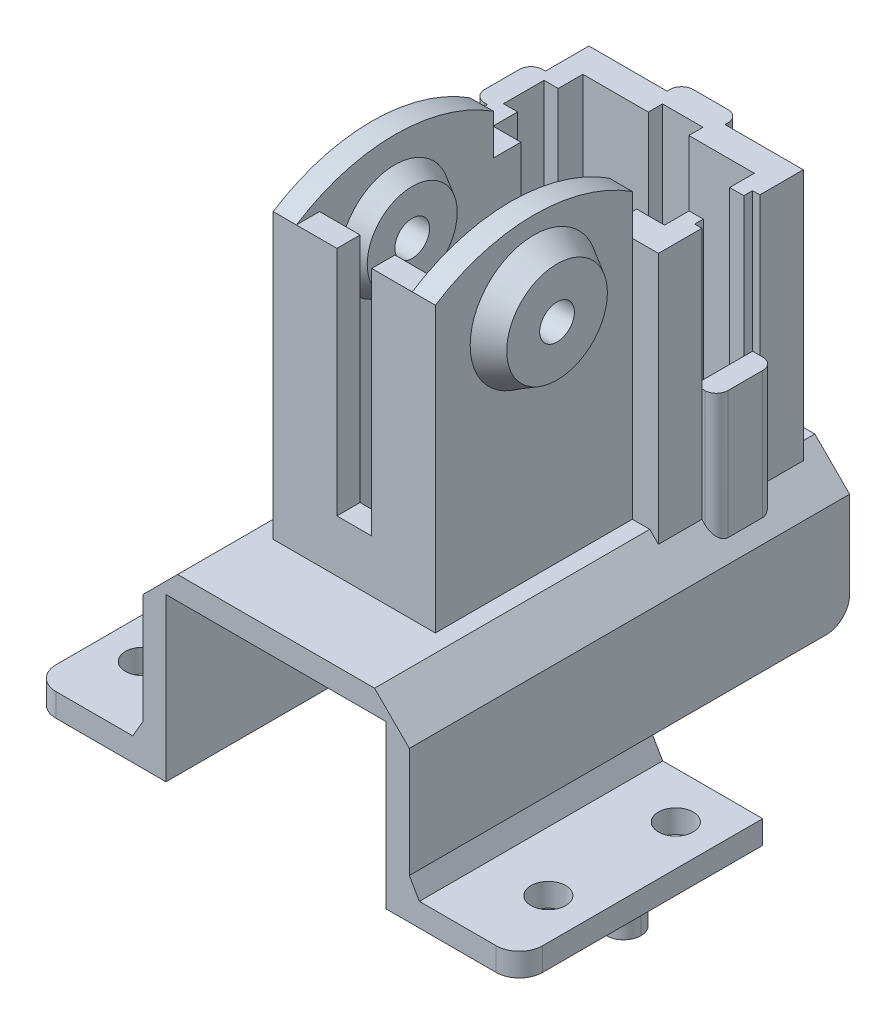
ISO-10303-21;
HEADER;
FILE_DESCRIPTION(('STEP AP214'),'2;1');
FILE_NAME('part.step','',(''),(''),'','','');
FILE_SCHEMA(('AUTOMOTIVE_DESIGN { 1 0 10303 214 1 1 1 1 }'));
ENDSEC;
DATA;
#1=APPLICATION_CONTEXT('core data for automotive mechanical design processes');
#2=APPLICATION_PROTOCOL_DEFINITION('international standard','automotive_design',2000,#1);
#3=PRODUCT_CONTEXT('',#1,'mechanical');
#4=PRODUCT('Part','Part','',(#3));
#5=PRODUCT_RELATED_PRODUCT_CATEGORY('part','',(#4));
#6=PRODUCT_DEFINITION_FORMATION('','',#4);
#7=PRODUCT_DEFINITION_CONTEXT('part definition',#1,'design');
#8=PRODUCT_DEFINITION('design','',#6,#7);
#9=PRODUCT_DEFINITION_SHAPE('','',#8);
#10=(LENGTH_UNIT() NAMED_UNIT(*) SI_UNIT(.MILLI.,.METRE.));
#11=(NAMED_UNIT(*) PLANE_ANGLE_UNIT() SI_UNIT($,.RADIAN.));
#12=(NAMED_UNIT(*) SI_UNIT($,.STERADIAN.) SOLID_ANGLE_UNIT());
#13=UNCERTAINTY_MEASURE_WITH_UNIT(LENGTH_MEASURE(1.E-05),#10,'distance_accuracy_value','');
#14=(GEOMETRIC_REPRESENTATION_CONTEXT(3) GLOBAL_UNCERTAINTY_ASSIGNED_CONTEXT((#13)) GLOBAL_UNIT_ASSIGNED_CONTEXT((#10,
#11,#12)) REPRESENTATION_CONTEXT('',''));
#15=CARTESIAN_POINT('',(0.,0.,0.));
#16=DIRECTION('',(0.,0.,1.));
#17=DIRECTION('',(1.,0.,0.));
#18=AXIS2_PLACEMENT_3D('',#15,#16,#17);
#19=CARTESIAN_POINT('',(9.5,0.,9.));
#20=DIRECTION('',(0.,-1.,0.));
#21=DIRECTION('',(1.,0.,0.));
#22=AXIS2_PLACEMENT_3D('',#19,#20,#21);
#23=PLANE('',#22);
#24=DIRECTION('',(0.,0.,1.));
#25=VECTOR('',#24,1.);
#26=CARTESIAN_POINT('',(21.,0.,9.));
#27=LINE('',#26,#25);
#28=CARTESIAN_POINT('',(21.,0.,9.));
#29=VERTEX_POINT('',#28);
#30=CARTESIAN_POINT('',(21.,0.,28.));
#31=VERTEX_POINT('',#30);
#32=EDGE_CURVE('E1392',#29,#31,#27,.T.);
#33=ORIENTED_EDGE('',*,*,#32,.T.);
#34=CARTESIAN_POINT('',(19.,0.,28.));
#35=DIRECTION('',(0.,-1.,0.));
#36=DIRECTION('',(1.,0.,0.));
#37=AXIS2_PLACEMENT_3D('',#34,#35,#36);
#38=CIRCLE('',#37,2.);
#39=CARTESIAN_POINT('',(19.,0.,30.));
#40=VERTEX_POINT('',#39);
#41=EDGE_CURVE('E1508',#31,#40,#38,.T.);
#42=ORIENTED_EDGE('',*,*,#41,.T.);
#43=DIRECTION('',(1.,0.,0.));
#44=VECTOR('',#43,1.);
#45=CARTESIAN_POINT('',(9.5,0.,30.));
#46=LINE('',#45,#44);
#47=CARTESIAN_POINT('',(9.5,0.,30.));
#48=VERTEX_POINT('',#47);
#49=EDGE_CURVE('E1354',#48,#40,#46,.T.);
#50=ORIENTED_EDGE('',*,*,#49,.F.);
#51=DIRECTION('',(0.,0.,1.));
#52=VECTOR('',#51,1.);
#53=CARTESIAN_POINT('',(9.5,0.,9.));
#54=LINE('',#53,#52);
#55=CARTESIAN_POINT('',(9.5,0.,9.));
#56=VERTEX_POINT('',#55);
#57=EDGE_CURVE('E1384',#56,#48,#54,.T.);
#58=ORIENTED_EDGE('',*,*,#57,.F.);
#59=DIRECTION('',(1.,0.,0.));
#60=VECTOR('',#59,1.);
#61=CARTESIAN_POINT('',(9.5,0.,9.));
#62=LINE('',#61,#60);
#63=EDGE_CURVE('E1372',#56,#29,#62,.T.);
#64=ORIENTED_EDGE('',*,*,#63,.T.);
#65=EDGE_LOOP('',(#33,#42,#50,#58,#64));
#66=FACE_BOUND('',#65,.T.);
#67=CARTESIAN_POINT('',(17.5,0.,24.));
#68=DIRECTION('',(0.,1.,0.));
#69=DIRECTION('',(-1.,0.,0.));
#70=AXIS2_PLACEMENT_3D('',#67,#68,#69);
#71=CIRCLE('',#70,1.50000000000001);
#72=CARTESIAN_POINT('',(15.9999999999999,0.,24.));
#73=VERTEX_POINT('',#72);
#74=EDGE_CURVE('E846',#73,#73,#71,.T.);
#75=ORIENTED_EDGE('',*,*,#74,.T.);
#76=EDGE_LOOP('',(#75));
#77=FACE_BOUND('',#76,.T.);
#78=CARTESIAN_POINT('',(17.4999999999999,0.,12.9999999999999));
#79=DIRECTION('',(0.,1.,0.));
#80=DIRECTION('',(-1.,0.,0.));
#81=AXIS2_PLACEMENT_3D('',#78,#79,#80);
#82=CIRCLE('',#81,1.5);
#83=CARTESIAN_POINT('',(15.9999999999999,0.,12.9999999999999));
#84=VERTEX_POINT('',#83);
#85=EDGE_CURVE('E840',#84,#84,#82,.T.);
#86=ORIENTED_EDGE('',*,*,#85,.T.);
#87=EDGE_LOOP('',(#86));
#88=FACE_BOUND('',#87,.T.);
#89=DIRECTION('',(0.,0.,1.));
#90=VECTOR('',#89,1.);
#91=CARTESIAN_POINT('',(15.,0.,20.));
#92=LINE('',#91,#90);
#93=CARTESIAN_POINT('',(15.,0.,20.));
#94=VERTEX_POINT('',#93);
#95=CARTESIAN_POINT('',(15.,0.,25.));
#96=VERTEX_POINT('',#95);
#97=EDGE_CURVE('E766',#94,#96,#92,.T.);
#98=ORIENTED_EDGE('',*,*,#97,.F.);
#99=DIRECTION('',(-1.,0.,0.));
#100=VECTOR('',#99,1.);
#101=CARTESIAN_POINT('',(20.,0.,20.));
#102=LINE('',#101,#100);
#103=CARTESIAN_POINT('',(18.5,0.,20.));
#104=VERTEX_POINT('',#103);
#105=EDGE_CURVE('E758',#104,#94,#102,.T.);
#106=ORIENTED_EDGE('',*,*,#105,.F.);
#107=CARTESIAN_POINT('',(18.5,0.,18.5));
#108=DIRECTION('',(0.,-1.,0.));
#109=DIRECTION('',(1.,0.,0.));
#110=AXIS2_PLACEMENT_3D('',#107,#108,#109);
#111=CIRCLE('',#110,1.5);
#112=CARTESIAN_POINT('',(20.,0.,18.5));
#113=VERTEX_POINT('',#112);
#114=EDGE_CURVE('E50',#104,#113,#111,.F.);
#115=ORIENTED_EDGE('',*,*,#114,.T.);
#116=CARTESIAN_POINT('',(18.5,0.,18.5));
#117=DIRECTION('',(0.,-1.,0.));
#118=DIRECTION('',(1.,0.,0.));
#119=AXIS2_PLACEMENT_3D('',#116,#117,#118);
#120=CIRCLE('',#119,1.5);
#121=CARTESIAN_POINT('',(18.5,0.,17.));
#122=VERTEX_POINT('',#121);
#123=EDGE_CURVE('E1678',#113,#122,#120,.F.);
#124=ORIENTED_EDGE('',*,*,#123,.T.);
#125=DIRECTION('',(1.,0.,0.));
#126=VECTOR('',#125,1.);
#127=CARTESIAN_POINT('',(15.,0.,17.0000000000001));
#128=LINE('',#127,#126);
#129=CARTESIAN_POINT('',(15.,0.,17.0000000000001));
#130=VERTEX_POINT('',#129);
#131=EDGE_CURVE('E790',#130,#122,#128,.T.);
#132=ORIENTED_EDGE('',*,*,#131,.F.);
#133=DIRECTION('',(0.,0.,1.));
#134=VECTOR('',#133,1.);
#135=CARTESIAN_POINT('',(15.,0.,10.5));
#136=LINE('',#135,#134);
#137=CARTESIAN_POINT('',(15.,0.,12.));
#138=VERTEX_POINT('',#137);
#139=EDGE_CURVE('E785',#138,#130,#136,.T.);
#140=ORIENTED_EDGE('',*,*,#139,.F.);
#141=CARTESIAN_POINT('',(13.5,0.,12.));
#142=DIRECTION('',(0.,-1.,0.));
#143=DIRECTION('',(1.,0.,0.));
#144=AXIS2_PLACEMENT_3D('',#141,#142,#143);
#145=CIRCLE('',#144,1.5);
#146=CARTESIAN_POINT('',(13.5,0.,10.5));
#147=VERTEX_POINT('',#146);
#148=EDGE_CURVE('E38',#138,#147,#145,.F.);
#149=ORIENTED_EDGE('',*,*,#148,.T.);
#150=CARTESIAN_POINT('',(13.5,0.,12.));
#151=DIRECTION('',(0.,-1.,0.));
#152=DIRECTION('',(1.,0.,0.));
#153=AXIS2_PLACEMENT_3D('',#150,#151,#152);
#154=CIRCLE('',#153,1.5);
#155=CARTESIAN_POINT('',(12.,0.,12.));
#156=VERTEX_POINT('',#155);
#157=EDGE_CURVE('E11',#147,#156,#154,.F.);
#158=ORIENTED_EDGE('',*,*,#157,.T.);
#159=DIRECTION('',(0.,0.,-1.));
#160=VECTOR('',#159,1.);
#161=CARTESIAN_POINT('',(12.,0.,26.5));
#162=LINE('',#161,#160);
#163=CARTESIAN_POINT('',(12.,0.,25.));
#164=VERTEX_POINT('',#163);
#165=EDGE_CURVE('E782',#164,#156,#162,.T.);
#166=ORIENTED_EDGE('',*,*,#165,.F.);
#167=CARTESIAN_POINT('',(13.5,0.,25.));
#168=DIRECTION('',(0.,-1.,0.));
#169=DIRECTION('',(1.,0.,0.));
#170=AXIS2_PLACEMENT_3D('',#167,#168,#169);
#171=CIRCLE('',#170,1.5);
#172=CARTESIAN_POINT('',(13.5,0.,26.5));
#173=VERTEX_POINT('',#172);
#174=EDGE_CURVE('E1675',#164,#173,#171,.F.);
#175=ORIENTED_EDGE('',*,*,#174,.T.);
#176=CARTESIAN_POINT('',(13.5,0.,25.));
#177=DIRECTION('',(0.,-1.,0.));
#178=DIRECTION('',(1.,0.,0.));
#179=AXIS2_PLACEMENT_3D('',#176,#177,#178);
#180=CIRCLE('',#179,1.5);
#181=EDGE_CURVE('E781',#173,#96,#180,.F.);
#182=ORIENTED_EDGE('',*,*,#181,.T.);
#183=EDGE_LOOP('',(#98,#106,#115,#124,#132,#140,#149,#158,#166,#175,#182));
#184=FACE_BOUND('',#183,.T.);
#185=ADVANCED_FACE('F30',(#66,#77,#88,#184),#23,.T.);
#186=CARTESIAN_POINT('',(-9.5,0.,9.));
#187=DIRECTION('',(0.,-1.,0.));
#188=DIRECTION('',(1.,0.,0.));
#189=AXIS2_PLACEMENT_3D('',#186,#187,#188);
#190=PLANE('',#189);
#191=CARTESIAN_POINT('',(-19.,0.,28.));
#192=DIRECTION('',(0.,-1.,0.));
#193=DIRECTION('',(1.,0.,0.));
#194=AXIS2_PLACEMENT_3D('',#191,#192,#193);
#195=CIRCLE('',#194,2.);
#196=CARTESIAN_POINT('',(-19.,0.,30.));
#197=VERTEX_POINT('',#196);
#198=CARTESIAN_POINT('',(-21.,0.,28.));
#199=VERTEX_POINT('',#198);
#200=EDGE_CURVE('E1496',#197,#199,#195,.T.);
#201=ORIENTED_EDGE('',*,*,#200,.T.);
#202=DIRECTION('',(0.,0.,1.));
#203=VECTOR('',#202,1.);
#204=CARTESIAN_POINT('',(-21.,0.,9.));
#205=LINE('',#204,#203);
#206=CARTESIAN_POINT('',(-21.,0.,9.));
#207=VERTEX_POINT('',#206);
#208=EDGE_CURVE('E1355',#207,#199,#205,.T.);
#209=ORIENTED_EDGE('',*,*,#208,.F.);
#210=DIRECTION('',(1.,0.,0.));
#211=VECTOR('',#210,1.);
#212=CARTESIAN_POINT('',(-9.5,0.,9.));
#213=LINE('',#212,#211);
#214=CARTESIAN_POINT('',(-9.5,0.,9.));
#215=VERTEX_POINT('',#214);
#216=EDGE_CURVE('E1342',#207,#215,#213,.T.);
#217=ORIENTED_EDGE('',*,*,#216,.T.);
#218=DIRECTION('',(0.,0.,1.));
#219=VECTOR('',#218,1.);
#220=CARTESIAN_POINT('',(-9.5,0.,9.));
#221=LINE('',#220,#219);
#222=CARTESIAN_POINT('',(-9.5,0.,30.));
#223=VERTEX_POINT('',#222);
#224=EDGE_CURVE('E1351',#215,#223,#221,.T.);
#225=ORIENTED_EDGE('',*,*,#224,.T.);
#226=DIRECTION('',(1.,0.,0.));
#227=VECTOR('',#226,1.);
#228=CARTESIAN_POINT('',(-9.5,0.,30.));
#229=LINE('',#228,#227);
#230=EDGE_CURVE('E1331',#197,#223,#229,.T.);
#231=ORIENTED_EDGE('',*,*,#230,.F.);
#232=EDGE_LOOP('',(#201,#209,#217,#225,#231));
#233=FACE_BOUND('',#232,.T.);
#234=CARTESIAN_POINT('',(-17.5000000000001,0.,13.));
#235=DIRECTION('',(0.,1.,0.));
#236=DIRECTION('',(-1.,0.,0.));
#237=AXIS2_PLACEMENT_3D('',#234,#235,#236);
#238=CIRCLE('',#237,1.49999999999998);
#239=CARTESIAN_POINT('',(-19.,0.,13.));
#240=VERTEX_POINT('',#239);
#241=EDGE_CURVE('E858',#240,#240,#238,.T.);
#242=ORIENTED_EDGE('',*,*,#241,.T.);
#243=EDGE_LOOP('',(#242));
#244=FACE_BOUND('',#243,.T.);
#245=CARTESIAN_POINT('',(-17.5,0.,24.));
#246=DIRECTION('',(0.,1.,0.));
#247=DIRECTION('',(-1.,0.,0.));
#248=AXIS2_PLACEMENT_3D('',#245,#246,#247);
#249=CIRCLE('',#248,1.49999999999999);
#250=CARTESIAN_POINT('',(-19.,0.,24.));
#251=VERTEX_POINT('',#250);
#252=EDGE_CURVE('E852',#251,#251,#249,.T.);
#253=ORIENTED_EDGE('',*,*,#252,.T.);
#254=EDGE_LOOP('',(#253));
#255=FACE_BOUND('',#254,.T.);
#256=CARTESIAN_POINT('',(-13.5,0.,25.));
#257=DIRECTION('',(0.,-1.,0.));
#258=DIRECTION('',(1.,0.,0.));
#259=AXIS2_PLACEMENT_3D('',#256,#257,#258);
#260=CIRCLE('',#259,1.5);
#261=CARTESIAN_POINT('',(-15.,0.,25.));
#262=VERTEX_POINT('',#261);
#263=CARTESIAN_POINT('',(-13.5,0.,26.5));
#264=VERTEX_POINT('',#263);
#265=EDGE_CURVE('E1670',#262,#264,#260,.F.);
#266=ORIENTED_EDGE('',*,*,#265,.T.);
#267=CARTESIAN_POINT('',(-13.5,0.,25.));
#268=DIRECTION('',(0.,-1.,0.));
#269=DIRECTION('',(1.,0.,0.));
#270=AXIS2_PLACEMENT_3D('',#267,#268,#269);
#271=CIRCLE('',#270,1.5);
#272=CARTESIAN_POINT('',(-12.,0.,25.));
#273=VERTEX_POINT('',#272);
#274=EDGE_CURVE('E1672',#264,#273,#271,.F.);
#275=ORIENTED_EDGE('',*,*,#274,.T.);
#276=DIRECTION('',(0.,0.,1.));
#277=VECTOR('',#276,1.);
#278=CARTESIAN_POINT('',(-12.,0.,26.5));
#279=LINE('',#278,#277);
#280=CARTESIAN_POINT('',(-12.,0.,12.));
#281=VERTEX_POINT('',#280);
#282=EDGE_CURVE('E777',#281,#273,#279,.T.);
#283=ORIENTED_EDGE('',*,*,#282,.F.);
#284=CARTESIAN_POINT('',(-13.5,0.,12.));
#285=DIRECTION('',(0.,-1.,0.));
#286=DIRECTION('',(1.,0.,0.));
#287=AXIS2_PLACEMENT_3D('',#284,#285,#286);
#288=CIRCLE('',#287,1.5);
#289=CARTESIAN_POINT('',(-13.5,0.,10.5));
#290=VERTEX_POINT('',#289);
#291=EDGE_CURVE('E1664',#281,#290,#288,.F.);
#292=ORIENTED_EDGE('',*,*,#291,.T.);
#293=CARTESIAN_POINT('',(-13.5,0.,12.));
#294=DIRECTION('',(0.,-1.,0.));
#295=DIRECTION('',(1.,0.,0.));
#296=AXIS2_PLACEMENT_3D('',#293,#294,#295);
#297=CIRCLE('',#296,1.5);
#298=CARTESIAN_POINT('',(-15.,0.,12.));
#299=VERTEX_POINT('',#298);
#300=EDGE_CURVE('E1662',#290,#299,#297,.F.);
#301=ORIENTED_EDGE('',*,*,#300,.T.);
#302=DIRECTION('',(0.,0.,-1.));
#303=VECTOR('',#302,1.);
#304=CARTESIAN_POINT('',(-15.,0.,10.5));
#305=LINE('',#304,#303);
#306=CARTESIAN_POINT('',(-15.,0.,17.0000000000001));
#307=VERTEX_POINT('',#306);
#308=EDGE_CURVE('E815',#307,#299,#305,.T.);
#309=ORIENTED_EDGE('',*,*,#308,.F.);
#310=DIRECTION('',(1.,0.,0.));
#311=VECTOR('',#310,1.);
#312=CARTESIAN_POINT('',(-15.,0.,17.0000000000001));
#313=LINE('',#312,#311);
#314=CARTESIAN_POINT('',(-18.5,0.,17.));
#315=VERTEX_POINT('',#314);
#316=EDGE_CURVE('E813',#315,#307,#313,.T.);
#317=ORIENTED_EDGE('',*,*,#316,.F.);
#318=CARTESIAN_POINT('',(-18.5,0.,18.5));
#319=DIRECTION('',(0.,-1.,0.));
#320=DIRECTION('',(1.,0.,0.));
#321=AXIS2_PLACEMENT_3D('',#318,#319,#320);
#322=CIRCLE('',#321,1.5);
#323=CARTESIAN_POINT('',(-20.,0.,18.5000000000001));
#324=VERTEX_POINT('',#323);
#325=EDGE_CURVE('E1666',#315,#324,#322,.F.);
#326=ORIENTED_EDGE('',*,*,#325,.T.);
#327=CARTESIAN_POINT('',(-18.5,0.,18.5));
#328=DIRECTION('',(0.,-1.,0.));
#329=DIRECTION('',(1.,0.,0.));
#330=AXIS2_PLACEMENT_3D('',#327,#328,#329);
#331=CIRCLE('',#330,1.5);
#332=CARTESIAN_POINT('',(-18.5,0.,20.));
#333=VERTEX_POINT('',#332);
#334=EDGE_CURVE('E1668',#324,#333,#331,.F.);
#335=ORIENTED_EDGE('',*,*,#334,.T.);
#336=DIRECTION('',(-1.,0.,0.));
#337=VECTOR('',#336,1.);
#338=CARTESIAN_POINT('',(-20.,0.,20.));
#339=LINE('',#338,#337);
#340=CARTESIAN_POINT('',(-15.,0.,20.));
#341=VERTEX_POINT('',#340);
#342=EDGE_CURVE('E810',#341,#333,#339,.T.);
#343=ORIENTED_EDGE('',*,*,#342,.F.);
#344=DIRECTION('',(0.,0.,-1.));
#345=VECTOR('',#344,1.);
#346=CARTESIAN_POINT('',(-15.,0.,20.));
#347=LINE('',#346,#345);
#348=EDGE_CURVE('E808',#262,#341,#347,.T.);
#349=ORIENTED_EDGE('',*,*,#348,.F.);
#350=EDGE_LOOP('',(#266,#275,#283,#292,#301,#309,#317,#326,#335,#343,#349));
#351=FACE_BOUND('',#350,.T.);
#352=ADVANCED_FACE('F1751',(#233,#244,#255,#351),#190,.T.);
#353=CARTESIAN_POINT('',(9.5,14.,30.));
#354=DIRECTION('',(1.,0.,0.));
#355=DIRECTION('',(0.,1.,0.));
#356=AXIS2_PLACEMENT_3D('',#353,#354,#355);
#357=PLANE('',#356);
#358=DIRECTION('',(0.,1.,0.));
#359=VECTOR('',#358,1.);
#360=CARTESIAN_POINT('',(9.5,14.,4.24999999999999));
#361=LINE('',#360,#359);
#362=CARTESIAN_POINT('',(9.5,11.,4.24999999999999));
#363=VERTEX_POINT('',#362);
#364=CARTESIAN_POINT('',(9.5,14.,4.24999999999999));
#365=VERTEX_POINT('',#364);
#366=EDGE_CURVE('E876',#363,#365,#361,.T.);
#367=ORIENTED_EDGE('',*,*,#366,.T.);
#368=DIRECTION('',(0.,0.,-1.));
#369=VECTOR('',#368,1.);
#370=CARTESIAN_POINT('',(9.5,14.,30.));
#371=LINE('',#370,#369);
#372=CARTESIAN_POINT('',(9.5,14.,-8.));
#373=VERTEX_POINT('',#372);
#374=EDGE_CURVE('E1428',#365,#373,#371,.T.);
#375=ORIENTED_EDGE('',*,*,#374,.T.);
#376=DIRECTION('',(0.,-1.,0.));
#377=VECTOR('',#376,1.);
#378=CARTESIAN_POINT('',(9.5,14.,-8.));
#379=LINE('',#378,#377);
#380=CARTESIAN_POINT('',(9.5,5.5,-8.));
#381=VERTEX_POINT('',#380);
#382=EDGE_CURVE('E1388',#373,#381,#379,.T.);
#383=ORIENTED_EDGE('',*,*,#382,.T.);
#384=CARTESIAN_POINT('',(9.5,5.5,-6.));
#385=DIRECTION('',(1.,0.,0.));
#386=DIRECTION('',(0.,1.,0.));
#387=AXIS2_PLACEMENT_3D('',#384,#385,#386);
#388=CIRCLE('',#387,2.);
#389=CARTESIAN_POINT('',(9.5,3.5,-6.));
#390=VERTEX_POINT('',#389);
#391=EDGE_CURVE('E1488',#381,#390,#388,.F.);
#392=ORIENTED_EDGE('',*,*,#391,.T.);
#393=DIRECTION('',(0.,0.,-1.));
#394=VECTOR('',#393,1.);
#395=CARTESIAN_POINT('',(9.5,3.5,30.));
#396=LINE('',#395,#394);
#397=CARTESIAN_POINT('',(9.50000000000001,3.5,9.));
#398=VERTEX_POINT('',#397);
#399=EDGE_CURVE('E1448',#398,#390,#396,.T.);
#400=ORIENTED_EDGE('',*,*,#399,.F.);
#401=DIRECTION('',(0.,-1.,0.));
#402=VECTOR('',#401,1.);
#403=CARTESIAN_POINT('',(9.50000000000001,3.5,9.));
#404=LINE('',#403,#402);
#405=EDGE_CURVE('E1369',#398,#56,#404,.T.);
#406=ORIENTED_EDGE('',*,*,#405,.T.);
#407=ORIENTED_EDGE('',*,*,#57,.T.);
#408=DIRECTION('',(0.,-1.,0.));
#409=VECTOR('',#408,1.);
#410=CARTESIAN_POINT('',(9.5,14.,30.));
#411=LINE('',#410,#409);
#412=CARTESIAN_POINT('',(9.5,14.,30.));
#413=VERTEX_POINT('',#412);
#414=EDGE_CURVE('E1413',#413,#48,#411,.T.);
#415=ORIENTED_EDGE('',*,*,#414,.F.);
#416=CARTESIAN_POINT('',(9.5,14.,23.25));
#417=VERTEX_POINT('',#416);
#418=EDGE_CURVE('E1429',#413,#417,#371,.T.);
#419=ORIENTED_EDGE('',*,*,#418,.T.);
#420=DIRECTION('',(0.,1.,0.));
#421=VECTOR('',#420,1.);
#422=CARTESIAN_POINT('',(9.5,14.,23.25));
#423=LINE('',#422,#421);
#424=CARTESIAN_POINT('',(9.5,9.,23.25));
#425=VERTEX_POINT('',#424);
#426=EDGE_CURVE('E902',#425,#417,#423,.T.);
#427=ORIENTED_EDGE('',*,*,#426,.F.);
#428=DIRECTION('',(0.,0.,1.));
#429=VECTOR('',#428,1.);
#430=CARTESIAN_POINT('',(9.5,9.,30.));
#431=LINE('',#430,#429);
#432=CARTESIAN_POINT('',(9.5,9.,21.25));
#433=VERTEX_POINT('',#432);
#434=EDGE_CURVE('E890',#433,#425,#431,.T.);
#435=ORIENTED_EDGE('',*,*,#434,.F.);
#436=DIRECTION('',(0.,1.,0.));
#437=VECTOR('',#436,1.);
#438=CARTESIAN_POINT('',(9.5,14.,21.25));
#439=LINE('',#438,#437);
#440=CARTESIAN_POINT('',(9.5,14.,21.25));
#441=VERTEX_POINT('',#440);
#442=EDGE_CURVE('E882',#433,#441,#439,.T.);
#443=ORIENTED_EDGE('',*,*,#442,.T.);
#444=CARTESIAN_POINT('',(9.5,14.,6.24999999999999));
#445=VERTEX_POINT('',#444);
#446=EDGE_CURVE('E1433',#441,#445,#371,.T.);
#447=ORIENTED_EDGE('',*,*,#446,.T.);
#448=DIRECTION('',(0.,1.,0.));
#449=VECTOR('',#448,1.);
#450=CARTESIAN_POINT('',(9.5,14.,6.24999999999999));
#451=LINE('',#450,#449);
#452=CARTESIAN_POINT('',(9.5,11.,6.24999999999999));
#453=VERTEX_POINT('',#452);
#454=EDGE_CURVE('E864',#453,#445,#451,.T.);
#455=ORIENTED_EDGE('',*,*,#454,.F.);
#456=DIRECTION('',(0.,0.,1.));
#457=VECTOR('',#456,1.);
#458=CARTESIAN_POINT('',(9.5,11.,30.));
#459=LINE('',#458,#457);
#460=EDGE_CURVE('E868',#363,#453,#459,.T.);
#461=ORIENTED_EDGE('',*,*,#460,.F.);
#462=EDGE_LOOP('',(#367,#375,#383,#392,#400,#406,#407,#415,#419,#427,#435,#443,#447,#455,#461));
#463=FACE_BOUND('',#462,.T.);
#464=ADVANCED_FACE('F32',(#463),#357,.F.);
#465=CARTESIAN_POINT('',(-9.5,14.,30.));
#466=DIRECTION('',(0.,1.,0.));
#467=DIRECTION('',(0.,0.,1.));
#468=AXIS2_PLACEMENT_3D('',#465,#466,#467);
#469=PLANE('',#468);
#470=DIRECTION('',(1.,0.,0.));
#471=VECTOR('',#470,1.);
#472=CARTESIAN_POINT('',(-9.5,14.,3.87499999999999));
#473=LINE('',#472,#471);
#474=CARTESIAN_POINT('',(5.,14.,3.87499999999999));
#475=VERTEX_POINT('',#474);
#476=CARTESIAN_POINT('',(7.4,14.,3.87499999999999));
#477=VERTEX_POINT('',#476);
#478=EDGE_CURVE('E1107',#475,#477,#473,.T.);
#479=ORIENTED_EDGE('',*,*,#478,.T.);
#480=DIRECTION('',(0.,0.,-1.));
#481=VECTOR('',#480,1.);
#482=CARTESIAN_POINT('',(7.39999999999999,14.,30.));
#483=LINE('',#482,#481);
#484=CARTESIAN_POINT('',(7.4,14.,1.75));
#485=VERTEX_POINT('',#484);
#486=EDGE_CURVE('E1110',#477,#485,#483,.T.);
#487=ORIENTED_EDGE('',*,*,#486,.T.);
#488=DIRECTION('',(1.,0.,0.));
#489=VECTOR('',#488,1.);
#490=CARTESIAN_POINT('',(-9.49999999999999,14.,1.74999999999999));
#491=LINE('',#490,#489);
#492=CARTESIAN_POINT('',(8.625,14.,1.75));
#493=VERTEX_POINT('',#492);
#494=EDGE_CURVE('E1068',#485,#493,#491,.T.);
#495=ORIENTED_EDGE('',*,*,#494,.T.);
#496=DIRECTION('',(0.,0.,-1.));
#497=VECTOR('',#496,1.);
#498=CARTESIAN_POINT('',(8.625,14.,30.));
#499=LINE('',#498,#497);
#500=CARTESIAN_POINT('',(8.625,14.,-1.75000000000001));
#501=VERTEX_POINT('',#500);
#502=EDGE_CURVE('E1113',#493,#501,#499,.T.);
#503=ORIENTED_EDGE('',*,*,#502,.T.);
#504=DIRECTION('',(-1.,0.,0.));
#505=VECTOR('',#504,1.);
#506=CARTESIAN_POINT('',(-9.50000000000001,14.,-1.75000000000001));
#507=LINE('',#506,#505);
#508=CARTESIAN_POINT('',(7.4,14.,-1.75000000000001));
#509=VERTEX_POINT('',#508);
#510=EDGE_CURVE('E1071',#501,#509,#507,.T.);
#511=ORIENTED_EDGE('',*,*,#510,.T.);
#512=DIRECTION('',(0.,0.,-1.));
#513=VECTOR('',#512,1.);
#514=CARTESIAN_POINT('',(7.40000000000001,14.,30.));
#515=LINE('',#514,#513);
#516=CARTESIAN_POINT('',(7.4,14.,-3.875));
#517=VERTEX_POINT('',#516);
#518=EDGE_CURVE('E1074',#509,#517,#515,.T.);
#519=ORIENTED_EDGE('',*,*,#518,.T.);
#520=DIRECTION('',(-1.,0.,0.));
#521=VECTOR('',#520,1.);
#522=CARTESIAN_POINT('',(-9.5,14.,-3.875));
#523=LINE('',#522,#521);
#524=CARTESIAN_POINT('',(1.75,14.,-3.875));
#525=VERTEX_POINT('',#524);
#526=EDGE_CURVE('E1077',#517,#525,#523,.T.);
#527=ORIENTED_EDGE('',*,*,#526,.T.);
#528=DIRECTION('',(0.,0.,-1.));
#529=VECTOR('',#528,1.);
#530=CARTESIAN_POINT('',(1.75000000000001,14.,30.));
#531=LINE('',#530,#529);
#532=CARTESIAN_POINT('',(1.75,14.,-5.1));
#533=VERTEX_POINT('',#532);
#534=EDGE_CURVE('E1080',#525,#533,#531,.T.);
#535=ORIENTED_EDGE('',*,*,#534,.T.);
#536=DIRECTION('',(-1.,0.,0.));
#537=VECTOR('',#536,1.);
#538=CARTESIAN_POINT('',(-9.5,14.,-5.1));
#539=LINE('',#538,#537);
#540=CARTESIAN_POINT('',(-1.75,14.,-5.1));
#541=VERTEX_POINT('',#540);
#542=EDGE_CURVE('E1083',#533,#541,#539,.T.);
#543=ORIENTED_EDGE('',*,*,#542,.T.);
#544=DIRECTION('',(0.,0.,1.));
#545=VECTOR('',#544,1.);
#546=CARTESIAN_POINT('',(-1.75000000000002,14.,30.));
#547=LINE('',#546,#545);
#548=CARTESIAN_POINT('',(-1.75,14.,-3.875));
#549=VERTEX_POINT('',#548);
#550=EDGE_CURVE('E1086',#541,#549,#547,.T.);
#551=ORIENTED_EDGE('',*,*,#550,.T.);
#552=DIRECTION('',(-1.,0.,0.));
#553=VECTOR('',#552,1.);
#554=CARTESIAN_POINT('',(-9.5,14.,-3.875));
#555=LINE('',#554,#553);
#556=CARTESIAN_POINT('',(-7.4,14.,-3.875));
#557=VERTEX_POINT('',#556);
#558=EDGE_CURVE('E1089',#549,#557,#555,.T.);
#559=ORIENTED_EDGE('',*,*,#558,.T.);
#560=DIRECTION('',(0.,0.,1.));
#561=VECTOR('',#560,1.);
#562=CARTESIAN_POINT('',(-7.40000000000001,14.,30.));
#563=LINE('',#562,#561);
#564=CARTESIAN_POINT('',(-7.4,14.,-1.75000000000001));
#565=VERTEX_POINT('',#564);
#566=EDGE_CURVE('E1092',#557,#565,#563,.T.);
#567=ORIENTED_EDGE('',*,*,#566,.T.);
#568=DIRECTION('',(-1.,0.,0.));
#569=VECTOR('',#568,1.);
#570=CARTESIAN_POINT('',(-9.49999999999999,14.,-1.75000000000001));
#571=LINE('',#570,#569);
#572=CARTESIAN_POINT('',(-8.625,14.,-1.75000000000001));
#573=VERTEX_POINT('',#572);
#574=EDGE_CURVE('E1095',#565,#573,#571,.T.);
#575=ORIENTED_EDGE('',*,*,#574,.T.);
#576=DIRECTION('',(0.,0.,1.));
#577=VECTOR('',#576,1.);
#578=CARTESIAN_POINT('',(-8.625,14.,30.));
#579=LINE('',#578,#577);
#580=CARTESIAN_POINT('',(-8.625,14.,1.75));
#581=VERTEX_POINT('',#580);
#582=EDGE_CURVE('E1116',#573,#581,#579,.T.);
#583=ORIENTED_EDGE('',*,*,#582,.T.);
#584=DIRECTION('',(1.,0.,0.));
#585=VECTOR('',#584,1.);
#586=CARTESIAN_POINT('',(-9.50000000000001,14.,1.75));
#587=LINE('',#586,#585);
#588=CARTESIAN_POINT('',(-7.4,14.,1.75));
#589=VERTEX_POINT('',#588);
#590=EDGE_CURVE('E1098',#581,#589,#587,.T.);
#591=ORIENTED_EDGE('',*,*,#590,.T.);
#592=DIRECTION('',(0.,0.,1.));
#593=VECTOR('',#592,1.);
#594=CARTESIAN_POINT('',(-7.39999999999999,14.,30.));
#595=LINE('',#594,#593);
#596=CARTESIAN_POINT('',(-7.4,14.,3.87499999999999));
#597=VERTEX_POINT('',#596);
#598=EDGE_CURVE('E1101',#589,#597,#595,.T.);
#599=ORIENTED_EDGE('',*,*,#598,.T.);
#600=DIRECTION('',(1.,0.,0.));
#601=VECTOR('',#600,1.);
#602=CARTESIAN_POINT('',(-9.50000000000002,14.,3.87499999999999));
#603=LINE('',#602,#601);
#604=CARTESIAN_POINT('',(-5.,14.,3.87499999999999));
#605=VERTEX_POINT('',#604);
#606=EDGE_CURVE('E1104',#597,#605,#603,.T.);
#607=ORIENTED_EDGE('',*,*,#606,.T.);
#608=DIRECTION('',(0.,0.,1.));
#609=VECTOR('',#608,1.);
#610=CARTESIAN_POINT('',(-5.,14.,30.));
#611=LINE('',#610,#609);
#612=CARTESIAN_POINT('',(-5.,14.,16.125));
#613=VERTEX_POINT('',#612);
#614=EDGE_CURVE('E1065',#605,#613,#611,.T.);
#615=ORIENTED_EDGE('',*,*,#614,.T.);
#616=DIRECTION('',(1.,0.,0.));
#617=VECTOR('',#616,1.);
#618=CARTESIAN_POINT('',(-9.5,14.,16.125));
#619=LINE('',#618,#617);
#620=CARTESIAN_POINT('',(5.,14.,16.125));
#621=VERTEX_POINT('',#620);
#622=EDGE_CURVE('E1046',#613,#621,#619,.T.);
#623=ORIENTED_EDGE('',*,*,#622,.T.);
#624=DIRECTION('',(0.,0.,-1.));
#625=VECTOR('',#624,1.);
#626=CARTESIAN_POINT('',(5.,14.,30.));
#627=LINE('',#626,#625);
#628=EDGE_CURVE('E1060',#621,#475,#627,.T.);
#629=ORIENTED_EDGE('',*,*,#628,.T.);
#630=EDGE_LOOP('',(#479,#487,#495,#503,#511,#519,#527,#535,#543,#551,#559,#567,#575,#583,#591,
#599,#607,#615,#623,#629));
#631=FACE_BOUND('',#630,.T.);
#632=DIRECTION('',(-1.,0.,0.));
#633=VECTOR('',#632,1.);
#634=CARTESIAN_POINT('',(9.5,14.,4.24999999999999));
#635=LINE('',#634,#633);
#636=CARTESIAN_POINT('',(6.5,14.,4.24999999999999));
#637=VERTEX_POINT('',#636);
#638=EDGE_CURVE('E879',#365,#637,#635,.T.);
#639=ORIENTED_EDGE('',*,*,#638,.T.);
#640=DIRECTION('',(0.,0.,-1.));
#641=VECTOR('',#640,1.);
#642=CARTESIAN_POINT('',(6.5,14.,30.));
#643=LINE('',#642,#641);
#644=CARTESIAN_POINT('',(6.5,14.,6.24999999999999));
#645=VERTEX_POINT('',#644);
#646=EDGE_CURVE('E873',#645,#637,#643,.T.);
#647=ORIENTED_EDGE('',*,*,#646,.F.);
#648=DIRECTION('',(-1.,0.,0.));
#649=VECTOR('',#648,1.);
#650=CARTESIAN_POINT('',(9.5,14.,6.24999999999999));
#651=LINE('',#650,#649);
#652=EDGE_CURVE('E861',#445,#645,#651,.T.);
#653=ORIENTED_EDGE('',*,*,#652,.F.);
#654=ORIENTED_EDGE('',*,*,#446,.F.);
#655=DIRECTION('',(-1.,0.,0.));
#656=VECTOR('',#655,1.);
#657=CARTESIAN_POINT('',(9.5,14.,21.25));
#658=LINE('',#657,#656);
#659=CARTESIAN_POINT('',(4.5,14.,21.25));
#660=VERTEX_POINT('',#659);
#661=EDGE_CURVE('E888',#441,#660,#658,.T.);
#662=ORIENTED_EDGE('',*,*,#661,.T.);
#663=DIRECTION('',(0.,0.,-1.));
#664=VECTOR('',#663,1.);
#665=CARTESIAN_POINT('',(4.5,14.,30.));
#666=LINE('',#665,#664);
#667=CARTESIAN_POINT('',(4.5,14.,23.25));
#668=VERTEX_POINT('',#667);
#669=EDGE_CURVE('E893',#668,#660,#666,.T.);
#670=ORIENTED_EDGE('',*,*,#669,.F.);
#671=DIRECTION('',(-1.,0.,0.));
#672=VECTOR('',#671,1.);
#673=CARTESIAN_POINT('',(9.5,14.,23.25));
#674=LINE('',#673,#672);
#675=EDGE_CURVE('E899',#417,#668,#674,.T.);
#676=ORIENTED_EDGE('',*,*,#675,.F.);
#677=ORIENTED_EDGE('',*,*,#418,.F.);
#678=DIRECTION('',(1.,0.,0.));
#679=VECTOR('',#678,1.);
#680=CARTESIAN_POINT('',(-9.5,14.,30.));
#681=LINE('',#680,#679);
#682=CARTESIAN_POINT('',(-9.5,14.,30.));
#683=VERTEX_POINT('',#682);
#684=EDGE_CURVE('E1426',#683,#413,#681,.T.);
#685=ORIENTED_EDGE('',*,*,#684,.F.);
#686=DIRECTION('',(0.,0.,-1.));
#687=VECTOR('',#686,1.);
#688=CARTESIAN_POINT('',(-9.5,14.,30.));
#689=LINE('',#688,#687);
#690=CARTESIAN_POINT('',(-9.5,14.,23.25));
#691=VERTEX_POINT('',#690);
#692=EDGE_CURVE('E1434',#683,#691,#689,.T.);
#693=ORIENTED_EDGE('',*,*,#692,.T.);
#694=DIRECTION('',(1.,0.,0.));
#695=VECTOR('',#694,1.);
#696=CARTESIAN_POINT('',(-9.5,14.,23.25));
#697=LINE('',#696,#695);
#698=CARTESIAN_POINT('',(-4.5,14.,23.25));
#699=VERTEX_POINT('',#698);
#700=EDGE_CURVE('E937',#691,#699,#697,.T.);
#701=ORIENTED_EDGE('',*,*,#700,.T.);
#702=DIRECTION('',(0.,0.,-1.));
#703=VECTOR('',#702,1.);
#704=CARTESIAN_POINT('',(-4.5,14.,30.));
#705=LINE('',#704,#703);
#706=CARTESIAN_POINT('',(-4.5,14.,21.25));
#707=VERTEX_POINT('',#706);
#708=EDGE_CURVE('E941',#699,#707,#705,.T.);
#709=ORIENTED_EDGE('',*,*,#708,.T.);
#710=DIRECTION('',(1.,0.,0.));
#711=VECTOR('',#710,1.);
#712=CARTESIAN_POINT('',(-9.5,14.,21.25));
#713=LINE('',#712,#711);
#714=CARTESIAN_POINT('',(-9.5,14.,21.25));
#715=VERTEX_POINT('',#714);
#716=EDGE_CURVE('E931',#715,#707,#713,.T.);
#717=ORIENTED_EDGE('',*,*,#716,.F.);
#718=CARTESIAN_POINT('',(-9.5,14.,6.24999999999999));
#719=VERTEX_POINT('',#718);
#720=EDGE_CURVE('E1438',#715,#719,#689,.T.);
#721=ORIENTED_EDGE('',*,*,#720,.T.);
#722=DIRECTION('',(1.,0.,0.));
#723=VECTOR('',#722,1.);
#724=CARTESIAN_POINT('',(-9.5,14.,6.24999999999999));
#725=LINE('',#724,#723);
#726=CARTESIAN_POINT('',(-6.5,14.,6.24999999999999));
#727=VERTEX_POINT('',#726);
#728=EDGE_CURVE('E911',#719,#727,#725,.T.);
#729=ORIENTED_EDGE('',*,*,#728,.T.);
#730=DIRECTION('',(0.,0.,-1.));
#731=VECTOR('',#730,1.);
#732=CARTESIAN_POINT('',(-6.5,14.,30.));
#733=LINE('',#732,#731);
#734=CARTESIAN_POINT('',(-6.5,14.,4.24999999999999));
#735=VERTEX_POINT('',#734);
#736=EDGE_CURVE('E921',#727,#735,#733,.T.);
#737=ORIENTED_EDGE('',*,*,#736,.T.);
#738=DIRECTION('',(1.,0.,0.));
#739=VECTOR('',#738,1.);
#740=CARTESIAN_POINT('',(-9.5,14.,4.24999999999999));
#741=LINE('',#740,#739);
#742=CARTESIAN_POINT('',(-9.5,14.,4.24999999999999));
#743=VERTEX_POINT('',#742);
#744=EDGE_CURVE('E915',#743,#735,#741,.T.);
#745=ORIENTED_EDGE('',*,*,#744,.F.);
#746=CARTESIAN_POINT('',(-9.5,14.,-8.));
#747=VERTEX_POINT('',#746);
#748=EDGE_CURVE('E1432',#743,#747,#689,.T.);
#749=ORIENTED_EDGE('',*,*,#748,.T.);
#750=DIRECTION('',(1.,0.,0.));
#751=VECTOR('',#750,1.);
#752=CARTESIAN_POINT('',(-9.5,14.,-8.));
#753=LINE('',#752,#751);
#754=EDGE_CURVE('E1410',#747,#373,#753,.T.);
#755=ORIENTED_EDGE('',*,*,#754,.T.);
#756=ORIENTED_EDGE('',*,*,#374,.F.);
#757=EDGE_LOOP('',(#639,#647,#653,#654,#662,#670,#676,#677,#685,#693,#701,#709,#717,#721,#729,
#737,#745,#749,#755,#756));
#758=FACE_BOUND('',#757,.T.);
#759=ADVANCED_FACE('F1815',(#631,#758),#469,.F.);
#760=CARTESIAN_POINT('',(9.25,37.,6.24999999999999));
#761=DIRECTION('',(0.,1.,0.));
#762=DIRECTION('',(0.,0.,1.));
#763=AXIS2_PLACEMENT_3D('',#760,#761,#762);
#764=PLANE('',#763);
#765=DIRECTION('',(0.,0.,-1.));
#766=VECTOR('',#765,1.);
#767=CARTESIAN_POINT('',(9.25,37.,6.24999999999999));
#768=LINE('',#767,#766);
#769=CARTESIAN_POINT('',(9.25,37.,6.24999999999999));
#770=VERTEX_POINT('',#769);
#771=CARTESIAN_POINT('',(9.25,37.,2.49999999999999));
#772=VERTEX_POINT('',#771);
#773=EDGE_CURVE('E1247',#770,#772,#768,.T.);
#774=ORIENTED_EDGE('',*,*,#773,.T.);
#775=DIRECTION('',(1.,0.,0.));
#776=VECTOR('',#775,1.);
#777=CARTESIAN_POINT('',(8.625,37.,2.49999999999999));
#778=LINE('',#777,#776);
#779=CARTESIAN_POINT('',(8.625,37.,2.49999999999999));
#780=VERTEX_POINT('',#779);
#781=EDGE_CURVE('E950',#780,#772,#778,.T.);
#782=ORIENTED_EDGE('',*,*,#781,.F.);
#783=DIRECTION('',(0.,0.,1.));
#784=VECTOR('',#783,1.);
#785=CARTESIAN_POINT('',(8.625,37.,2.49999999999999));
#786=LINE('',#785,#784);
#787=CARTESIAN_POINT('',(8.625,37.,1.75));
#788=VERTEX_POINT('',#787);
#789=EDGE_CURVE('E947',#788,#780,#786,.T.);
#790=ORIENTED_EDGE('',*,*,#789,.F.);
#791=DIRECTION('',(1.,0.,0.));
#792=VECTOR('',#791,1.);
#793=CARTESIAN_POINT('',(8.625,37.,1.75));
#794=LINE('',#793,#792);
#795=CARTESIAN_POINT('',(7.4,37.,1.75));
#796=VERTEX_POINT('',#795);
#797=EDGE_CURVE('E1205',#796,#788,#794,.T.);
#798=ORIENTED_EDGE('',*,*,#797,.F.);
#799=DIRECTION('',(0.,0.,-1.));
#800=VECTOR('',#799,1.);
#801=CARTESIAN_POINT('',(7.4,37.,1.75));
#802=LINE('',#801,#800);
#803=CARTESIAN_POINT('',(7.4,37.,3.87499999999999));
#804=VERTEX_POINT('',#803);
#805=EDGE_CURVE('E1203',#804,#796,#802,.T.);
#806=ORIENTED_EDGE('',*,*,#805,.F.);
#807=DIRECTION('',(1.,0.,0.));
#808=VECTOR('',#807,1.);
#809=CARTESIAN_POINT('',(7.4,37.,3.87499999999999));
#810=LINE('',#809,#808);
#811=CARTESIAN_POINT('',(5.,37.,3.87499999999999));
#812=VERTEX_POINT('',#811);
#813=EDGE_CURVE('E1199',#812,#804,#810,.T.);
#814=ORIENTED_EDGE('',*,*,#813,.F.);
#815=DIRECTION('',(0.,0.,-1.));
#816=VECTOR('',#815,1.);
#817=CARTESIAN_POINT('',(5.,37.,6.24999999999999));
#818=LINE('',#817,#816);
#819=CARTESIAN_POINT('',(5.,37.,6.24999999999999));
#820=VERTEX_POINT('',#819);
#821=EDGE_CURVE('E1058',#820,#812,#818,.T.);
#822=ORIENTED_EDGE('',*,*,#821,.F.);
#823=DIRECTION('',(1.,0.,0.));
#824=VECTOR('',#823,1.);
#825=CARTESIAN_POINT('',(-9.25,37.,6.24999999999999));
#826=LINE('',#825,#824);
#827=CARTESIAN_POINT('',(7.,37.,6.24999999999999));
#828=VERTEX_POINT('',#827);
#829=EDGE_CURVE('E3276',#820,#828,#826,.T.);
#830=ORIENTED_EDGE('',*,*,#829,.T.);
#831=EDGE_CURVE('E1243',#828,#770,#826,.T.);
#832=ORIENTED_EDGE('',*,*,#831,.T.);
#833=EDGE_LOOP('',(#774,#782,#790,#798,#806,#814,#822,#830,#832));
#834=FACE_BOUND('',#833,.T.);
#835=ADVANCED_FACE('F1818',(#834),#764,.T.);
#836=CARTESIAN_POINT('',(9.25,37.,2.49999999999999));
#837=DIRECTION('',(0.,0.,-1.));
#838=DIRECTION('',(-1.,0.,0.));
#839=AXIS2_PLACEMENT_3D('',#836,#837,#838);
#840=PLANE('',#839);
#841=DIRECTION('',(1.,0.,0.));
#842=VECTOR('',#841,1.);
#843=CARTESIAN_POINT('',(8.625,25.,2.49999999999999));
#844=LINE('',#843,#842);
#845=CARTESIAN_POINT('',(9.25,25.,2.49999999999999));
#846=VERTEX_POINT('',#845);
#847=CARTESIAN_POINT('',(9.50000000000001,25.,2.49999999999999));
#848=VERTEX_POINT('',#847);
#849=EDGE_CURVE('E967',#846,#848,#844,.T.);
#850=ORIENTED_EDGE('',*,*,#849,.F.);
#851=DIRECTION('',(0.,-1.,0.));
#852=VECTOR('',#851,1.);
#853=CARTESIAN_POINT('',(9.25,37.,2.49999999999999));
#854=LINE('',#853,#852);
#855=CARTESIAN_POINT('',(9.25,15.25,2.49999999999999));
#856=VERTEX_POINT('',#855);
#857=EDGE_CURVE('E1301',#846,#856,#854,.T.);
#858=ORIENTED_EDGE('',*,*,#857,.T.);
#859=DIRECTION('',(0.707106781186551,-0.707106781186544,0.));
#860=VECTOR('',#859,1.);
#861=CARTESIAN_POINT('',(8.49999999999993,16.,2.5));
#862=LINE('',#861,#860);
#863=CARTESIAN_POINT('',(9.50000000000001,14.9999999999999,2.49999999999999));
#864=VERTEX_POINT('',#863);
#865=EDGE_CURVE('E1519',#864,#856,#862,.F.);
#866=ORIENTED_EDGE('',*,*,#865,.F.);
#867=DIRECTION('',(0.,-1.,0.));
#868=VECTOR('',#867,1.);
#869=CARTESIAN_POINT('',(9.50000000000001,37.,2.49999999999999));
#870=LINE('',#869,#868);
#871=EDGE_CURVE('E1576',#864,#848,#870,.F.);
#872=ORIENTED_EDGE('',*,*,#871,.T.);
#873=EDGE_LOOP('',(#850,#858,#866,#872));
#874=FACE_BOUND('',#873,.T.);
#875=ADVANCED_FACE('F1938',(#874),#840,.F.);
#876=CARTESIAN_POINT('',(10.5,37.,-2.50000000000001));
#877=DIRECTION('',(-1.,0.,0.));
#878=DIRECTION('',(0.,0.,1.));
#879=AXIS2_PLACEMENT_3D('',#876,#877,#878);
#880=PLANE('',#879);
#881=DIRECTION('',(0.,0.,-1.));
#882=VECTOR('',#881,1.);
#883=CARTESIAN_POINT('',(10.5,25.,1.49999999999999));
#884=LINE('',#883,#882);
#885=CARTESIAN_POINT('',(10.5,25.,1.49999999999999));
#886=VERTEX_POINT('',#885);
#887=CARTESIAN_POINT('',(10.5,25.,-1.50000000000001));
#888=VERTEX_POINT('',#887);
#889=EDGE_CURVE('E955',#886,#888,#884,.T.);
#890=ORIENTED_EDGE('',*,*,#889,.F.);
#891=DIRECTION('',(0.,-1.,0.));
#892=VECTOR('',#891,1.);
#893=CARTESIAN_POINT('',(10.5,37.,1.49999999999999));
#894=LINE('',#893,#892);
#895=CARTESIAN_POINT('',(10.5,14.,1.49999999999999));
#896=VERTEX_POINT('',#895);
#897=EDGE_CURVE('E1571',#886,#896,#894,.T.);
#898=ORIENTED_EDGE('',*,*,#897,.T.);
#899=DIRECTION('',(0.,0.,1.));
#900=VECTOR('',#899,1.);
#901=CARTESIAN_POINT('',(10.5,14.,-2.50000000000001));
#902=LINE('',#901,#900);
#903=CARTESIAN_POINT('',(10.5,14.,-1.50000000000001));
#904=VERTEX_POINT('',#903);
#905=EDGE_CURVE('E1169',#904,#896,#902,.T.);
#906=ORIENTED_EDGE('',*,*,#905,.F.);
#907=DIRECTION('',(0.,-1.,0.));
#908=VECTOR('',#907,1.);
#909=CARTESIAN_POINT('',(10.5,37.,-1.50000000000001));
#910=LINE('',#909,#908);
#911=EDGE_CURVE('E1573',#904,#888,#910,.F.);
#912=ORIENTED_EDGE('',*,*,#911,.T.);
#913=EDGE_LOOP('',(#890,#898,#906,#912));
#914=FACE_BOUND('',#913,.T.);
#915=ADVANCED_FACE('F1941',(#914),#880,.F.);
#916=CARTESIAN_POINT('',(9.25,37.,-2.50000000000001));
#917=DIRECTION('',(0.,0.,1.));
#918=DIRECTION('',(1.,0.,0.));
#919=AXIS2_PLACEMENT_3D('',#916,#917,#918);
#920=PLANE('',#919);
#921=DIRECTION('',(-1.,0.,0.));
#922=VECTOR('',#921,1.);
#923=CARTESIAN_POINT('',(9.5,25.,-2.50000000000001));
#924=LINE('',#923,#922);
#925=CARTESIAN_POINT('',(9.5,25.,-2.50000000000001));
#926=VERTEX_POINT('',#925);
#927=CARTESIAN_POINT('',(9.25,25.,-2.50000000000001));
#928=VERTEX_POINT('',#927);
#929=EDGE_CURVE('E960',#926,#928,#924,.T.);
#930=ORIENTED_EDGE('',*,*,#929,.F.);
#931=DIRECTION('',(0.,-1.,0.));
#932=VECTOR('',#931,1.);
#933=CARTESIAN_POINT('',(9.5,37.,-2.50000000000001));
#934=LINE('',#933,#932);
#935=CARTESIAN_POINT('',(9.5,15.,-2.50000000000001));
#936=VERTEX_POINT('',#935);
#937=EDGE_CURVE('E1569',#926,#936,#934,.T.);
#938=ORIENTED_EDGE('',*,*,#937,.T.);
#939=DIRECTION('',(-0.707106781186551,0.707106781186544,0.));
#940=VECTOR('',#939,1.);
#941=CARTESIAN_POINT('',(8.49999999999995,16.,-2.50000000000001));
#942=LINE('',#941,#940);
#943=CARTESIAN_POINT('',(9.25,15.25,-2.50000000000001));
#944=VERTEX_POINT('',#943);
#945=EDGE_CURVE('E1510',#944,#936,#942,.F.);
#946=ORIENTED_EDGE('',*,*,#945,.F.);
#947=DIRECTION('',(0.,-1.,0.));
#948=VECTOR('',#947,1.);
#949=CARTESIAN_POINT('',(9.25,37.,-2.50000000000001));
#950=LINE('',#949,#948);
#951=EDGE_CURVE('E1297',#928,#944,#950,.T.);
#952=ORIENTED_EDGE('',*,*,#951,.F.);
#953=EDGE_LOOP('',(#930,#938,#946,#952));
#954=FACE_BOUND('',#953,.T.);
#955=ADVANCED_FACE('F1945',(#954),#920,.F.);
#956=CARTESIAN_POINT('',(8.625,37.,1.75));
#957=DIRECTION('',(-1.,0.,0.));
#958=DIRECTION('',(0.,0.,1.));
#959=AXIS2_PLACEMENT_3D('',#956,#957,#958);
#960=PLANE('',#959);
#961=DIRECTION('',(0.,-1.,0.));
#962=VECTOR('',#961,1.);
#963=CARTESIAN_POINT('',(8.625,37.,1.75));
#964=LINE('',#963,#962);
#965=CARTESIAN_POINT('',(8.625,25.,1.75));
#966=VERTEX_POINT('',#965);
#967=EDGE_CURVE('E1211',#966,#493,#964,.T.);
#968=ORIENTED_EDGE('',*,*,#967,.F.);
#969=DIRECTION('',(0.,0.,1.));
#970=VECTOR('',#969,1.);
#971=CARTESIAN_POINT('',(8.625,25.,2.49999999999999));
#972=LINE('',#971,#970);
#973=CARTESIAN_POINT('',(8.625,25.,-1.75000000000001));
#974=VERTEX_POINT('',#973);
#975=EDGE_CURVE('E968',#974,#966,#972,.T.);
#976=ORIENTED_EDGE('',*,*,#975,.F.);
#977=DIRECTION('',(0.,-1.,0.));
#978=VECTOR('',#977,1.);
#979=CARTESIAN_POINT('',(8.625,37.,-1.75000000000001));
#980=LINE('',#979,#978);
#981=EDGE_CURVE('E1208',#974,#501,#980,.T.);
#982=ORIENTED_EDGE('',*,*,#981,.T.);
#983=ORIENTED_EDGE('',*,*,#502,.F.);
#984=EDGE_LOOP('',(#968,#976,#982,#983));
#985=FACE_BOUND('',#984,.T.);
#986=ADVANCED_FACE('F1949',(#985),#960,.T.);
#987=CARTESIAN_POINT('',(9.5,37.,-1.50000000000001));
#988=DIRECTION('',(0.,-1.,0.));
#989=DIRECTION('',(0.,0.,-1.));
#990=AXIS2_PLACEMENT_3D('',#987,#988,#989);
#991=CYLINDRICAL_SURFACE('',#990,1.);
#992=ORIENTED_EDGE('',*,*,#937,.F.);
#993=CARTESIAN_POINT('',(9.5,25.,-1.50000000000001));
#994=DIRECTION('',(0.,1.,0.));
#995=DIRECTION('',(0.,0.,1.));
#996=AXIS2_PLACEMENT_3D('',#993,#994,#995);
#997=CIRCLE('',#996,1.);
#998=EDGE_CURVE('E957',#888,#926,#997,.T.);
#999=ORIENTED_EDGE('',*,*,#998,.F.);
#1000=ORIENTED_EDGE('',*,*,#911,.F.);
#1001=CARTESIAN_POINT('',(9.5,15.,-1.50000000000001));
#1002=DIRECTION('',(-0.707106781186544,-0.707106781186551,0.));
#1003=DIRECTION('',(0.707106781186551,-0.707106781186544,0.));
#1004=AXIS2_PLACEMENT_3D('',#1001,#1002,#1003);
#1005=ELLIPSE('',#1004,1.41421356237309,1.);
#1006=EDGE_CURVE('E1587',#936,#904,#1005,.T.);
#1007=ORIENTED_EDGE('',*,*,#1006,.F.);
#1008=EDGE_LOOP('',(#992,#999,#1000,#1007));
#1009=FACE_BOUND('',#1008,.T.);
#1010=ADVANCED_FACE('F2059',(#1009),#991,.T.);
#1011=CARTESIAN_POINT('',(9.5,37.,1.49999999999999));
#1012=DIRECTION('',(0.,-1.,0.));
#1013=DIRECTION('',(0.,0.,-1.));
#1014=AXIS2_PLACEMENT_3D('',#1011,#1012,#1013);
#1015=CYLINDRICAL_SURFACE('',#1014,1.);
#1016=ORIENTED_EDGE('',*,*,#897,.F.);
#1017=CARTESIAN_POINT('',(9.5,25.,1.49999999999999));
#1018=DIRECTION('',(0.,1.,0.));
#1019=DIRECTION('',(0.,0.,1.));
#1020=AXIS2_PLACEMENT_3D('',#1017,#1018,#1019);
#1021=CIRCLE('',#1020,1.);
#1022=EDGE_CURVE('E953',#848,#886,#1021,.T.);
#1023=ORIENTED_EDGE('',*,*,#1022,.F.);
#1024=ORIENTED_EDGE('',*,*,#871,.F.);
#1025=CARTESIAN_POINT('',(9.5,15.,1.49999999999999));
#1026=DIRECTION('',(-0.707106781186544,-0.707106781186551,0.));
#1027=DIRECTION('',(0.707106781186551,-0.707106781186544,0.));
#1028=AXIS2_PLACEMENT_3D('',#1025,#1026,#1027);
#1029=ELLIPSE('',#1028,1.41421356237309,1.);
#1030=EDGE_CURVE('E1589',#896,#864,#1029,.T.);
#1031=ORIENTED_EDGE('',*,*,#1030,.F.);
#1032=EDGE_LOOP('',(#1016,#1023,#1024,#1031));
#1033=FACE_BOUND('',#1032,.T.);
#1034=ADVANCED_FACE('F2079',(#1033),#1015,.T.);
#1035=CARTESIAN_POINT('',(-9.,36.,14.75));
#1036=DIRECTION('',(-1.,0.,0.));
#1037=DIRECTION('',(0.,0.,-1.));
#1038=AXIS2_PLACEMENT_3D('',#1035,#1036,#1037);
#1039=PLANE('',#1038);
#1040=CARTESIAN_POINT('',(-9.,36.,14.75));
#1041=DIRECTION('',(-1.,0.,0.));
#1042=DIRECTION('',(0.,0.,1.));
#1043=AXIS2_PLACEMENT_3D('',#1040,#1041,#1042);
#1044=CIRCLE('',#1043,4.34529946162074);
#1045=CARTESIAN_POINT('',(-9.,36.,19.0952994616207));
#1046=VERTEX_POINT('',#1045);
#1047=EDGE_CURVE('E993',#1046,#1046,#1044,.F.);
#1048=ORIENTED_EDGE('',*,*,#1047,.F.);
#1049=EDGE_LOOP('',(#1048));
#1050=FACE_BOUND('',#1049,.T.);
#1051=CARTESIAN_POINT('',(-9.,36.,14.75));
#1052=DIRECTION('',(1.,0.,0.));
#1053=DIRECTION('',(0.,0.,-1.));
#1054=AXIS2_PLACEMENT_3D('',#1051,#1052,#1053);
#1055=CIRCLE('',#1054,1.5);
#1056=CARTESIAN_POINT('',(-9.,36.,13.25));
#1057=VERTEX_POINT('',#1056);
#1058=EDGE_CURVE('E976',#1057,#1057,#1055,.T.);
#1059=ORIENTED_EDGE('',*,*,#1058,.T.);
#1060=EDGE_LOOP('',(#1059));
#1061=FACE_BOUND('',#1060,.T.);
#1062=ADVANCED_FACE('F2083',(#1050,#1061),#1039,.T.);
#1063=CARTESIAN_POINT('',(-3.5,36.,14.75));
#1064=DIRECTION('',(1.,0.,0.));
#1065=DIRECTION('',(0.,0.,1.));
#1066=AXIS2_PLACEMENT_3D('',#1063,#1064,#1065);
#1067=PLANE('',#1066);
#1068=CARTESIAN_POINT('',(-3.5,36.,14.75));
#1069=DIRECTION('',(1.,0.,0.));
#1070=DIRECTION('',(0.,0.,-1.));
#1071=AXIS2_PLACEMENT_3D('',#1068,#1069,#1070);
#1072=CIRCLE('',#1071,3.88397459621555);
#1073=CARTESIAN_POINT('',(-3.5,36.,10.8660254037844));
#1074=VERTEX_POINT('',#1073);
#1075=EDGE_CURVE('E987',#1074,#1074,#1072,.F.);
#1076=ORIENTED_EDGE('',*,*,#1075,.F.);
#1077=EDGE_LOOP('',(#1076));
#1078=FACE_BOUND('',#1077,.T.);
#1079=CARTESIAN_POINT('',(-3.5,36.,14.75));
#1080=DIRECTION('',(1.,0.,0.));
#1081=DIRECTION('',(0.,0.,-1.));
#1082=AXIS2_PLACEMENT_3D('',#1079,#1080,#1081);
#1083=CIRCLE('',#1082,1.5);
#1084=CARTESIAN_POINT('',(-3.5,36.,13.25));
#1085=VERTEX_POINT('',#1084);
#1086=EDGE_CURVE('E981',#1085,#1085,#1083,.T.);
#1087=ORIENTED_EDGE('',*,*,#1086,.F.);
#1088=EDGE_LOOP('',(#1087));
#1089=FACE_BOUND('',#1088,.T.);
#1090=ADVANCED_FACE('F2095',(#1078,#1089),#1067,.T.);
#1091=CARTESIAN_POINT('',(5.,43.,21.25));
#1092=DIRECTION('',(1.,0.,0.));
#1093=DIRECTION('',(0.,0.,-1.));
#1094=AXIS2_PLACEMENT_3D('',#1091,#1092,#1093);
#1095=PLANE('',#1094);
#1096=DIRECTION('',(0.,-1.,0.));
#1097=VECTOR('',#1096,1.);
#1098=CARTESIAN_POINT('',(5.,43.,6.24999999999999));
#1099=LINE('',#1098,#1097);
#1100=CARTESIAN_POINT('',(5.,40.5,6.24999999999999));
#1101=VERTEX_POINT('',#1100);
#1102=EDGE_CURVE('E1167',#1101,#820,#1099,.T.);
#1103=ORIENTED_EDGE('',*,*,#1102,.T.);
#1104=ORIENTED_EDGE('',*,*,#821,.T.);
#1105=DIRECTION('',(0.,1.,0.));
#1106=VECTOR('',#1105,1.);
#1107=CARTESIAN_POINT('',(5.,0.,3.87499999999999));
#1108=LINE('',#1107,#1106);
#1109=EDGE_CURVE('E1043',#475,#812,#1108,.T.);
#1110=ORIENTED_EDGE('',*,*,#1109,.F.);
#1111=ORIENTED_EDGE('',*,*,#628,.F.);
#1112=DIRECTION('',(0.,1.,0.));
#1113=VECTOR('',#1112,1.);
#1114=CARTESIAN_POINT('',(5.,0.,16.125));
#1115=LINE('',#1114,#1113);
#1116=CARTESIAN_POINT('',(5.,16.,16.125));
#1117=VERTEX_POINT('',#1116);
#1118=EDGE_CURVE('E1047',#621,#1117,#1115,.T.);
#1119=ORIENTED_EDGE('',*,*,#1118,.T.);
#1120=DIRECTION('',(0.,0.,1.));
#1121=VECTOR('',#1120,1.);
#1122=CARTESIAN_POINT('',(5.,16.,21.25));
#1123=LINE('',#1122,#1121);
#1124=CARTESIAN_POINT('',(5.,16.,21.25));
#1125=VERTEX_POINT('',#1124);
#1126=EDGE_CURVE('E1133',#1117,#1125,#1123,.T.);
#1127=ORIENTED_EDGE('',*,*,#1126,.T.);
#1128=DIRECTION('',(0.,-1.,0.));
#1129=VECTOR('',#1128,1.);
#1130=CARTESIAN_POINT('',(5.,43.,21.25));
#1131=LINE('',#1130,#1129);
#1132=CARTESIAN_POINT('',(5.,40.5,21.25));
#1133=VERTEX_POINT('',#1132);
#1134=EDGE_CURVE('E1165',#1133,#1125,#1131,.T.);
#1135=ORIENTED_EDGE('',*,*,#1134,.F.);
#1136=DIRECTION('',(0.,0.,1.));
#1137=VECTOR('',#1136,1.);
#1138=CARTESIAN_POINT('',(5.,40.5,20.25));
#1139=LINE('',#1138,#1137);
#1140=CARTESIAN_POINT('',(5.,40.5,23.25));
#1141=VERTEX_POINT('',#1140);
#1142=EDGE_CURVE('E1124',#1133,#1141,#1139,.T.);
#1143=ORIENTED_EDGE('',*,*,#1142,.T.);
#1144=CARTESIAN_POINT('',(5.,27.3,14.75));
#1145=DIRECTION('',(1.,0.,0.));
#1146=DIRECTION('',(0.,0.,-1.));
#1147=AXIS2_PLACEMENT_3D('',#1144,#1145,#1146);
#1148=CIRCLE('',#1147,15.7);
#1149=EDGE_CURVE('E1036',#1101,#1141,#1148,.T.);
#1150=ORIENTED_EDGE('',*,*,#1149,.F.);
#1151=EDGE_LOOP('',(#1103,#1104,#1110,#1111,#1119,#1127,#1135,#1143,#1150));
#1152=FACE_BOUND('',#1151,.T.);
#1153=CARTESIAN_POINT('',(5.,36.,14.75));
#1154=DIRECTION('',(1.,0.,0.));
#1155=DIRECTION('',(0.,0.,-1.));
#1156=AXIS2_PLACEMENT_3D('',#1153,#1154,#1155);
#1157=CIRCLE('',#1156,4.74999999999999);
#1158=CARTESIAN_POINT('',(5.,36.,10.));
#1159=VERTEX_POINT('',#1158);
#1160=EDGE_CURVE('E1608',#1159,#1159,#1157,.F.);
#1161=ORIENTED_EDGE('',*,*,#1160,.F.);
#1162=EDGE_LOOP('',(#1161));
#1163=FACE_BOUND('',#1162,.T.);
#1164=ADVANCED_FACE('F2091',(#1152,#1163),#1095,.F.);
#1165=CARTESIAN_POINT('',(7.,43.,6.24999999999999));
#1166=DIRECTION('',(-1.,0.,0.));
#1167=DIRECTION('',(0.,0.,1.));
#1168=AXIS2_PLACEMENT_3D('',#1165,#1166,#1167);
#1169=PLANE('',#1168);
#1170=DIRECTION('',(0.,-1.,0.));
#1171=VECTOR('',#1170,1.);
#1172=CARTESIAN_POINT('',(7.,43.,23.25));
#1173=LINE('',#1172,#1171);
#1174=CARTESIAN_POINT('',(7.,40.5,23.25));
#1175=VERTEX_POINT('',#1174);
#1176=CARTESIAN_POINT('',(7.,16.,23.25));
#1177=VERTEX_POINT('',#1176);
#1178=EDGE_CURVE('E1152',#1175,#1177,#1173,.T.);
#1179=ORIENTED_EDGE('',*,*,#1178,.T.);
#1180=DIRECTION('',(0.,0.,-1.));
#1181=VECTOR('',#1180,1.);
#1182=CARTESIAN_POINT('',(7.,16.,6.24999999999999));
#1183=LINE('',#1182,#1181);
#1184=CARTESIAN_POINT('',(7.,16.,6.24999999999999));
#1185=VERTEX_POINT('',#1184);
#1186=EDGE_CURVE('E1146',#1177,#1185,#1183,.T.);
#1187=ORIENTED_EDGE('',*,*,#1186,.T.);
#1188=DIRECTION('',(0.,1.,0.));
#1189=VECTOR('',#1188,1.);
#1190=CARTESIAN_POINT('',(7.,37.,6.24999999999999));
#1191=LINE('',#1190,#1189);
#1192=EDGE_CURVE('E1591',#1185,#828,#1191,.T.);
#1193=ORIENTED_EDGE('',*,*,#1192,.T.);
#1194=DIRECTION('',(0.,-1.,0.));
#1195=VECTOR('',#1194,1.);
#1196=CARTESIAN_POINT('',(7.,43.,6.24999999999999));
#1197=LINE('',#1196,#1195);
#1198=CARTESIAN_POINT('',(7.,40.5,6.24999999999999));
#1199=VERTEX_POINT('',#1198);
#1200=EDGE_CURVE('E1149',#1199,#828,#1197,.T.);
#1201=ORIENTED_EDGE('',*,*,#1200,.F.);
#1202=CARTESIAN_POINT('',(7.,27.3,14.75));
#1203=DIRECTION('',(1.,0.,0.));
#1204=DIRECTION('',(0.,0.,1.));
#1205=AXIS2_PLACEMENT_3D('',#1202,#1203,#1204);
#1206=CIRCLE('',#1205,15.7);
#1207=EDGE_CURVE('E1026',#1199,#1175,#1206,.T.);
#1208=ORIENTED_EDGE('',*,*,#1207,.T.);
#1209=EDGE_LOOP('',(#1179,#1187,#1193,#1201,#1208));
#1210=FACE_BOUND('',#1209,.T.);
#1211=CARTESIAN_POINT('',(7.,36.,14.75));
#1212=DIRECTION('',(-1.,0.,0.));
#1213=DIRECTION('',(0.,0.,1.));
#1214=AXIS2_PLACEMENT_3D('',#1211,#1212,#1213);
#1215=CIRCLE('',#1214,5.5);
#1216=CARTESIAN_POINT('',(7.,36.,20.25));
#1217=VERTEX_POINT('',#1216);
#1218=EDGE_CURVE('E1605',#1217,#1217,#1215,.F.);
#1219=ORIENTED_EDGE('',*,*,#1218,.F.);
#1220=EDGE_LOOP('',(#1219));
#1221=FACE_BOUND('',#1220,.T.);
#1222=ADVANCED_FACE('F2094',(#1210,#1221),#1169,.F.);
#1223=CARTESIAN_POINT('',(5.,40.5,20.25));
#1224=DIRECTION('',(0.,-1.,0.));
#1225=DIRECTION('',(0.,0.,-1.));
#1226=AXIS2_PLACEMENT_3D('',#1223,#1224,#1225);
#1227=PLANE('',#1226);
#1228=DIRECTION('',(1.,0.,0.));
#1229=VECTOR('',#1228,1.);
#1230=CARTESIAN_POINT('',(5.,40.5,23.25));
#1231=LINE('',#1230,#1229);
#1232=CARTESIAN_POINT('',(-5.,40.5,23.25));
#1233=VERTEX_POINT('',#1232);
#1234=CARTESIAN_POINT('',(-1.5,40.5,23.25));
#1235=VERTEX_POINT('',#1234);
#1236=EDGE_CURVE('E1120',#1233,#1235,#1231,.T.);
#1237=ORIENTED_EDGE('',*,*,#1236,.T.);
#1238=DIRECTION('',(0.,0.,-1.));
#1239=VECTOR('',#1238,1.);
#1240=CARTESIAN_POINT('',(-1.5,40.5,20.25));
#1241=LINE('',#1240,#1239);
#1242=CARTESIAN_POINT('',(-1.5,40.5,21.25));
#1243=VERTEX_POINT('',#1242);
#1244=EDGE_CURVE('E1599',#1235,#1243,#1241,.T.);
#1245=ORIENTED_EDGE('',*,*,#1244,.T.);
#1246=DIRECTION('',(1.,0.,0.));
#1247=VECTOR('',#1246,1.);
#1248=CARTESIAN_POINT('',(-5.,40.5,21.25));
#1249=LINE('',#1248,#1247);
#1250=CARTESIAN_POINT('',(-5.,40.5,21.25));
#1251=VERTEX_POINT('',#1250);
#1252=EDGE_CURVE('E1130',#1251,#1243,#1249,.T.);
#1253=ORIENTED_EDGE('',*,*,#1252,.F.);
#1254=DIRECTION('',(0.,0.,1.));
#1255=VECTOR('',#1254,1.);
#1256=CARTESIAN_POINT('',(-5.,40.5,20.25));
#1257=LINE('',#1256,#1255);
#1258=EDGE_CURVE('E1123',#1251,#1233,#1257,.T.);
#1259=ORIENTED_EDGE('',*,*,#1258,.T.);
#1260=EDGE_LOOP('',(#1237,#1245,#1253,#1259));
#1261=FACE_BOUND('',#1260,.T.);
#1262=ADVANCED_FACE('F2089',(#1261),#1227,.F.);
#1263=CARTESIAN_POINT('',(5.,43.,6.24999999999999));
#1264=DIRECTION('',(0.,0.,1.));
#1265=DIRECTION('',(1.,0.,0.));
#1266=AXIS2_PLACEMENT_3D('',#1263,#1264,#1265);
#1267=PLANE('',#1266);
#1268=DIRECTION('',(1.,0.,0.));
#1269=VECTOR('',#1268,1.);
#1270=CARTESIAN_POINT('',(-21.,40.5,6.24999999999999));
#1271=LINE('',#1270,#1269);
#1272=EDGE_CURVE('E1032',#1101,#1199,#1271,.T.);
#1273=ORIENTED_EDGE('',*,*,#1272,.T.);
#1274=ORIENTED_EDGE('',*,*,#1200,.T.);
#1275=ORIENTED_EDGE('',*,*,#829,.F.);
#1276=ORIENTED_EDGE('',*,*,#1102,.F.);
#1277=EDGE_LOOP('',(#1273,#1274,#1275,#1276));
#1278=FACE_BOUND('',#1277,.T.);
#1279=ADVANCED_FACE('F2085',(#1278),#1267,.F.);
#1280=CARTESIAN_POINT('',(-5.,43.,21.25));
#1281=DIRECTION('',(-1.,0.,0.));
#1282=DIRECTION('',(0.,0.,1.));
#1283=AXIS2_PLACEMENT_3D('',#1280,#1281,#1282);
#1284=PLANE('',#1283);
#1285=DIRECTION('',(0.,0.,1.));
#1286=VECTOR('',#1285,1.);
#1287=CARTESIAN_POINT('',(-5.,37.,6.24999999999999));
#1288=LINE('',#1287,#1286);
#1289=CARTESIAN_POINT('',(-5.,37.,3.87499999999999));
#1290=VERTEX_POINT('',#1289);
#1291=CARTESIAN_POINT('',(-5.,37.,6.24999999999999));
#1292=VERTEX_POINT('',#1291);
#1293=EDGE_CURVE('E1063',#1290,#1292,#1288,.T.);
#1294=ORIENTED_EDGE('',*,*,#1293,.T.);
#1295=DIRECTION('',(0.,-1.,0.));
#1296=VECTOR('',#1295,1.);
#1297=CARTESIAN_POINT('',(-5.,43.,6.24999999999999));
#1298=LINE('',#1297,#1296);
#1299=CARTESIAN_POINT('',(-5.,40.5,6.24999999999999));
#1300=VERTEX_POINT('',#1299);
#1301=EDGE_CURVE('E1159',#1300,#1292,#1298,.T.);
#1302=ORIENTED_EDGE('',*,*,#1301,.F.);
#1303=CARTESIAN_POINT('',(-5.,27.3,14.75));
#1304=DIRECTION('',(-1.,0.,0.));
#1305=DIRECTION('',(0.,0.,1.));
#1306=AXIS2_PLACEMENT_3D('',#1303,#1304,#1305);
#1307=CIRCLE('',#1306,15.7);
#1308=EDGE_CURVE('E1039',#1233,#1300,#1307,.T.);
#1309=ORIENTED_EDGE('',*,*,#1308,.F.);
#1310=ORIENTED_EDGE('',*,*,#1258,.F.);
#1311=DIRECTION('',(0.,-1.,0.));
#1312=VECTOR('',#1311,1.);
#1313=CARTESIAN_POINT('',(-5.,43.,21.25));
#1314=LINE('',#1313,#1312);
#1315=CARTESIAN_POINT('',(-5.,16.,21.25));
#1316=VERTEX_POINT('',#1315);
#1317=EDGE_CURVE('E1162',#1251,#1316,#1314,.T.);
#1318=ORIENTED_EDGE('',*,*,#1317,.T.);
#1319=DIRECTION('',(0.,0.,-1.));
#1320=VECTOR('',#1319,1.);
#1321=CARTESIAN_POINT('',(-5.,16.,21.25));
#1322=LINE('',#1321,#1320);
#1323=CARTESIAN_POINT('',(-5.,16.,16.125));
#1324=VERTEX_POINT('',#1323);
#1325=EDGE_CURVE('E1138',#1316,#1324,#1322,.T.);
#1326=ORIENTED_EDGE('',*,*,#1325,.T.);
#1327=DIRECTION('',(0.,1.,0.));
#1328=VECTOR('',#1327,1.);
#1329=CARTESIAN_POINT('',(-5.,0.,16.125));
#1330=LINE('',#1329,#1328);
#1331=EDGE_CURVE('E1050',#613,#1324,#1330,.T.);
#1332=ORIENTED_EDGE('',*,*,#1331,.F.);
#1333=ORIENTED_EDGE('',*,*,#614,.F.);
#1334=DIRECTION('',(0.,1.,0.));
#1335=VECTOR('',#1334,1.);
#1336=CARTESIAN_POINT('',(-5.,0.,3.87499999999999));
#1337=LINE('',#1336,#1335);
#1338=EDGE_CURVE('E1038',#605,#1290,#1337,.T.);
#1339=ORIENTED_EDGE('',*,*,#1338,.T.);
#1340=EDGE_LOOP('',(#1294,#1302,#1309,#1310,#1318,#1326,#1332,#1333,#1339));
#1341=FACE_BOUND('',#1340,.T.);
#1342=CARTESIAN_POINT('',(-5.,36.,14.75));
#1343=DIRECTION('',(-1.,0.,0.));
#1344=DIRECTION('',(0.,0.,1.));
#1345=AXIS2_PLACEMENT_3D('',#1342,#1343,#1344);
#1346=CIRCLE('',#1345,4.75);
#1347=CARTESIAN_POINT('',(-5.,36.,19.5));
#1348=VERTEX_POINT('',#1347);
#1349=EDGE_CURVE('E984',#1348,#1348,#1346,.T.);
#1350=ORIENTED_EDGE('',*,*,#1349,.T.);
#1351=EDGE_LOOP('',(#1350));
#1352=FACE_BOUND('',#1351,.T.);
#1353=ADVANCED_FACE('F2088',(#1341,#1352),#1284,.F.);
#1354=CARTESIAN_POINT('',(-5.,43.,6.24999999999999));
#1355=DIRECTION('',(0.,0.,1.));
#1356=DIRECTION('',(1.,0.,0.));
#1357=AXIS2_PLACEMENT_3D('',#1354,#1355,#1356);
#1358=PLANE('',#1357);
#1359=CARTESIAN_POINT('',(-7.,40.5,6.24999999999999));
#1360=VERTEX_POINT('',#1359);
#1361=EDGE_CURVE('E1035',#1360,#1300,#1271,.T.);
#1362=ORIENTED_EDGE('',*,*,#1361,.T.);
#1363=ORIENTED_EDGE('',*,*,#1301,.T.);
#1364=CARTESIAN_POINT('',(-7.,37.,6.24999999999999));
#1365=VERTEX_POINT('',#1364);
#1366=EDGE_CURVE('E1248',#1365,#1292,#826,.T.);
#1367=ORIENTED_EDGE('',*,*,#1366,.F.);
#1368=DIRECTION('',(0.,-1.,0.));
#1369=VECTOR('',#1368,1.);
#1370=CARTESIAN_POINT('',(-7.,43.,6.24999999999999));
#1371=LINE('',#1370,#1369);
#1372=EDGE_CURVE('E1157',#1360,#1365,#1371,.T.);
#1373=ORIENTED_EDGE('',*,*,#1372,.F.);
#1374=EDGE_LOOP('',(#1362,#1363,#1367,#1373));
#1375=FACE_BOUND('',#1374,.T.);
#1376=ADVANCED_FACE('F2103',(#1375),#1358,.F.);
#1377=CARTESIAN_POINT('',(-7.,43.,6.24999999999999));
#1378=DIRECTION('',(1.,0.,0.));
#1379=DIRECTION('',(0.,0.,-1.));
#1380=AXIS2_PLACEMENT_3D('',#1377,#1378,#1379);
#1381=PLANE('',#1380);
#1382=DIRECTION('',(0.,-1.,0.));
#1383=VECTOR('',#1382,1.);
#1384=CARTESIAN_POINT('',(-7.,43.,23.25));
#1385=LINE('',#1384,#1383);
#1386=CARTESIAN_POINT('',(-7.,40.5,23.25));
#1387=VERTEX_POINT('',#1386);
#1388=CARTESIAN_POINT('',(-7.,16.,23.25));
#1389=VERTEX_POINT('',#1388);
#1390=EDGE_CURVE('E1154',#1387,#1389,#1385,.T.);
#1391=ORIENTED_EDGE('',*,*,#1390,.F.);
#1392=CARTESIAN_POINT('',(-7.,27.3,14.75));
#1393=DIRECTION('',(1.,0.,0.));
#1394=DIRECTION('',(0.,0.,-1.));
#1395=AXIS2_PLACEMENT_3D('',#1392,#1393,#1394);
#1396=CIRCLE('',#1395,15.7);
#1397=EDGE_CURVE('E1040',#1360,#1387,#1396,.T.);
#1398=ORIENTED_EDGE('',*,*,#1397,.F.);
#1399=ORIENTED_EDGE('',*,*,#1372,.T.);
#1400=DIRECTION('',(0.,-1.,0.));
#1401=VECTOR('',#1400,1.);
#1402=CARTESIAN_POINT('',(-7.,37.,6.24999999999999));
#1403=LINE('',#1402,#1401);
#1404=CARTESIAN_POINT('',(-7.,16.,6.24999999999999));
#1405=VERTEX_POINT('',#1404);
#1406=EDGE_CURVE('E1593',#1365,#1405,#1403,.T.);
#1407=ORIENTED_EDGE('',*,*,#1406,.T.);
#1408=DIRECTION('',(0.,0.,1.));
#1409=VECTOR('',#1408,1.);
#1410=CARTESIAN_POINT('',(-7.,16.,6.24999999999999));
#1411=LINE('',#1410,#1409);
#1412=EDGE_CURVE('E1141',#1405,#1389,#1411,.T.);
#1413=ORIENTED_EDGE('',*,*,#1412,.T.);
#1414=EDGE_LOOP('',(#1391,#1398,#1399,#1407,#1413));
#1415=FACE_BOUND('',#1414,.T.);
#1416=CARTESIAN_POINT('',(-7.,36.,14.75));
#1417=DIRECTION('',(1.,0.,0.));
#1418=DIRECTION('',(0.,0.,-1.));
#1419=AXIS2_PLACEMENT_3D('',#1416,#1417,#1418);
#1420=CIRCLE('',#1419,5.5);
#1421=CARTESIAN_POINT('',(-7.,36.,9.25));
#1422=VERTEX_POINT('',#1421);
#1423=EDGE_CURVE('E990',#1422,#1422,#1420,.T.);
#1424=ORIENTED_EDGE('',*,*,#1423,.T.);
#1425=EDGE_LOOP('',(#1424));
#1426=FACE_BOUND('',#1425,.T.);
#1427=ADVANCED_FACE('F2107',(#1415,#1426),#1381,.F.);
#1428=CARTESIAN_POINT('',(7.,43.,23.25));
#1429=DIRECTION('',(0.,0.,-1.));
#1430=DIRECTION('',(-1.,0.,0.));
#1431=AXIS2_PLACEMENT_3D('',#1428,#1429,#1430);
#1432=PLANE('',#1431);
#1433=DIRECTION('',(1.,0.,0.));
#1434=VECTOR('',#1433,1.);
#1435=CARTESIAN_POINT('',(7.,16.,23.25));
#1436=LINE('',#1435,#1434);
#1437=EDGE_CURVE('E1143',#1389,#1177,#1436,.T.);
#1438=ORIENTED_EDGE('',*,*,#1437,.T.);
#1439=ORIENTED_EDGE('',*,*,#1178,.F.);
#1440=DIRECTION('',(1.,0.,0.));
#1441=VECTOR('',#1440,1.);
#1442=CARTESIAN_POINT('',(-21.,40.5,23.25));
#1443=LINE('',#1442,#1441);
#1444=EDGE_CURVE('E1028',#1141,#1175,#1443,.T.);
#1445=ORIENTED_EDGE('',*,*,#1444,.F.);
#1446=CARTESIAN_POINT('',(1.5,40.5,23.25));
#1447=VERTEX_POINT('',#1446);
#1448=EDGE_CURVE('E1119',#1447,#1141,#1231,.T.);
#1449=ORIENTED_EDGE('',*,*,#1448,.F.);
#1450=DIRECTION('',(0.,1.,0.));
#1451=VECTOR('',#1450,1.);
#1452=CARTESIAN_POINT('',(1.5,40.5,23.25));
#1453=LINE('',#1452,#1451);
#1454=CARTESIAN_POINT('',(1.5,20.5,23.25));
#1455=VERTEX_POINT('',#1454);
#1456=EDGE_CURVE('E1008',#1455,#1447,#1453,.T.);
#1457=ORIENTED_EDGE('',*,*,#1456,.F.);
#1458=DIRECTION('',(1.,0.,0.));
#1459=VECTOR('',#1458,1.);
#1460=CARTESIAN_POINT('',(1.5,20.5,23.25));
#1461=LINE('',#1460,#1459);
#1462=CARTESIAN_POINT('',(-1.5,20.5,23.25));
#1463=VERTEX_POINT('',#1462);
#1464=EDGE_CURVE('E1009',#1463,#1455,#1461,.T.);
#1465=ORIENTED_EDGE('',*,*,#1464,.F.);
#1466=DIRECTION('',(0.,-1.,0.));
#1467=VECTOR('',#1466,1.);
#1468=CARTESIAN_POINT('',(-1.5,40.5,23.25));
#1469=LINE('',#1468,#1467);
#1470=EDGE_CURVE('E1013',#1235,#1463,#1469,.T.);
#1471=ORIENTED_EDGE('',*,*,#1470,.F.);
#1472=ORIENTED_EDGE('',*,*,#1236,.F.);
#1473=EDGE_CURVE('E1031',#1387,#1233,#1443,.T.);
#1474=ORIENTED_EDGE('',*,*,#1473,.F.);
#1475=ORIENTED_EDGE('',*,*,#1390,.T.);
#1476=EDGE_LOOP('',(#1438,#1439,#1445,#1449,#1457,#1465,#1471,#1472,#1474,#1475));
#1477=FACE_BOUND('',#1476,.T.);
#1478=ADVANCED_FACE('F2111',(#1477),#1432,.F.);
#1479=CARTESIAN_POINT('',(7.4,37.,3.87499999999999));
#1480=DIRECTION('',(0.,0.,-1.));
#1481=DIRECTION('',(-1.,0.,0.));
#1482=AXIS2_PLACEMENT_3D('',#1479,#1480,#1481);
#1483=PLANE('',#1482);
#1484=ORIENTED_EDGE('',*,*,#1109,.T.);
#1485=ORIENTED_EDGE('',*,*,#813,.T.);
#1486=DIRECTION('',(0.,-1.,0.));
#1487=VECTOR('',#1486,1.);
#1488=CARTESIAN_POINT('',(7.4,37.,3.87499999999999));
#1489=LINE('',#1488,#1487);
#1490=EDGE_CURVE('E1217',#804,#477,#1489,.T.);
#1491=ORIENTED_EDGE('',*,*,#1490,.T.);
#1492=ORIENTED_EDGE('',*,*,#478,.F.);
#1493=EDGE_LOOP('',(#1484,#1485,#1491,#1492));
#1494=FACE_BOUND('',#1493,.T.);
#1495=ADVANCED_FACE('F1836',(#1494),#1483,.T.);
#1496=CARTESIAN_POINT('',(11.5,16.,30.));
#1497=DIRECTION('',(0.,-1.,0.));
#1498=DIRECTION('',(0.,0.,-1.));
#1499=AXIS2_PLACEMENT_3D('',#1496,#1497,#1498);
#1500=PLANE('',#1499);
#1501=ORIENTED_EDGE('',*,*,#1126,.F.);
#1502=DIRECTION('',(-1.,0.,0.));
#1503=VECTOR('',#1502,1.);
#1504=CARTESIAN_POINT('',(11.5,16.,16.125));
#1505=LINE('',#1504,#1503);
#1506=EDGE_CURVE('E1055',#1117,#1324,#1505,.T.);
#1507=ORIENTED_EDGE('',*,*,#1506,.T.);
#1508=ORIENTED_EDGE('',*,*,#1325,.F.);
#1509=DIRECTION('',(-1.,0.,0.));
#1510=VECTOR('',#1509,1.);
#1511=CARTESIAN_POINT('',(-5.,16.,21.25));
#1512=LINE('',#1511,#1510);
#1513=EDGE_CURVE('E1136',#1125,#1316,#1512,.T.);
#1514=ORIENTED_EDGE('',*,*,#1513,.F.);
#1515=EDGE_LOOP('',(#1501,#1507,#1508,#1514));
#1516=FACE_BOUND('',#1515,.T.);
#1517=ADVANCED_FACE('F1832',(#1516),#1500,.F.);
#1518=ORIENTED_EDGE('',*,*,#1437,.F.);
#1519=ORIENTED_EDGE('',*,*,#1412,.F.);
#1520=DIRECTION('',(1.,0.,0.));
#1521=VECTOR('',#1520,1.);
#1522=CARTESIAN_POINT('',(11.5,16.,6.24999999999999));
#1523=LINE('',#1522,#1521);
#1524=CARTESIAN_POINT('',(-8.49999999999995,16.,6.24999999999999));
#1525=VERTEX_POINT('',#1524);
#1526=EDGE_CURVE('E1309',#1525,#1405,#1523,.T.);
#1527=ORIENTED_EDGE('',*,*,#1526,.F.);
#1528=DIRECTION('',(0.,0.,1.));
#1529=VECTOR('',#1528,1.);
#1530=CARTESIAN_POINT('',(-8.49999999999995,16.,30.));
#1531=LINE('',#1530,#1529);
#1532=CARTESIAN_POINT('',(-8.49999999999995,16.,30.));
#1533=VERTEX_POINT('',#1532);
#1534=EDGE_CURVE('E1462',#1525,#1533,#1531,.T.);
#1535=ORIENTED_EDGE('',*,*,#1534,.T.);
#1536=DIRECTION('',(-1.,0.,0.));
#1537=VECTOR('',#1536,1.);
#1538=CARTESIAN_POINT('',(11.5,16.,30.));
#1539=LINE('',#1538,#1537);
#1540=CARTESIAN_POINT('',(8.49999999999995,16.,30.));
#1541=VERTEX_POINT('',#1540);
#1542=EDGE_CURVE('E1418',#1541,#1533,#1539,.T.);
#1543=ORIENTED_EDGE('',*,*,#1542,.F.);
#1544=DIRECTION('',(0.,0.,-1.));
#1545=VECTOR('',#1544,1.);
#1546=CARTESIAN_POINT('',(8.49999999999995,16.,30.));
#1547=LINE('',#1546,#1545);
#1548=CARTESIAN_POINT('',(8.49999999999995,16.,6.24999999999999));
#1549=VERTEX_POINT('',#1548);
#1550=EDGE_CURVE('E1459',#1541,#1549,#1547,.T.);
#1551=ORIENTED_EDGE('',*,*,#1550,.T.);
#1552=EDGE_CURVE('E1308',#1185,#1549,#1523,.T.);
#1553=ORIENTED_EDGE('',*,*,#1552,.F.);
#1554=ORIENTED_EDGE('',*,*,#1186,.F.);
#1555=EDGE_LOOP('',(#1518,#1519,#1527,#1535,#1543,#1551,#1553,#1554));
#1556=FACE_BOUND('',#1555,.T.);
#1557=ADVANCED_FACE('F1835',(#1556),#1500,.F.);
#1558=CARTESIAN_POINT('',(-9.25,37.,6.24999999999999));
#1559=DIRECTION('',(0.,0.,-1.));
#1560=DIRECTION('',(-1.,0.,0.));
#1561=AXIS2_PLACEMENT_3D('',#1558,#1559,#1560);
#1562=PLANE('',#1561);
#1563=ORIENTED_EDGE('',*,*,#1406,.F.);
#1564=CARTESIAN_POINT('',(-9.25,37.,6.24999999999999));
#1565=VERTEX_POINT('',#1564);
#1566=EDGE_CURVE('E1244',#1565,#1365,#826,.T.);
#1567=ORIENTED_EDGE('',*,*,#1566,.F.);
#1568=DIRECTION('',(0.,-1.,0.));
#1569=VECTOR('',#1568,1.);
#1570=CARTESIAN_POINT('',(-9.25,37.,6.24999999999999));
#1571=LINE('',#1570,#1569);
#1572=CARTESIAN_POINT('',(-9.25,15.25,6.24999999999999));
#1573=VERTEX_POINT('',#1572);
#1574=EDGE_CURVE('E1276',#1565,#1573,#1571,.T.);
#1575=ORIENTED_EDGE('',*,*,#1574,.T.);
#1576=DIRECTION('',(0.707106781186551,0.707106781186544,0.));
#1577=VECTOR('',#1576,1.);
#1578=CARTESIAN_POINT('',(-11.5,13.,6.24999999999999));
#1579=LINE('',#1578,#1577);
#1580=EDGE_CURVE('E1312',#1525,#1573,#1579,.F.);
#1581=ORIENTED_EDGE('',*,*,#1580,.F.);
#1582=ORIENTED_EDGE('',*,*,#1526,.T.);
#1583=EDGE_LOOP('',(#1563,#1567,#1575,#1581,#1582));
#1584=FACE_BOUND('',#1583,.T.);
#1585=ADVANCED_FACE('F1927',(#1584),#1562,.F.);
#1586=ORIENTED_EDGE('',*,*,#831,.F.);
#1587=ORIENTED_EDGE('',*,*,#1192,.F.);
#1588=ORIENTED_EDGE('',*,*,#1552,.T.);
#1589=DIRECTION('',(0.707106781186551,-0.707106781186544,0.));
#1590=VECTOR('',#1589,1.);
#1591=CARTESIAN_POINT('',(8.49999999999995,16.,6.24999999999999));
#1592=LINE('',#1591,#1590);
#1593=CARTESIAN_POINT('',(9.25,15.25,6.24999999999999));
#1594=VERTEX_POINT('',#1593);
#1595=EDGE_CURVE('E1525',#1594,#1549,#1592,.F.);
#1596=ORIENTED_EDGE('',*,*,#1595,.F.);
#1597=DIRECTION('',(0.,-1.,0.));
#1598=VECTOR('',#1597,1.);
#1599=CARTESIAN_POINT('',(9.25,37.,6.24999999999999));
#1600=LINE('',#1599,#1598);
#1601=EDGE_CURVE('E1304',#770,#1594,#1600,.T.);
#1602=ORIENTED_EDGE('',*,*,#1601,.F.);
#1603=EDGE_LOOP('',(#1586,#1587,#1588,#1596,#1602));
#1604=FACE_BOUND('',#1603,.T.);
#1605=ADVANCED_FACE('F1930',(#1604),#1562,.F.);
#1606=DIRECTION('',(-1.,0.,0.));
#1607=VECTOR('',#1606,1.);
#1608=CARTESIAN_POINT('',(11.5,16.,-6.25000000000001));
#1609=LINE('',#1608,#1607);
#1610=CARTESIAN_POINT('',(8.49999999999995,16.,-6.25000000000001));
#1611=VERTEX_POINT('',#1610);
#1612=CARTESIAN_POINT('',(2.5,16.,-6.25));
#1613=VERTEX_POINT('',#1612);
#1614=EDGE_CURVE('E1306',#1611,#1613,#1609,.T.);
#1615=ORIENTED_EDGE('',*,*,#1614,.F.);
#1616=CARTESIAN_POINT('',(8.49999999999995,16.,-8.));
#1617=VERTEX_POINT('',#1616);
#1618=EDGE_CURVE('E1458',#1611,#1617,#1547,.T.);
#1619=ORIENTED_EDGE('',*,*,#1618,.T.);
#1620=DIRECTION('',(-1.,0.,0.));
#1621=VECTOR('',#1620,1.);
#1622=CARTESIAN_POINT('',(11.5,16.,-8.));
#1623=LINE('',#1622,#1621);
#1624=CARTESIAN_POINT('',(-8.49999999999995,16.,-8.));
#1625=VERTEX_POINT('',#1624);
#1626=EDGE_CURVE('E1401',#1617,#1625,#1623,.T.);
#1627=ORIENTED_EDGE('',*,*,#1626,.T.);
#1628=CARTESIAN_POINT('',(-8.49999999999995,16.,-6.25000000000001));
#1629=VERTEX_POINT('',#1628);
#1630=EDGE_CURVE('E1463',#1625,#1629,#1531,.T.);
#1631=ORIENTED_EDGE('',*,*,#1630,.T.);
#1632=DIRECTION('',(-1.,0.,0.));
#1633=VECTOR('',#1632,1.);
#1634=CARTESIAN_POINT('',(11.5,16.,-6.25000000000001));
#1635=LINE('',#1634,#1633);
#1636=CARTESIAN_POINT('',(-2.5,16.,-6.25));
#1637=VERTEX_POINT('',#1636);
#1638=EDGE_CURVE('E1315',#1637,#1629,#1635,.T.);
#1639=ORIENTED_EDGE('',*,*,#1638,.F.);
#1640=DIRECTION('',(0.,0.,1.));
#1641=VECTOR('',#1640,1.);
#1642=CARTESIAN_POINT('',(-2.50000000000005,16.,30.));
#1643=LINE('',#1642,#1641);
#1644=CARTESIAN_POINT('',(-2.5,16.,-6.50000000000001));
#1645=VERTEX_POINT('',#1644);
#1646=EDGE_CURVE('E1317',#1645,#1637,#1643,.T.);
#1647=ORIENTED_EDGE('',*,*,#1646,.F.);
#1648=CARTESIAN_POINT('',(-1.5,16.,-6.50000000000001));
#1649=DIRECTION('',(0.,-1.,0.));
#1650=DIRECTION('',(0.,0.,-1.));
#1651=AXIS2_PLACEMENT_3D('',#1648,#1649,#1650);
#1652=CIRCLE('',#1651,1.);
#1653=CARTESIAN_POINT('',(-1.5,16.,-7.50000000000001));
#1654=VERTEX_POINT('',#1653);
#1655=EDGE_CURVE('E1581',#1645,#1654,#1652,.T.);
#1656=ORIENTED_EDGE('',*,*,#1655,.T.);
#1657=DIRECTION('',(-1.,0.,0.));
#1658=VECTOR('',#1657,1.);
#1659=CARTESIAN_POINT('',(11.5,16.,-7.50000000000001));
#1660=LINE('',#1659,#1658);
#1661=CARTESIAN_POINT('',(1.5,16.,-7.50000000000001));
#1662=VERTEX_POINT('',#1661);
#1663=EDGE_CURVE('E1319',#1662,#1654,#1660,.T.);
#1664=ORIENTED_EDGE('',*,*,#1663,.F.);
#1665=CARTESIAN_POINT('',(1.5,16.,-6.50000000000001));
#1666=DIRECTION('',(0.,-1.,0.));
#1667=DIRECTION('',(0.,0.,-1.));
#1668=AXIS2_PLACEMENT_3D('',#1665,#1666,#1667);
#1669=CIRCLE('',#1668,1.);
#1670=CARTESIAN_POINT('',(2.5,16.,-6.50000000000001));
#1671=VERTEX_POINT('',#1670);
#1672=EDGE_CURVE('E1579',#1662,#1671,#1669,.T.);
#1673=ORIENTED_EDGE('',*,*,#1672,.T.);
#1674=DIRECTION('',(0.,0.,-1.));
#1675=VECTOR('',#1674,1.);
#1676=CARTESIAN_POINT('',(2.5,16.,30.));
#1677=LINE('',#1676,#1675);
#1678=EDGE_CURVE('E1322',#1613,#1671,#1677,.T.);
#1679=ORIENTED_EDGE('',*,*,#1678,.F.);
#1680=EDGE_LOOP('',(#1615,#1619,#1627,#1631,#1639,#1647,#1656,#1664,#1673,#1679));
#1681=FACE_BOUND('',#1680,.T.);
#1682=ADVANCED_FACE('F1803',(#1681),#1500,.F.);
#1683=CARTESIAN_POINT('',(-11.5,13.,30.));
#1684=DIRECTION('',(0.707106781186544,-0.707106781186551,0.));
#1685=DIRECTION('',(0.707106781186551,0.707106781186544,0.));
#1686=AXIS2_PLACEMENT_3D('',#1683,#1684,#1685);
#1687=PLANE('',#1686);
#1688=DIRECTION('',(-0.707106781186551,-0.707106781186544,0.));
#1689=VECTOR('',#1688,1.);
#1690=CARTESIAN_POINT('',(-11.5,13.,-8.));
#1691=LINE('',#1690,#1689);
#1692=CARTESIAN_POINT('',(-11.5,13.,-8.));
#1693=VERTEX_POINT('',#1692);
#1694=EDGE_CURVE('E1456',#1693,#1625,#1691,.F.);
#1695=ORIENTED_EDGE('',*,*,#1694,.F.);
#1696=DIRECTION('',(0.,0.,-1.));
#1697=VECTOR('',#1696,1.);
#1698=CARTESIAN_POINT('',(-11.5,13.,30.));
#1699=LINE('',#1698,#1697);
#1700=CARTESIAN_POINT('',(-11.5,13.,30.));
#1701=VERTEX_POINT('',#1700);
#1702=EDGE_CURVE('E1451',#1701,#1693,#1699,.T.);
#1703=ORIENTED_EDGE('',*,*,#1702,.F.);
#1704=DIRECTION('',(0.707106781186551,0.707106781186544,0.));
#1705=VECTOR('',#1704,1.);
#1706=CARTESIAN_POINT('',(-5.74999999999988,18.75,30.));
#1707=LINE('',#1706,#1705);
#1708=EDGE_CURVE('E1468',#1533,#1701,#1707,.F.);
#1709=ORIENTED_EDGE('',*,*,#1708,.F.);
#1710=ORIENTED_EDGE('',*,*,#1534,.F.);
#1711=ORIENTED_EDGE('',*,*,#1580,.T.);
#1712=DIRECTION('',(0.,0.,1.));
#1713=VECTOR('',#1712,1.);
#1714=CARTESIAN_POINT('',(-9.25,15.25,30.));
#1715=LINE('',#1714,#1713);
#1716=CARTESIAN_POINT('',(-9.25,15.25,2.49999999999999));
#1717=VERTEX_POINT('',#1716);
#1718=EDGE_CURVE('E1531',#1573,#1717,#1715,.F.);
#1719=ORIENTED_EDGE('',*,*,#1718,.T.);
#1720=DIRECTION('',(0.707106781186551,0.707106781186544,0.));
#1721=VECTOR('',#1720,1.);
#1722=CARTESIAN_POINT('',(-11.5,13.,2.49999999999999));
#1723=LINE('',#1722,#1721);
#1724=CARTESIAN_POINT('',(-9.50000000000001,15.,2.49999999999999));
#1725=VERTEX_POINT('',#1724);
#1726=EDGE_CURVE('E1528',#1717,#1725,#1723,.F.);
#1727=ORIENTED_EDGE('',*,*,#1726,.T.);
#1728=CARTESIAN_POINT('',(-9.5,15.,1.49999999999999));
#1729=DIRECTION('',(0.707106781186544,-0.707106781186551,0.));
#1730=DIRECTION('',(-0.707106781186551,-0.707106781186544,0.));
#1731=AXIS2_PLACEMENT_3D('',#1728,#1729,#1730);
#1732=ELLIPSE('',#1731,1.41421356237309,1.);
#1733=CARTESIAN_POINT('',(-10.5,14.,1.49999999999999));
#1734=VERTEX_POINT('',#1733);
#1735=EDGE_CURVE('E1585',#1725,#1734,#1732,.T.);
#1736=ORIENTED_EDGE('',*,*,#1735,.T.);
#1737=DIRECTION('',(0.,0.,-1.));
#1738=VECTOR('',#1737,1.);
#1739=CARTESIAN_POINT('',(-10.5,14.,-2.50000000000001));
#1740=LINE('',#1739,#1738);
#1741=CARTESIAN_POINT('',(-10.5,14.,-1.50000000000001));
#1742=VERTEX_POINT('',#1741);
#1743=EDGE_CURVE('E1172',#1734,#1742,#1740,.T.);
#1744=ORIENTED_EDGE('',*,*,#1743,.T.);
#1745=CARTESIAN_POINT('',(-9.5,15.,-1.50000000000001));
#1746=DIRECTION('',(0.707106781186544,-0.707106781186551,0.));
#1747=DIRECTION('',(-0.707106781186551,-0.707106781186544,0.));
#1748=AXIS2_PLACEMENT_3D('',#1745,#1746,#1747);
#1749=ELLIPSE('',#1748,1.41421356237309,1.);
#1750=CARTESIAN_POINT('',(-9.5,15.,-2.50000000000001));
#1751=VERTEX_POINT('',#1750);
#1752=EDGE_CURVE('E1583',#1742,#1751,#1749,.T.);
#1753=ORIENTED_EDGE('',*,*,#1752,.T.);
#1754=DIRECTION('',(-0.707106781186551,-0.707106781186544,0.));
#1755=VECTOR('',#1754,1.);
#1756=CARTESIAN_POINT('',(-11.5,13.,-2.50000000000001));
#1757=LINE('',#1756,#1755);
#1758=CARTESIAN_POINT('',(-9.25,15.25,-2.50000000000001));
#1759=VERTEX_POINT('',#1758);
#1760=EDGE_CURVE('E1533',#1751,#1759,#1757,.F.);
#1761=ORIENTED_EDGE('',*,*,#1760,.T.);
#1762=DIRECTION('',(0.,0.,1.));
#1763=VECTOR('',#1762,1.);
#1764=CARTESIAN_POINT('',(-9.25,15.25,30.));
#1765=LINE('',#1764,#1763);
#1766=CARTESIAN_POINT('',(-9.25,15.25,-6.25));
#1767=VERTEX_POINT('',#1766);
#1768=EDGE_CURVE('E1535',#1759,#1767,#1765,.F.);
#1769=ORIENTED_EDGE('',*,*,#1768,.T.);
#1770=DIRECTION('',(-0.707106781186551,-0.707106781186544,0.));
#1771=VECTOR('',#1770,1.);
#1772=CARTESIAN_POINT('',(-11.5,13.,-6.25000000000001));
#1773=LINE('',#1772,#1771);
#1774=EDGE_CURVE('E1538',#1767,#1629,#1773,.F.);
#1775=ORIENTED_EDGE('',*,*,#1774,.T.);
#1776=ORIENTED_EDGE('',*,*,#1630,.F.);
#1777=EDGE_LOOP('',(#1695,#1703,#1709,#1710,#1711,#1719,#1727,#1736,#1744,#1753,#1761,#1769,
#1775,#1776));
#1778=FACE_BOUND('',#1777,.T.);
#1779=ADVANCED_FACE('F1799',(#1778),#1687,.F.);
#1780=CARTESIAN_POINT('',(8.49999999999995,16.,30.));
#1781=DIRECTION('',(-0.707106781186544,-0.707106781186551,0.));
#1782=DIRECTION('',(0.707106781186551,-0.707106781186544,0.));
#1783=AXIS2_PLACEMENT_3D('',#1780,#1781,#1782);
#1784=PLANE('',#1783);
#1785=DIRECTION('',(0.,0.,-1.));
#1786=VECTOR('',#1785,1.);
#1787=CARTESIAN_POINT('',(9.25,15.2499999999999,30.));
#1788=LINE('',#1787,#1786);
#1789=EDGE_CURVE('E1522',#856,#1594,#1788,.F.);
#1790=ORIENTED_EDGE('',*,*,#1789,.T.);
#1791=ORIENTED_EDGE('',*,*,#1595,.T.);
#1792=ORIENTED_EDGE('',*,*,#1550,.F.);
#1793=DIRECTION('',(0.707106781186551,-0.707106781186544,0.));
#1794=VECTOR('',#1793,1.);
#1795=CARTESIAN_POINT('',(15.25,9.25000000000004,30.));
#1796=LINE('',#1795,#1794);
#1797=CARTESIAN_POINT('',(11.5,13.,30.));
#1798=VERTEX_POINT('',#1797);
#1799=EDGE_CURVE('E1466',#1798,#1541,#1796,.F.);
#1800=ORIENTED_EDGE('',*,*,#1799,.F.);
#1801=DIRECTION('',(0.,0.,1.));
#1802=VECTOR('',#1801,1.);
#1803=CARTESIAN_POINT('',(11.5,13.,30.));
#1804=LINE('',#1803,#1802);
#1805=CARTESIAN_POINT('',(11.5,13.,-8.));
#1806=VERTEX_POINT('',#1805);
#1807=EDGE_CURVE('E1470',#1806,#1798,#1804,.T.);
#1808=ORIENTED_EDGE('',*,*,#1807,.F.);
#1809=DIRECTION('',(-0.707106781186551,0.707106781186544,0.));
#1810=VECTOR('',#1809,1.);
#1811=CARTESIAN_POINT('',(8.49999999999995,16.,-8.));
#1812=LINE('',#1811,#1810);
#1813=EDGE_CURVE('E1453',#1617,#1806,#1812,.F.);
#1814=ORIENTED_EDGE('',*,*,#1813,.F.);
#1815=ORIENTED_EDGE('',*,*,#1618,.F.);
#1816=DIRECTION('',(-0.707106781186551,0.707106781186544,0.));
#1817=VECTOR('',#1816,1.);
#1818=CARTESIAN_POINT('',(8.49999999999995,16.,-6.25000000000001));
#1819=LINE('',#1818,#1817);
#1820=CARTESIAN_POINT('',(9.25,15.25,-6.25000000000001));
#1821=VERTEX_POINT('',#1820);
#1822=EDGE_CURVE('E1516',#1611,#1821,#1819,.F.);
#1823=ORIENTED_EDGE('',*,*,#1822,.T.);
#1824=DIRECTION('',(0.,0.,-1.));
#1825=VECTOR('',#1824,1.);
#1826=CARTESIAN_POINT('',(9.25,15.25,30.));
#1827=LINE('',#1826,#1825);
#1828=EDGE_CURVE('E1513',#1821,#944,#1827,.F.);
#1829=ORIENTED_EDGE('',*,*,#1828,.T.);
#1830=ORIENTED_EDGE('',*,*,#945,.T.);
#1831=ORIENTED_EDGE('',*,*,#1006,.T.);
#1832=ORIENTED_EDGE('',*,*,#905,.T.);
#1833=ORIENTED_EDGE('',*,*,#1030,.T.);
#1834=ORIENTED_EDGE('',*,*,#865,.T.);
#1835=EDGE_LOOP('',(#1790,#1791,#1792,#1800,#1808,#1814,#1815,#1823,#1829,#1830,#1831,#1832,
#1833,#1834));
#1836=FACE_BOUND('',#1835,.T.);
#1837=ADVANCED_FACE('F1795',(#1836),#1784,.F.);
#1838=CARTESIAN_POINT('',(-9.5,3.5,30.));
#1839=DIRECTION('',(0.,1.,0.));
#1840=DIRECTION('',(-1.,0.,0.));
#1841=AXIS2_PLACEMENT_3D('',#1838,#1839,#1840);
#1842=PLANE('',#1841);
#1843=DIRECTION('',(0.,0.,-1.));
#1844=VECTOR('',#1843,1.);
#1845=CARTESIAN_POINT('',(-11.5,3.5,30.));
#1846=LINE('',#1845,#1844);
#1847=CARTESIAN_POINT('',(-11.5,3.5,9.));
#1848=VERTEX_POINT('',#1847);
#1849=CARTESIAN_POINT('',(-11.5,3.5,-6.));
#1850=VERTEX_POINT('',#1849);
#1851=EDGE_CURVE('E1441',#1848,#1850,#1846,.T.);
#1852=ORIENTED_EDGE('',*,*,#1851,.T.);
#1853=DIRECTION('',(1.,0.,0.));
#1854=VECTOR('',#1853,1.);
#1855=CARTESIAN_POINT('',(-9.5,3.5,-6.));
#1856=LINE('',#1855,#1854);
#1857=CARTESIAN_POINT('',(-9.5,3.5,-6.));
#1858=VERTEX_POINT('',#1857);
#1859=EDGE_CURVE('E1472',#1850,#1858,#1856,.T.);
#1860=ORIENTED_EDGE('',*,*,#1859,.T.);
#1861=DIRECTION('',(0.,0.,-1.));
#1862=VECTOR('',#1861,1.);
#1863=CARTESIAN_POINT('',(-9.5,3.5,30.));
#1864=LINE('',#1863,#1862);
#1865=CARTESIAN_POINT('',(-9.50000000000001,3.5,9.));
#1866=VERTEX_POINT('',#1865);
#1867=EDGE_CURVE('E1437',#1866,#1858,#1864,.T.);
#1868=ORIENTED_EDGE('',*,*,#1867,.F.);
#1869=DIRECTION('',(-1.,0.,0.));
#1870=VECTOR('',#1869,1.);
#1871=CARTESIAN_POINT('',(-11.5,3.5,9.));
#1872=LINE('',#1871,#1870);
#1873=EDGE_CURVE('E1347',#1866,#1848,#1872,.T.);
#1874=ORIENTED_EDGE('',*,*,#1873,.T.);
#1875=EDGE_LOOP('',(#1852,#1860,#1868,#1874));
#1876=FACE_BOUND('',#1875,.T.);
#1877=ADVANCED_FACE('F1798',(#1876),#1842,.F.);
#1878=CARTESIAN_POINT('',(9.5,3.5,30.));
#1879=DIRECTION('',(0.,1.,0.));
#1880=DIRECTION('',(-1.,0.,0.));
#1881=AXIS2_PLACEMENT_3D('',#1878,#1879,#1880);
#1882=PLANE('',#1881);
#1883=ORIENTED_EDGE('',*,*,#399,.T.);
#1884=DIRECTION('',(1.,0.,0.));
#1885=VECTOR('',#1884,1.);
#1886=CARTESIAN_POINT('',(9.5,3.5,-6.));
#1887=LINE('',#1886,#1885);
#1888=CARTESIAN_POINT('',(11.5,3.5,-6.));
#1889=VERTEX_POINT('',#1888);
#1890=EDGE_CURVE('E1483',#390,#1889,#1887,.T.);
#1891=ORIENTED_EDGE('',*,*,#1890,.T.);
#1892=DIRECTION('',(0.,0.,-1.));
#1893=VECTOR('',#1892,1.);
#1894=CARTESIAN_POINT('',(11.5,3.5,30.));
#1895=LINE('',#1894,#1893);
#1896=CARTESIAN_POINT('',(11.5,3.5,9.));
#1897=VERTEX_POINT('',#1896);
#1898=EDGE_CURVE('E1444',#1897,#1889,#1895,.T.);
#1899=ORIENTED_EDGE('',*,*,#1898,.F.);
#1900=DIRECTION('',(-1.,0.,0.));
#1901=VECTOR('',#1900,1.);
#1902=CARTESIAN_POINT('',(11.5,3.5,9.));
#1903=LINE('',#1902,#1901);
#1904=EDGE_CURVE('E1366',#1897,#398,#1903,.T.);
#1905=ORIENTED_EDGE('',*,*,#1904,.T.);
#1906=EDGE_LOOP('',(#1883,#1891,#1899,#1905));
#1907=FACE_BOUND('',#1906,.T.);
#1908=ADVANCED_FACE('F1826',(#1907),#1882,.F.);
#1909=CARTESIAN_POINT('',(11.5,3.5,30.));
#1910=DIRECTION('',(-1.,0.,0.));
#1911=DIRECTION('',(0.,0.,1.));
#1912=AXIS2_PLACEMENT_3D('',#1909,#1910,#1911);
#1913=PLANE('',#1912);
#1914=ORIENTED_EDGE('',*,*,#1898,.T.);
#1915=CARTESIAN_POINT('',(11.5,5.5,-6.));
#1916=DIRECTION('',(-1.,0.,0.));
#1917=DIRECTION('',(0.,0.,1.));
#1918=AXIS2_PLACEMENT_3D('',#1915,#1916,#1917);
#1919=CIRCLE('',#1918,2.);
#1920=CARTESIAN_POINT('',(11.5,5.5,-8.));
#1921=VERTEX_POINT('',#1920);
#1922=EDGE_CURVE('E1486',#1889,#1921,#1919,.F.);
#1923=ORIENTED_EDGE('',*,*,#1922,.T.);
#1924=DIRECTION('',(0.,1.,0.));
#1925=VECTOR('',#1924,1.);
#1926=CARTESIAN_POINT('',(11.5,3.5,-8.));
#1927=LINE('',#1926,#1925);
#1928=EDGE_CURVE('E1399',#1921,#1806,#1927,.T.);
#1929=ORIENTED_EDGE('',*,*,#1928,.T.);
#1930=ORIENTED_EDGE('',*,*,#1807,.T.);
#1931=DIRECTION('',(0.,1.,0.));
#1932=VECTOR('',#1931,1.);
#1933=CARTESIAN_POINT('',(11.5,3.5,30.));
#1934=LINE('',#1933,#1932);
#1935=CARTESIAN_POINT('',(11.5,3.5,30.));
#1936=VERTEX_POINT('',#1935);
#1937=EDGE_CURVE('E1415',#1936,#1798,#1934,.T.);
#1938=ORIENTED_EDGE('',*,*,#1937,.F.);
#1939=EDGE_CURVE('E1445',#1936,#1897,#1895,.T.);
#1940=ORIENTED_EDGE('',*,*,#1939,.T.);
#1941=EDGE_LOOP('',(#1914,#1923,#1929,#1930,#1938,#1940));
#1942=FACE_BOUND('',#1941,.T.);
#1943=ADVANCED_FACE('F1830',(#1942),#1913,.F.);
#1944=CARTESIAN_POINT('',(-11.5,3.5,30.));
#1945=DIRECTION('',(1.,0.,0.));
#1946=DIRECTION('',(0.,0.,-1.));
#1947=AXIS2_PLACEMENT_3D('',#1944,#1945,#1946);
#1948=PLANE('',#1947);
#1949=ORIENTED_EDGE('',*,*,#1702,.T.);
#1950=DIRECTION('',(0.,-1.,0.));
#1951=VECTOR('',#1950,1.);
#1952=CARTESIAN_POINT('',(-11.5,3.5,-8.));
#1953=LINE('',#1952,#1951);
#1954=CARTESIAN_POINT('',(-11.5,5.5,-8.));
#1955=VERTEX_POINT('',#1954);
#1956=EDGE_CURVE('E1404',#1693,#1955,#1953,.T.);
#1957=ORIENTED_EDGE('',*,*,#1956,.T.);
#1958=CARTESIAN_POINT('',(-11.5,5.5,-6.));
#1959=DIRECTION('',(1.,0.,0.));
#1960=DIRECTION('',(0.,0.,-1.));
#1961=AXIS2_PLACEMENT_3D('',#1958,#1959,#1960);
#1962=CIRCLE('',#1961,2.);
#1963=EDGE_CURVE('E1481',#1955,#1850,#1962,.F.);
#1964=ORIENTED_EDGE('',*,*,#1963,.T.);
#1965=ORIENTED_EDGE('',*,*,#1851,.F.);
#1966=CARTESIAN_POINT('',(-11.5,3.5,30.));
#1967=VERTEX_POINT('',#1966);
#1968=EDGE_CURVE('E1442',#1967,#1848,#1846,.T.);
#1969=ORIENTED_EDGE('',*,*,#1968,.F.);
#1970=DIRECTION('',(0.,-1.,0.));
#1971=VECTOR('',#1970,1.);
#1972=CARTESIAN_POINT('',(-11.5,3.5,30.));
#1973=LINE('',#1972,#1971);
#1974=EDGE_CURVE('E1421',#1701,#1967,#1973,.T.);
#1975=ORIENTED_EDGE('',*,*,#1974,.F.);
#1976=EDGE_LOOP('',(#1949,#1957,#1964,#1965,#1969,#1975));
#1977=FACE_BOUND('',#1976,.T.);
#1978=ADVANCED_FACE('F1822',(#1977),#1948,.F.);
#1979=CARTESIAN_POINT('',(-9.5,14.,30.));
#1980=DIRECTION('',(-1.,0.,0.));
#1981=DIRECTION('',(0.,-1.,0.));
#1982=AXIS2_PLACEMENT_3D('',#1979,#1980,#1981);
#1983=PLANE('',#1982);
#1984=DIRECTION('',(0.,0.,1.));
#1985=VECTOR('',#1984,1.);
#1986=CARTESIAN_POINT('',(-9.5,11.,30.));
#1987=LINE('',#1986,#1985);
#1988=CARTESIAN_POINT('',(-9.5,11.,4.24999999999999));
#1989=VERTEX_POINT('',#1988);
#1990=CARTESIAN_POINT('',(-9.5,11.,6.24999999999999));
#1991=VERTEX_POINT('',#1990);
#1992=EDGE_CURVE('E923',#1989,#1991,#1987,.T.);
#1993=ORIENTED_EDGE('',*,*,#1992,.T.);
#1994=DIRECTION('',(0.,1.,0.));
#1995=VECTOR('',#1994,1.);
#1996=CARTESIAN_POINT('',(-9.5,14.,6.24999999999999));
#1997=LINE('',#1996,#1995);
#1998=EDGE_CURVE('E913',#1991,#719,#1997,.T.);
#1999=ORIENTED_EDGE('',*,*,#1998,.T.);
#2000=ORIENTED_EDGE('',*,*,#720,.F.);
#2001=DIRECTION('',(0.,1.,0.));
#2002=VECTOR('',#2001,1.);
#2003=CARTESIAN_POINT('',(-9.5,14.,21.25));
#2004=LINE('',#2003,#2002);
#2005=CARTESIAN_POINT('',(-9.5,9.,21.25));
#2006=VERTEX_POINT('',#2005);
#2007=EDGE_CURVE('E934',#2006,#715,#2004,.T.);
#2008=ORIENTED_EDGE('',*,*,#2007,.F.);
#2009=DIRECTION('',(0.,0.,1.));
#2010=VECTOR('',#2009,1.);
#2011=CARTESIAN_POINT('',(-9.5,9.,30.));
#2012=LINE('',#2011,#2010);
#2013=CARTESIAN_POINT('',(-9.5,9.,23.25));
#2014=VERTEX_POINT('',#2013);
#2015=EDGE_CURVE('E943',#2006,#2014,#2012,.T.);
#2016=ORIENTED_EDGE('',*,*,#2015,.T.);
#2017=DIRECTION('',(0.,1.,0.));
#2018=VECTOR('',#2017,1.);
#2019=CARTESIAN_POINT('',(-9.5,14.,23.25));
#2020=LINE('',#2019,#2018);
#2021=EDGE_CURVE('E939',#2014,#691,#2020,.T.);
#2022=ORIENTED_EDGE('',*,*,#2021,.T.);
#2023=ORIENTED_EDGE('',*,*,#692,.F.);
#2024=DIRECTION('',(0.,1.,0.));
#2025=VECTOR('',#2024,1.);
#2026=CARTESIAN_POINT('',(-9.5,14.,30.));
#2027=LINE('',#2026,#2025);
#2028=EDGE_CURVE('E1424',#223,#683,#2027,.T.);
#2029=ORIENTED_EDGE('',*,*,#2028,.F.);
#2030=ORIENTED_EDGE('',*,*,#224,.F.);
#2031=DIRECTION('',(0.,1.,0.));
#2032=VECTOR('',#2031,1.);
#2033=CARTESIAN_POINT('',(-9.50000000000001,3.5,9.));
#2034=LINE('',#2033,#2032);
#2035=EDGE_CURVE('E1345',#215,#1866,#2034,.T.);
#2036=ORIENTED_EDGE('',*,*,#2035,.T.);
#2037=ORIENTED_EDGE('',*,*,#1867,.T.);
#2038=CARTESIAN_POINT('',(-9.5,5.5,-6.));
#2039=DIRECTION('',(-1.,0.,0.));
#2040=DIRECTION('',(0.,-1.,0.));
#2041=AXIS2_PLACEMENT_3D('',#2038,#2039,#2040);
#2042=CIRCLE('',#2041,2.);
#2043=CARTESIAN_POINT('',(-9.5,5.5,-8.));
#2044=VERTEX_POINT('',#2043);
#2045=EDGE_CURVE('E1475',#1858,#2044,#2042,.F.);
#2046=ORIENTED_EDGE('',*,*,#2045,.T.);
#2047=DIRECTION('',(0.,1.,0.));
#2048=VECTOR('',#2047,1.);
#2049=CARTESIAN_POINT('',(-9.5,14.,-8.));
#2050=LINE('',#2049,#2048);
#2051=EDGE_CURVE('E1407',#2044,#747,#2050,.T.);
#2052=ORIENTED_EDGE('',*,*,#2051,.T.);
#2053=ORIENTED_EDGE('',*,*,#748,.F.);
#2054=DIRECTION('',(0.,1.,0.));
#2055=VECTOR('',#2054,1.);
#2056=CARTESIAN_POINT('',(-9.5,14.,4.24999999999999));
#2057=LINE('',#2056,#2055);
#2058=EDGE_CURVE('E918',#1989,#743,#2057,.T.);
#2059=ORIENTED_EDGE('',*,*,#2058,.F.);
#2060=EDGE_LOOP('',(#1993,#1999,#2000,#2008,#2016,#2022,#2023,#2029,#2030,#2036,#2037,#2046,
#2052,#2053,#2059));
#2061=FACE_BOUND('',#2060,.T.);
#2062=ADVANCED_FACE('F1813',(#2061),#1983,.F.);
#2063=CARTESIAN_POINT('',(9.5,3.5,30.));
#2064=DIRECTION('',(0.,0.,1.));
#2065=DIRECTION('',(1.,0.,0.));
#2066=AXIS2_PLACEMENT_3D('',#2063,#2064,#2065);
#2067=PLANE('',#2066);
#2068=DIRECTION('',(-1.,0.,0.));
#2069=VECTOR('',#2068,1.);
#2070=CARTESIAN_POINT('',(-21.,2.,30.));
#2071=LINE('',#2070,#2069);
#2072=CARTESIAN_POINT('',(-12.3660254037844,2.,30.));
#2073=VERTEX_POINT('',#2072);
#2074=CARTESIAN_POINT('',(-19.,2.,30.));
#2075=VERTEX_POINT('',#2074);
#2076=EDGE_CURVE('E1328',#2073,#2075,#2071,.T.);
#2077=ORIENTED_EDGE('',*,*,#2076,.T.);
#2078=DIRECTION('',(0.,-1.,0.));
#2079=VECTOR('',#2078,1.);
#2080=CARTESIAN_POINT('',(-19.,3.5,30.));
#2081=LINE('',#2080,#2079);
#2082=EDGE_CURVE('E1493',#2075,#197,#2081,.T.);
#2083=ORIENTED_EDGE('',*,*,#2082,.T.);
#2084=ORIENTED_EDGE('',*,*,#230,.T.);
#2085=ORIENTED_EDGE('',*,*,#2028,.T.);
#2086=ORIENTED_EDGE('',*,*,#684,.T.);
#2087=ORIENTED_EDGE('',*,*,#414,.T.);
#2088=ORIENTED_EDGE('',*,*,#49,.T.);
#2089=DIRECTION('',(0.,1.,0.));
#2090=VECTOR('',#2089,1.);
#2091=CARTESIAN_POINT('',(19.,3.5,30.));
#2092=LINE('',#2091,#2090);
#2093=CARTESIAN_POINT('',(19.,2.,30.));
#2094=VERTEX_POINT('',#2093);
#2095=EDGE_CURVE('E1490',#40,#2094,#2092,.T.);
#2096=ORIENTED_EDGE('',*,*,#2095,.T.);
#2097=DIRECTION('',(-1.,0.,0.));
#2098=VECTOR('',#2097,1.);
#2099=CARTESIAN_POINT('',(21.,2.,30.));
#2100=LINE('',#2099,#2098);
#2101=CARTESIAN_POINT('',(12.3660254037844,2.,30.));
#2102=VERTEX_POINT('',#2101);
#2103=EDGE_CURVE('E1362',#2094,#2102,#2100,.T.);
#2104=ORIENTED_EDGE('',*,*,#2103,.T.);
#2105=DIRECTION('',(-0.500000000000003,0.866025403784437,0.));
#2106=VECTOR('',#2105,1.);
#2107=CARTESIAN_POINT('',(11.5,3.5,30.));
#2108=LINE('',#2107,#2106);
#2109=EDGE_CURVE('E1364',#2102,#1936,#2108,.T.);
#2110=ORIENTED_EDGE('',*,*,#2109,.T.);
#2111=ORIENTED_EDGE('',*,*,#1937,.T.);
#2112=ORIENTED_EDGE('',*,*,#1799,.T.);
#2113=ORIENTED_EDGE('',*,*,#1542,.T.);
#2114=ORIENTED_EDGE('',*,*,#1708,.T.);
#2115=ORIENTED_EDGE('',*,*,#1974,.T.);
#2116=DIRECTION('',(-0.500000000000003,-0.866025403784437,0.));
#2117=VECTOR('',#2116,1.);
#2118=CARTESIAN_POINT('',(-11.5,3.5,30.));
#2119=LINE('',#2118,#2117);
#2120=EDGE_CURVE('E1325',#1967,#2073,#2119,.T.);
#2121=ORIENTED_EDGE('',*,*,#2120,.T.);
#2122=EDGE_LOOP('',(#2077,#2083,#2084,#2085,#2086,#2087,#2088,#2096,#2104,#2110,#2111,#2112,
#2113,#2114,#2115,#2121));
#2123=FACE_BOUND('',#2122,.T.);
#2124=ADVANCED_FACE('F1809',(#2123),#2067,.T.);
#2125=CARTESIAN_POINT('',(9.5,3.5,-8.));
#2126=DIRECTION('',(0.,0.,1.));
#2127=DIRECTION('',(1.,0.,0.));
#2128=AXIS2_PLACEMENT_3D('',#2125,#2126,#2127);
#2129=PLANE('',#2128);
#2130=ORIENTED_EDGE('',*,*,#2051,.F.);
#2131=DIRECTION('',(1.,0.,0.));
#2132=VECTOR('',#2131,1.);
#2133=CARTESIAN_POINT('',(9.5,5.49999999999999,-8.));
#2134=LINE('',#2133,#2132);
#2135=EDGE_CURVE('E1479',#2044,#1955,#2134,.F.);
#2136=ORIENTED_EDGE('',*,*,#2135,.T.);
#2137=ORIENTED_EDGE('',*,*,#1956,.F.);
#2138=ORIENTED_EDGE('',*,*,#1694,.T.);
#2139=ORIENTED_EDGE('',*,*,#1626,.F.);
#2140=ORIENTED_EDGE('',*,*,#1813,.T.);
#2141=ORIENTED_EDGE('',*,*,#1928,.F.);
#2142=DIRECTION('',(1.,0.,0.));
#2143=VECTOR('',#2142,1.);
#2144=CARTESIAN_POINT('',(9.5,5.5,-8.));
#2145=LINE('',#2144,#2143);
#2146=EDGE_CURVE('E1477',#1921,#381,#2145,.F.);
#2147=ORIENTED_EDGE('',*,*,#2146,.T.);
#2148=ORIENTED_EDGE('',*,*,#382,.F.);
#2149=ORIENTED_EDGE('',*,*,#754,.F.);
#2150=EDGE_LOOP('',(#2130,#2136,#2137,#2138,#2139,#2140,#2141,#2147,#2148,#2149));
#2151=FACE_BOUND('',#2150,.T.);
#2152=ADVANCED_FACE('F1805',(#2151),#2129,.F.);
#2153=CARTESIAN_POINT('',(11.5,3.5,9.));
#2154=DIRECTION('',(0.866025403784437,0.500000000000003,0.));
#2155=DIRECTION('',(-0.500000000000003,0.866025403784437,0.));
#2156=AXIS2_PLACEMENT_3D('',#2153,#2154,#2155);
#2157=PLANE('',#2156);
#2158=ORIENTED_EDGE('',*,*,#2109,.F.);
#2159=DIRECTION('',(0.,0.,1.));
#2160=VECTOR('',#2159,1.);
#2161=CARTESIAN_POINT('',(12.3660254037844,2.,9.));
#2162=LINE('',#2161,#2160);
#2163=CARTESIAN_POINT('',(12.3660254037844,2.,9.));
#2164=VERTEX_POINT('',#2163);
#2165=EDGE_CURVE('E1385',#2164,#2102,#2162,.T.);
#2166=ORIENTED_EDGE('',*,*,#2165,.F.);
#2167=DIRECTION('',(-0.500000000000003,0.866025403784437,0.));
#2168=VECTOR('',#2167,1.);
#2169=CARTESIAN_POINT('',(11.5,3.5,9.));
#2170=LINE('',#2169,#2168);
#2171=EDGE_CURVE('E1381',#2164,#1897,#2170,.T.);
#2172=ORIENTED_EDGE('',*,*,#2171,.T.);
#2173=ORIENTED_EDGE('',*,*,#1939,.F.);
#2174=EDGE_LOOP('',(#2158,#2166,#2172,#2173));
#2175=FACE_BOUND('',#2174,.T.);
#2176=ADVANCED_FACE('F1808',(#2175),#2157,.T.);
#2177=CARTESIAN_POINT('',(21.,2.,9.));
#2178=DIRECTION('',(0.,1.,0.));
#2179=DIRECTION('',(-1.,0.,0.));
#2180=AXIS2_PLACEMENT_3D('',#2177,#2178,#2179);
#2181=PLANE('',#2180);
#2182=CARTESIAN_POINT('',(17.4999999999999,2.,12.9999999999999));
#2183=DIRECTION('',(0.,1.,0.));
#2184=DIRECTION('',(-1.,0.,0.));
#2185=AXIS2_PLACEMENT_3D('',#2182,#2183,#2184);
#2186=CIRCLE('',#2185,1.5);
#2187=CARTESIAN_POINT('',(15.9999999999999,2.,12.9999999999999));
#2188=VERTEX_POINT('',#2187);
#2189=EDGE_CURVE('E837',#2188,#2188,#2186,.T.);
#2190=ORIENTED_EDGE('',*,*,#2189,.F.);
#2191=EDGE_LOOP('',(#2190));
#2192=FACE_BOUND('',#2191,.T.);
#2193=CARTESIAN_POINT('',(17.5,2.,24.));
#2194=DIRECTION('',(0.,1.,0.));
#2195=DIRECTION('',(-1.,0.,0.));
#2196=AXIS2_PLACEMENT_3D('',#2193,#2194,#2195);
#2197=CIRCLE('',#2196,1.50000000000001);
#2198=CARTESIAN_POINT('',(15.9999999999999,2.,24.));
#2199=VERTEX_POINT('',#2198);
#2200=EDGE_CURVE('E843',#2199,#2199,#2197,.T.);
#2201=ORIENTED_EDGE('',*,*,#2200,.F.);
#2202=EDGE_LOOP('',(#2201));
#2203=FACE_BOUND('',#2202,.T.);
#2204=ORIENTED_EDGE('',*,*,#2103,.F.);
#2205=CARTESIAN_POINT('',(19.,2.,28.));
#2206=DIRECTION('',(0.,1.,0.));
#2207=DIRECTION('',(-1.,0.,0.));
#2208=AXIS2_PLACEMENT_3D('',#2205,#2206,#2207);
#2209=CIRCLE('',#2208,2.);
#2210=CARTESIAN_POINT('',(21.,2.,28.));
#2211=VERTEX_POINT('',#2210);
#2212=EDGE_CURVE('E1504',#2094,#2211,#2209,.T.);
#2213=ORIENTED_EDGE('',*,*,#2212,.T.);
#2214=DIRECTION('',(0.,0.,1.));
#2215=VECTOR('',#2214,1.);
#2216=CARTESIAN_POINT('',(21.,2.,9.));
#2217=LINE('',#2216,#2215);
#2218=CARTESIAN_POINT('',(21.,2.,9.));
#2219=VERTEX_POINT('',#2218);
#2220=EDGE_CURVE('E1389',#2219,#2211,#2217,.T.);
#2221=ORIENTED_EDGE('',*,*,#2220,.F.);
#2222=DIRECTION('',(-1.,0.,0.));
#2223=VECTOR('',#2222,1.);
#2224=CARTESIAN_POINT('',(21.,2.,9.));
#2225=LINE('',#2224,#2223);
#2226=EDGE_CURVE('E1378',#2219,#2164,#2225,.T.);
#2227=ORIENTED_EDGE('',*,*,#2226,.T.);
#2228=ORIENTED_EDGE('',*,*,#2165,.T.);
#2229=EDGE_LOOP('',(#2204,#2213,#2221,#2227,#2228));
#2230=FACE_BOUND('',#2229,.T.);
#2231=ADVANCED_FACE('F1882',(#2192,#2203,#2230),#2181,.T.);
#2232=CARTESIAN_POINT('',(21.,0.,9.));
#2233=DIRECTION('',(1.,0.,0.));
#2234=DIRECTION('',(0.,0.,-1.));
#2235=AXIS2_PLACEMENT_3D('',#2232,#2233,#2234);
#2236=PLANE('',#2235);
#2237=ORIENTED_EDGE('',*,*,#2220,.T.);
#2238=DIRECTION('',(0.,1.,0.));
#2239=VECTOR('',#2238,1.);
#2240=CARTESIAN_POINT('',(21.,0.,28.));
#2241=LINE('',#2240,#2239);
#2242=EDGE_CURVE('E1506',#2211,#31,#2241,.F.);
#2243=ORIENTED_EDGE('',*,*,#2242,.T.);
#2244=ORIENTED_EDGE('',*,*,#32,.F.);
#2245=DIRECTION('',(0.,1.,0.));
#2246=VECTOR('',#2245,1.);
#2247=CARTESIAN_POINT('',(21.,0.,9.));
#2248=LINE('',#2247,#2246);
#2249=EDGE_CURVE('E1375',#29,#2219,#2248,.T.);
#2250=ORIENTED_EDGE('',*,*,#2249,.T.);
#2251=EDGE_LOOP('',(#2237,#2243,#2244,#2250));
#2252=FACE_BOUND('',#2251,.T.);
#2253=ADVANCED_FACE('F1793',(#2252),#2236,.T.);
#2254=CARTESIAN_POINT('',(21.,3.49999999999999,9.));
#2255=DIRECTION('',(0.,0.,-1.));
#2256=DIRECTION('',(-1.,0.,0.));
#2257=AXIS2_PLACEMENT_3D('',#2254,#2255,#2256);
#2258=PLANE('',#2257);
#2259=ORIENTED_EDGE('',*,*,#1904,.F.);
#2260=ORIENTED_EDGE('',*,*,#2171,.F.);
#2261=ORIENTED_EDGE('',*,*,#2226,.F.);
#2262=ORIENTED_EDGE('',*,*,#2249,.F.);
#2263=ORIENTED_EDGE('',*,*,#63,.F.);
#2264=ORIENTED_EDGE('',*,*,#405,.F.);
#2265=EDGE_LOOP('',(#2259,#2260,#2261,#2262,#2263,#2264));
#2266=FACE_BOUND('',#2265,.T.);
#2267=ADVANCED_FACE('F1871',(#2266),#2258,.T.);
#2268=CARTESIAN_POINT('',(-11.5,3.5,9.));
#2269=DIRECTION('',(-0.866025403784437,0.500000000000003,0.));
#2270=DIRECTION('',(-0.500000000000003,-0.866025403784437,0.));
#2271=AXIS2_PLACEMENT_3D('',#2268,#2269,#2270);
#2272=PLANE('',#2271);
#2273=ORIENTED_EDGE('',*,*,#2120,.F.);
#2274=ORIENTED_EDGE('',*,*,#1968,.T.);
#2275=DIRECTION('',(-0.500000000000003,-0.866025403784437,0.));
#2276=VECTOR('',#2275,1.);
#2277=CARTESIAN_POINT('',(-11.5,3.5,9.));
#2278=LINE('',#2277,#2276);
#2279=CARTESIAN_POINT('',(-12.3660254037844,2.,9.));
#2280=VERTEX_POINT('',#2279);
#2281=EDGE_CURVE('E1333',#1848,#2280,#2278,.T.);
#2282=ORIENTED_EDGE('',*,*,#2281,.T.);
#2283=DIRECTION('',(0.,0.,1.));
#2284=VECTOR('',#2283,1.);
#2285=CARTESIAN_POINT('',(-12.3660254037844,2.,9.));
#2286=LINE('',#2285,#2284);
#2287=EDGE_CURVE('E1350',#2280,#2073,#2286,.T.);
#2288=ORIENTED_EDGE('',*,*,#2287,.T.);
#2289=EDGE_LOOP('',(#2273,#2274,#2282,#2288));
#2290=FACE_BOUND('',#2289,.T.);
#2291=ADVANCED_FACE('F1889',(#2290),#2272,.T.);
#2292=CARTESIAN_POINT('',(-21.,0.,9.));
#2293=DIRECTION('',(-1.,0.,0.));
#2294=DIRECTION('',(0.,0.,1.));
#2295=AXIS2_PLACEMENT_3D('',#2292,#2293,#2294);
#2296=PLANE('',#2295);
#2297=DIRECTION('',(0.,-1.,0.));
#2298=VECTOR('',#2297,1.);
#2299=CARTESIAN_POINT('',(-21.,0.,28.));
#2300=LINE('',#2299,#2298);
#2301=CARTESIAN_POINT('',(-21.,2.,28.));
#2302=VERTEX_POINT('',#2301);
#2303=EDGE_CURVE('E1499',#199,#2302,#2300,.F.);
#2304=ORIENTED_EDGE('',*,*,#2303,.T.);
#2305=DIRECTION('',(0.,0.,1.));
#2306=VECTOR('',#2305,1.);
#2307=CARTESIAN_POINT('',(-21.,2.,9.));
#2308=LINE('',#2307,#2306);
#2309=CARTESIAN_POINT('',(-21.,2.,9.));
#2310=VERTEX_POINT('',#2309);
#2311=EDGE_CURVE('E1357',#2310,#2302,#2308,.T.);
#2312=ORIENTED_EDGE('',*,*,#2311,.F.);
#2313=DIRECTION('',(0.,-1.,0.));
#2314=VECTOR('',#2313,1.);
#2315=CARTESIAN_POINT('',(-21.,0.,9.));
#2316=LINE('',#2315,#2314);
#2317=EDGE_CURVE('E1339',#2310,#207,#2316,.T.);
#2318=ORIENTED_EDGE('',*,*,#2317,.T.);
#2319=ORIENTED_EDGE('',*,*,#208,.T.);
#2320=EDGE_LOOP('',(#2304,#2312,#2318,#2319));
#2321=FACE_BOUND('',#2320,.T.);
#2322=ADVANCED_FACE('F1901',(#2321),#2296,.T.);
#2323=CARTESIAN_POINT('',(-21.,2.,9.));
#2324=DIRECTION('',(0.,1.,0.));
#2325=DIRECTION('',(-1.,0.,0.));
#2326=AXIS2_PLACEMENT_3D('',#2323,#2324,#2325);
#2327=PLANE('',#2326);
#2328=CARTESIAN_POINT('',(-17.5,2.,24.));
#2329=DIRECTION('',(0.,1.,0.));
#2330=DIRECTION('',(-1.,0.,0.));
#2331=AXIS2_PLACEMENT_3D('',#2328,#2329,#2330);
#2332=CIRCLE('',#2331,1.49999999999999);
#2333=CARTESIAN_POINT('',(-19.,2.,24.));
#2334=VERTEX_POINT('',#2333);
#2335=EDGE_CURVE('E849',#2334,#2334,#2332,.T.);
#2336=ORIENTED_EDGE('',*,*,#2335,.F.);
#2337=EDGE_LOOP('',(#2336));
#2338=FACE_BOUND('',#2337,.T.);
#2339=CARTESIAN_POINT('',(-17.5000000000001,2.,13.));
#2340=DIRECTION('',(0.,1.,0.));
#2341=DIRECTION('',(-1.,0.,0.));
#2342=AXIS2_PLACEMENT_3D('',#2339,#2340,#2341);
#2343=CIRCLE('',#2342,1.49999999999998);
#2344=CARTESIAN_POINT('',(-19.,2.,13.));
#2345=VERTEX_POINT('',#2344);
#2346=EDGE_CURVE('E855',#2345,#2345,#2343,.T.);
#2347=ORIENTED_EDGE('',*,*,#2346,.F.);
#2348=EDGE_LOOP('',(#2347));
#2349=FACE_BOUND('',#2348,.T.);
#2350=ORIENTED_EDGE('',*,*,#2311,.T.);
#2351=CARTESIAN_POINT('',(-19.,2.,28.));
#2352=DIRECTION('',(0.,1.,0.));
#2353=DIRECTION('',(-1.,0.,0.));
#2354=AXIS2_PLACEMENT_3D('',#2351,#2352,#2353);
#2355=CIRCLE('',#2354,2.);
#2356=EDGE_CURVE('E1502',#2302,#2075,#2355,.T.);
#2357=ORIENTED_EDGE('',*,*,#2356,.T.);
#2358=ORIENTED_EDGE('',*,*,#2076,.F.);
#2359=ORIENTED_EDGE('',*,*,#2287,.F.);
#2360=DIRECTION('',(-1.,0.,0.));
#2361=VECTOR('',#2360,1.);
#2362=CARTESIAN_POINT('',(-21.,2.,9.));
#2363=LINE('',#2362,#2361);
#2364=EDGE_CURVE('E1336',#2280,#2310,#2363,.T.);
#2365=ORIENTED_EDGE('',*,*,#2364,.T.);
#2366=EDGE_LOOP('',(#2350,#2357,#2358,#2359,#2365));
#2367=FACE_BOUND('',#2366,.T.);
#2368=ADVANCED_FACE('F1903',(#2338,#2349,#2367),#2327,.T.);
#2369=CARTESIAN_POINT('',(-12.3660254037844,2.,9.));
#2370=DIRECTION('',(0.,0.,1.));
#2371=DIRECTION('',(1.,0.,0.));
#2372=AXIS2_PLACEMENT_3D('',#2369,#2370,#2371);
#2373=PLANE('',#2372);
#2374=ORIENTED_EDGE('',*,*,#2281,.F.);
#2375=ORIENTED_EDGE('',*,*,#1873,.F.);
#2376=ORIENTED_EDGE('',*,*,#2035,.F.);
#2377=ORIENTED_EDGE('',*,*,#216,.F.);
#2378=ORIENTED_EDGE('',*,*,#2317,.F.);
#2379=ORIENTED_EDGE('',*,*,#2364,.F.);
#2380=EDGE_LOOP('',(#2374,#2375,#2376,#2377,#2378,#2379));
#2381=FACE_BOUND('',#2380,.T.);
#2382=ADVANCED_FACE('F1906',(#2381),#2373,.F.);
#2383=CARTESIAN_POINT('',(-9.5,5.5,-6.));
#2384=DIRECTION('',(1.,0.,0.));
#2385=DIRECTION('',(0.,1.,0.));
#2386=AXIS2_PLACEMENT_3D('',#2383,#2384,#2385);
#2387=CYLINDRICAL_SURFACE('',#2386,2.);
#2388=ORIENTED_EDGE('',*,*,#1963,.F.);
#2389=ORIENTED_EDGE('',*,*,#2135,.F.);
#2390=ORIENTED_EDGE('',*,*,#2045,.F.);
#2391=ORIENTED_EDGE('',*,*,#1859,.F.);
#2392=EDGE_LOOP('',(#2388,#2389,#2390,#2391));
#2393=FACE_BOUND('',#2392,.T.);
#2394=ADVANCED_FACE('F1913',(#2393),#2387,.T.);
#2395=CARTESIAN_POINT('',(9.5,5.5,-6.));
#2396=DIRECTION('',(1.,0.,0.));
#2397=DIRECTION('',(0.,1.,0.));
#2398=AXIS2_PLACEMENT_3D('',#2395,#2396,#2397);
#2399=CYLINDRICAL_SURFACE('',#2398,2.);
#2400=ORIENTED_EDGE('',*,*,#391,.F.);
#2401=ORIENTED_EDGE('',*,*,#2146,.F.);
#2402=ORIENTED_EDGE('',*,*,#1922,.F.);
#2403=ORIENTED_EDGE('',*,*,#1890,.F.);
#2404=EDGE_LOOP('',(#2400,#2401,#2402,#2403));
#2405=FACE_BOUND('',#2404,.T.);
#2406=ADVANCED_FACE('F1851',(#2405),#2399,.T.);
#2407=CARTESIAN_POINT('',(-19.,3.5,28.));
#2408=DIRECTION('',(0.,-1.,0.));
#2409=DIRECTION('',(0.,0.,-1.));
#2410=AXIS2_PLACEMENT_3D('',#2407,#2408,#2409);
#2411=CYLINDRICAL_SURFACE('',#2410,2.);
#2412=ORIENTED_EDGE('',*,*,#2356,.F.);
#2413=ORIENTED_EDGE('',*,*,#2303,.F.);
#2414=ORIENTED_EDGE('',*,*,#200,.F.);
#2415=ORIENTED_EDGE('',*,*,#2082,.F.);
#2416=EDGE_LOOP('',(#2412,#2413,#2414,#2415));
#2417=FACE_BOUND('',#2416,.T.);
#2418=ADVANCED_FACE('F1920',(#2417),#2411,.T.);
#2419=CARTESIAN_POINT('',(19.,3.5,28.));
#2420=DIRECTION('',(0.,1.,0.));
#2421=DIRECTION('',(0.,0.,1.));
#2422=AXIS2_PLACEMENT_3D('',#2419,#2420,#2421);
#2423=CYLINDRICAL_SURFACE('',#2422,2.);
#2424=ORIENTED_EDGE('',*,*,#41,.F.);
#2425=ORIENTED_EDGE('',*,*,#2242,.F.);
#2426=ORIENTED_EDGE('',*,*,#2212,.F.);
#2427=ORIENTED_EDGE('',*,*,#2095,.F.);
#2428=EDGE_LOOP('',(#2424,#2425,#2426,#2427));
#2429=FACE_BOUND('',#2428,.T.);
#2430=ADVANCED_FACE('F1879',(#2429),#2423,.T.);
#2431=CARTESIAN_POINT('',(2.5,37.,-6.25));
#2432=DIRECTION('',(-1.,0.,0.));
#2433=DIRECTION('',(0.,0.,1.));
#2434=AXIS2_PLACEMENT_3D('',#2431,#2432,#2433);
#2435=PLANE('',#2434);
#2436=ORIENTED_EDGE('',*,*,#1678,.T.);
#2437=DIRECTION('',(0.,-1.,0.));
#2438=VECTOR('',#2437,1.);
#2439=CARTESIAN_POINT('',(2.5,37.,-6.50000000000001));
#2440=LINE('',#2439,#2438);
#2441=CARTESIAN_POINT('',(2.5,37.,-6.50000000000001));
#2442=VERTEX_POINT('',#2441);
#2443=EDGE_CURVE('E1546',#1671,#2442,#2440,.F.);
#2444=ORIENTED_EDGE('',*,*,#2443,.T.);
#2445=DIRECTION('',(0.,0.,-1.));
#2446=VECTOR('',#2445,1.);
#2447=CARTESIAN_POINT('',(2.5,37.,-6.25));
#2448=LINE('',#2447,#2446);
#2449=CARTESIAN_POINT('',(2.5,37.,-6.25));
#2450=VERTEX_POINT('',#2449);
#2451=EDGE_CURVE('E1254',#2450,#2442,#2448,.T.);
#2452=ORIENTED_EDGE('',*,*,#2451,.F.);
#2453=DIRECTION('',(0.,-1.,0.));
#2454=VECTOR('',#2453,1.);
#2455=CARTESIAN_POINT('',(2.5,37.,-6.25));
#2456=LINE('',#2455,#2454);
#2457=EDGE_CURVE('E1291',#2450,#1613,#2456,.T.);
#2458=ORIENTED_EDGE('',*,*,#2457,.T.);
#2459=EDGE_LOOP('',(#2436,#2444,#2452,#2458));
#2460=FACE_BOUND('',#2459,.T.);
#2461=ADVANCED_FACE('F1926',(#2460),#2435,.F.);
#2462=CARTESIAN_POINT('',(2.5,37.,-7.50000000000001));
#2463=DIRECTION('',(0.,0.,1.));
#2464=DIRECTION('',(1.,0.,0.));
#2465=AXIS2_PLACEMENT_3D('',#2462,#2463,#2464);
#2466=PLANE('',#2465);
#2467=DIRECTION('',(-1.,0.,0.));
#2468=VECTOR('',#2467,1.);
#2469=CARTESIAN_POINT('',(2.5,37.,-7.50000000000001));
#2470=LINE('',#2469,#2468);
#2471=CARTESIAN_POINT('',(1.5,37.,-7.50000000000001));
#2472=VERTEX_POINT('',#2471);
#2473=CARTESIAN_POINT('',(-1.5,37.,-7.50000000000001));
#2474=VERTEX_POINT('',#2473);
#2475=EDGE_CURVE('E1257',#2472,#2474,#2470,.T.);
#2476=ORIENTED_EDGE('',*,*,#2475,.F.);
#2477=DIRECTION('',(0.,-1.,0.));
#2478=VECTOR('',#2477,1.);
#2479=CARTESIAN_POINT('',(1.5,37.,-7.50000000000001));
#2480=LINE('',#2479,#2478);
#2481=EDGE_CURVE('E1543',#2472,#1662,#2480,.T.);
#2482=ORIENTED_EDGE('',*,*,#2481,.T.);
#2483=ORIENTED_EDGE('',*,*,#1663,.T.);
#2484=DIRECTION('',(0.,-1.,0.));
#2485=VECTOR('',#2484,1.);
#2486=CARTESIAN_POINT('',(-1.5,37.,-7.50000000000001));
#2487=LINE('',#2486,#2485);
#2488=EDGE_CURVE('E1541',#1654,#2474,#2487,.F.);
#2489=ORIENTED_EDGE('',*,*,#2488,.T.);
#2490=EDGE_LOOP('',(#2476,#2482,#2483,#2489));
#2491=FACE_BOUND('',#2490,.T.);
#2492=ADVANCED_FACE('F1963',(#2491),#2466,.F.);
#2493=CARTESIAN_POINT('',(-2.5,37.,-6.25));
#2494=DIRECTION('',(1.,0.,0.));
#2495=DIRECTION('',(0.,0.,-1.));
#2496=AXIS2_PLACEMENT_3D('',#2493,#2494,#2495);
#2497=PLANE('',#2496);
#2498=DIRECTION('',(0.,0.,1.));
#2499=VECTOR('',#2498,1.);
#2500=CARTESIAN_POINT('',(-2.5,37.,-6.25));
#2501=LINE('',#2500,#2499);
#2502=CARTESIAN_POINT('',(-2.5,37.,-6.50000000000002));
#2503=VERTEX_POINT('',#2502);
#2504=CARTESIAN_POINT('',(-2.5,37.,-6.25));
#2505=VERTEX_POINT('',#2504);
#2506=EDGE_CURVE('E1260',#2503,#2505,#2501,.T.);
#2507=ORIENTED_EDGE('',*,*,#2506,.F.);
#2508=DIRECTION('',(0.,-1.,0.));
#2509=VECTOR('',#2508,1.);
#2510=CARTESIAN_POINT('',(-2.5,37.,-6.50000000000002));
#2511=LINE('',#2510,#2509);
#2512=EDGE_CURVE('E1556',#2503,#1645,#2511,.T.);
#2513=ORIENTED_EDGE('',*,*,#2512,.T.);
#2514=ORIENTED_EDGE('',*,*,#1646,.T.);
#2515=DIRECTION('',(0.,-1.,0.));
#2516=VECTOR('',#2515,1.);
#2517=CARTESIAN_POINT('',(-2.5,37.,-6.25));
#2518=LINE('',#2517,#2516);
#2519=EDGE_CURVE('E1288',#2505,#1637,#2518,.T.);
#2520=ORIENTED_EDGE('',*,*,#2519,.F.);
#2521=EDGE_LOOP('',(#2507,#2513,#2514,#2520));
#2522=FACE_BOUND('',#2521,.T.);
#2523=ADVANCED_FACE('F1967',(#2522),#2497,.F.);
#2524=CARTESIAN_POINT('',(7.4,37.,-1.75000000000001));
#2525=DIRECTION('',(-1.,0.,0.));
#2526=DIRECTION('',(0.,0.,1.));
#2527=AXIS2_PLACEMENT_3D('',#2524,#2525,#2526);
#2528=PLANE('',#2527);
#2529=DIRECTION('',(0.,-1.,0.));
#2530=VECTOR('',#2529,1.);
#2531=CARTESIAN_POINT('',(7.4,37.,-3.875));
#2532=LINE('',#2531,#2530);
#2533=CARTESIAN_POINT('',(7.4,37.,-3.875));
#2534=VERTEX_POINT('',#2533);
#2535=EDGE_CURVE('E1239',#2534,#517,#2532,.T.);
#2536=ORIENTED_EDGE('',*,*,#2535,.T.);
#2537=ORIENTED_EDGE('',*,*,#518,.F.);
#2538=DIRECTION('',(0.,-1.,0.));
#2539=VECTOR('',#2538,1.);
#2540=CARTESIAN_POINT('',(7.4,37.,-1.75000000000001));
#2541=LINE('',#2540,#2539);
#2542=CARTESIAN_POINT('',(7.4,37.,-1.75000000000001));
#2543=VERTEX_POINT('',#2542);
#2544=EDGE_CURVE('E1241',#2543,#509,#2541,.T.);
#2545=ORIENTED_EDGE('',*,*,#2544,.F.);
#2546=DIRECTION('',(0.,0.,-1.));
#2547=VECTOR('',#2546,1.);
#2548=CARTESIAN_POINT('',(7.4,37.,-1.75000000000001));
#2549=LINE('',#2548,#2547);
#2550=EDGE_CURVE('E1177',#2543,#2534,#2549,.T.);
#2551=ORIENTED_EDGE('',*,*,#2550,.T.);
#2552=EDGE_LOOP('',(#2536,#2537,#2545,#2551));
#2553=FACE_BOUND('',#2552,.T.);
#2554=ADVANCED_FACE('F1971',(#2553),#2528,.T.);
#2555=CARTESIAN_POINT('',(7.4,37.,-3.875));
#2556=DIRECTION('',(0.,0.,1.));
#2557=DIRECTION('',(1.,0.,0.));
#2558=AXIS2_PLACEMENT_3D('',#2555,#2556,#2557);
#2559=PLANE('',#2558);
#2560=DIRECTION('',(0.,-1.,0.));
#2561=VECTOR('',#2560,1.);
#2562=CARTESIAN_POINT('',(1.75,37.,-3.875));
#2563=LINE('',#2562,#2561);
#2564=CARTESIAN_POINT('',(1.75,37.,-3.875));
#2565=VERTEX_POINT('',#2564);
#2566=EDGE_CURVE('E1237',#2565,#525,#2563,.T.);
#2567=ORIENTED_EDGE('',*,*,#2566,.T.);
#2568=ORIENTED_EDGE('',*,*,#526,.F.);
#2569=ORIENTED_EDGE('',*,*,#2535,.F.);
#2570=DIRECTION('',(-1.,0.,0.));
#2571=VECTOR('',#2570,1.);
#2572=CARTESIAN_POINT('',(7.4,37.,-3.875));
#2573=LINE('',#2572,#2571);
#2574=EDGE_CURVE('E1179',#2534,#2565,#2573,.T.);
#2575=ORIENTED_EDGE('',*,*,#2574,.T.);
#2576=EDGE_LOOP('',(#2567,#2568,#2569,#2575));
#2577=FACE_BOUND('',#2576,.T.);
#2578=ADVANCED_FACE('F2008',(#2577),#2559,.T.);
#2579=CARTESIAN_POINT('',(1.75,37.,-3.875));
#2580=DIRECTION('',(-1.,0.,0.));
#2581=DIRECTION('',(0.,0.,1.));
#2582=AXIS2_PLACEMENT_3D('',#2579,#2580,#2581);
#2583=PLANE('',#2582);
#2584=DIRECTION('',(0.,-1.,0.));
#2585=VECTOR('',#2584,1.);
#2586=CARTESIAN_POINT('',(1.75,37.,-5.1));
#2587=LINE('',#2586,#2585);
#2588=CARTESIAN_POINT('',(1.75,37.,-5.1));
#2589=VERTEX_POINT('',#2588);
#2590=EDGE_CURVE('E1235',#2589,#533,#2587,.T.);
#2591=ORIENTED_EDGE('',*,*,#2590,.T.);
#2592=ORIENTED_EDGE('',*,*,#534,.F.);
#2593=ORIENTED_EDGE('',*,*,#2566,.F.);
#2594=DIRECTION('',(0.,0.,-1.));
#2595=VECTOR('',#2594,1.);
#2596=CARTESIAN_POINT('',(1.75,37.,-3.875));
#2597=LINE('',#2596,#2595);
#2598=EDGE_CURVE('E1181',#2565,#2589,#2597,.T.);
#2599=ORIENTED_EDGE('',*,*,#2598,.T.);
#2600=EDGE_LOOP('',(#2591,#2592,#2593,#2599));
#2601=FACE_BOUND('',#2600,.T.);
#2602=ADVANCED_FACE('F2012',(#2601),#2583,.T.);
#2603=CARTESIAN_POINT('',(1.75,37.,-5.1));
#2604=DIRECTION('',(0.,0.,1.));
#2605=DIRECTION('',(1.,0.,0.));
#2606=AXIS2_PLACEMENT_3D('',#2603,#2604,#2605);
#2607=PLANE('',#2606);
#2608=DIRECTION('',(0.,-1.,0.));
#2609=VECTOR('',#2608,1.);
#2610=CARTESIAN_POINT('',(-1.75,37.,-5.1));
#2611=LINE('',#2610,#2609);
#2612=CARTESIAN_POINT('',(-1.75,37.,-5.1));
#2613=VERTEX_POINT('',#2612);
#2614=EDGE_CURVE('E1233',#2613,#541,#2611,.T.);
#2615=ORIENTED_EDGE('',*,*,#2614,.T.);
#2616=ORIENTED_EDGE('',*,*,#542,.F.);
#2617=ORIENTED_EDGE('',*,*,#2590,.F.);
#2618=DIRECTION('',(-1.,0.,0.));
#2619=VECTOR('',#2618,1.);
#2620=CARTESIAN_POINT('',(1.75,37.,-5.1));
#2621=LINE('',#2620,#2619);
#2622=EDGE_CURVE('E1183',#2589,#2613,#2621,.T.);
#2623=ORIENTED_EDGE('',*,*,#2622,.T.);
#2624=EDGE_LOOP('',(#2615,#2616,#2617,#2623));
#2625=FACE_BOUND('',#2624,.T.);
#2626=ADVANCED_FACE('F2016',(#2625),#2607,.T.);
#2627=CARTESIAN_POINT('',(-1.75,37.,-3.875));
#2628=DIRECTION('',(1.,0.,0.));
#2629=DIRECTION('',(0.,0.,-1.));
#2630=AXIS2_PLACEMENT_3D('',#2627,#2628,#2629);
#2631=PLANE('',#2630);
#2632=DIRECTION('',(0.,-1.,0.));
#2633=VECTOR('',#2632,1.);
#2634=CARTESIAN_POINT('',(-1.75,37.,-3.875));
#2635=LINE('',#2634,#2633);
#2636=CARTESIAN_POINT('',(-1.75,37.,-3.875));
#2637=VERTEX_POINT('',#2636);
#2638=EDGE_CURVE('E1231',#2637,#549,#2635,.T.);
#2639=ORIENTED_EDGE('',*,*,#2638,.T.);
#2640=ORIENTED_EDGE('',*,*,#550,.F.);
#2641=ORIENTED_EDGE('',*,*,#2614,.F.);
#2642=DIRECTION('',(0.,0.,1.));
#2643=VECTOR('',#2642,1.);
#2644=CARTESIAN_POINT('',(-1.75,37.,-3.875));
#2645=LINE('',#2644,#2643);
#2646=EDGE_CURVE('E1185',#2613,#2637,#2645,.T.);
#2647=ORIENTED_EDGE('',*,*,#2646,.T.);
#2648=EDGE_LOOP('',(#2639,#2640,#2641,#2647));
#2649=FACE_BOUND('',#2648,.T.);
#2650=ADVANCED_FACE('F2020',(#2649),#2631,.T.);
#2651=CARTESIAN_POINT('',(-1.75,37.,-3.875));
#2652=DIRECTION('',(0.,0.,1.));
#2653=DIRECTION('',(1.,0.,0.));
#2654=AXIS2_PLACEMENT_3D('',#2651,#2652,#2653);
#2655=PLANE('',#2654);
#2656=DIRECTION('',(0.,-1.,0.));
#2657=VECTOR('',#2656,1.);
#2658=CARTESIAN_POINT('',(-7.4,37.,-3.875));
#2659=LINE('',#2658,#2657);
#2660=CARTESIAN_POINT('',(-7.4,37.,-3.875));
#2661=VERTEX_POINT('',#2660);
#2662=EDGE_CURVE('E1229',#2661,#557,#2659,.T.);
#2663=ORIENTED_EDGE('',*,*,#2662,.T.);
#2664=ORIENTED_EDGE('',*,*,#558,.F.);
#2665=ORIENTED_EDGE('',*,*,#2638,.F.);
#2666=DIRECTION('',(-1.,0.,0.));
#2667=VECTOR('',#2666,1.);
#2668=CARTESIAN_POINT('',(-1.75,37.,-3.875));
#2669=LINE('',#2668,#2667);
#2670=EDGE_CURVE('E1187',#2637,#2661,#2669,.T.);
#2671=ORIENTED_EDGE('',*,*,#2670,.T.);
#2672=EDGE_LOOP('',(#2663,#2664,#2665,#2671));
#2673=FACE_BOUND('',#2672,.T.);
#2674=ADVANCED_FACE('F2024',(#2673),#2655,.T.);
#2675=CARTESIAN_POINT('',(-7.4,37.,-1.75000000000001));
#2676=DIRECTION('',(1.,0.,0.));
#2677=DIRECTION('',(0.,0.,-1.));
#2678=AXIS2_PLACEMENT_3D('',#2675,#2676,#2677);
#2679=PLANE('',#2678);
#2680=DIRECTION('',(0.,-1.,0.));
#2681=VECTOR('',#2680,1.);
#2682=CARTESIAN_POINT('',(-7.4,37.,-1.75000000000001));
#2683=LINE('',#2682,#2681);
#2684=CARTESIAN_POINT('',(-7.4,37.,-1.75000000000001));
#2685=VERTEX_POINT('',#2684);
#2686=EDGE_CURVE('E1227',#2685,#565,#2683,.T.);
#2687=ORIENTED_EDGE('',*,*,#2686,.T.);
#2688=ORIENTED_EDGE('',*,*,#566,.F.);
#2689=ORIENTED_EDGE('',*,*,#2662,.F.);
#2690=DIRECTION('',(0.,0.,1.));
#2691=VECTOR('',#2690,1.);
#2692=CARTESIAN_POINT('',(-7.4,37.,-1.75000000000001));
#2693=LINE('',#2692,#2691);
#2694=EDGE_CURVE('E1189',#2661,#2685,#2693,.T.);
#2695=ORIENTED_EDGE('',*,*,#2694,.T.);
#2696=EDGE_LOOP('',(#2687,#2688,#2689,#2695));
#2697=FACE_BOUND('',#2696,.T.);
#2698=ADVANCED_FACE('F2028',(#2697),#2679,.T.);
#2699=CARTESIAN_POINT('',(-7.4,37.,1.75));
#2700=DIRECTION('',(1.,0.,0.));
#2701=DIRECTION('',(0.,0.,-1.));
#2702=AXIS2_PLACEMENT_3D('',#2699,#2700,#2701);
#2703=PLANE('',#2702);
#2704=DIRECTION('',(0.,-1.,0.));
#2705=VECTOR('',#2704,1.);
#2706=CARTESIAN_POINT('',(-7.4,37.,3.87499999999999));
#2707=LINE('',#2706,#2705);
#2708=CARTESIAN_POINT('',(-7.4,37.,3.87499999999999));
#2709=VERTEX_POINT('',#2708);
#2710=EDGE_CURVE('E1219',#2709,#597,#2707,.T.);
#2711=ORIENTED_EDGE('',*,*,#2710,.T.);
#2712=ORIENTED_EDGE('',*,*,#598,.F.);
#2713=DIRECTION('',(0.,-1.,0.));
#2714=VECTOR('',#2713,1.);
#2715=CARTESIAN_POINT('',(-7.4,37.,1.75));
#2716=LINE('',#2715,#2714);
#2717=CARTESIAN_POINT('',(-7.4,37.,1.75));
#2718=VERTEX_POINT('',#2717);
#2719=EDGE_CURVE('E1221',#2718,#589,#2716,.T.);
#2720=ORIENTED_EDGE('',*,*,#2719,.F.);
#2721=DIRECTION('',(0.,0.,1.));
#2722=VECTOR('',#2721,1.);
#2723=CARTESIAN_POINT('',(-7.4,37.,1.75));
#2724=LINE('',#2723,#2722);
#2725=EDGE_CURVE('E1197',#2718,#2709,#2724,.T.);
#2726=ORIENTED_EDGE('',*,*,#2725,.T.);
#2727=EDGE_LOOP('',(#2711,#2712,#2720,#2726));
#2728=FACE_BOUND('',#2727,.T.);
#2729=ADVANCED_FACE('F2032',(#2728),#2703,.T.);
#2730=EDGE_CURVE('E1200',#2709,#1290,#810,.T.);
#2731=ORIENTED_EDGE('',*,*,#2730,.T.);
#2732=ORIENTED_EDGE('',*,*,#1338,.F.);
#2733=ORIENTED_EDGE('',*,*,#606,.F.);
#2734=ORIENTED_EDGE('',*,*,#2710,.F.);
#2735=EDGE_LOOP('',(#2731,#2732,#2733,#2734));
#2736=FACE_BOUND('',#2735,.T.);
#2737=ADVANCED_FACE('F2046',(#2736),#1483,.T.);
#2738=CARTESIAN_POINT('',(7.4,37.,1.75));
#2739=DIRECTION('',(-1.,0.,0.));
#2740=DIRECTION('',(0.,0.,1.));
#2741=AXIS2_PLACEMENT_3D('',#2738,#2739,#2740);
#2742=PLANE('',#2741);
#2743=DIRECTION('',(0.,-1.,0.));
#2744=VECTOR('',#2743,1.);
#2745=CARTESIAN_POINT('',(7.4,37.,1.75));
#2746=LINE('',#2745,#2744);
#2747=EDGE_CURVE('E1215',#796,#485,#2746,.T.);
#2748=ORIENTED_EDGE('',*,*,#2747,.T.);
#2749=ORIENTED_EDGE('',*,*,#486,.F.);
#2750=ORIENTED_EDGE('',*,*,#1490,.F.);
#2751=ORIENTED_EDGE('',*,*,#805,.T.);
#2752=EDGE_LOOP('',(#2748,#2749,#2750,#2751));
#2753=FACE_BOUND('',#2752,.T.);
#2754=ADVANCED_FACE('F1977',(#2753),#2742,.T.);
#2755=CARTESIAN_POINT('',(-9.25,37.,-6.25));
#2756=DIRECTION('',(0.,0.,1.));
#2757=DIRECTION('',(1.,0.,0.));
#2758=AXIS2_PLACEMENT_3D('',#2755,#2756,#2757);
#2759=PLANE('',#2758);
#2760=ORIENTED_EDGE('',*,*,#2519,.T.);
#2761=ORIENTED_EDGE('',*,*,#1638,.T.);
#2762=ORIENTED_EDGE('',*,*,#1774,.F.);
#2763=DIRECTION('',(0.,-1.,0.));
#2764=VECTOR('',#2763,1.);
#2765=CARTESIAN_POINT('',(-9.25,37.,-6.25));
#2766=LINE('',#2765,#2764);
#2767=CARTESIAN_POINT('',(-9.25,37.,-6.25));
#2768=VERTEX_POINT('',#2767);
#2769=EDGE_CURVE('E1285',#2768,#1767,#2766,.T.);
#2770=ORIENTED_EDGE('',*,*,#2769,.F.);
#2771=DIRECTION('',(-1.,0.,0.));
#2772=VECTOR('',#2771,1.);
#2773=CARTESIAN_POINT('',(-9.25,37.,-6.25));
#2774=LINE('',#2773,#2772);
#2775=EDGE_CURVE('E1262',#2505,#2768,#2774,.T.);
#2776=ORIENTED_EDGE('',*,*,#2775,.F.);
#2777=EDGE_LOOP('',(#2760,#2761,#2762,#2770,#2776));
#2778=FACE_BOUND('',#2777,.T.);
#2779=ADVANCED_FACE('F1973',(#2778),#2759,.F.);
#2780=CARTESIAN_POINT('',(-8.625,37.,-1.75000000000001));
#2781=DIRECTION('',(0.,0.,1.));
#2782=DIRECTION('',(1.,0.,0.));
#2783=AXIS2_PLACEMENT_3D('',#2780,#2781,#2782);
#2784=PLANE('',#2783);
#2785=DIRECTION('',(0.,-1.,0.));
#2786=VECTOR('',#2785,1.);
#2787=CARTESIAN_POINT('',(-8.625,37.,-1.75000000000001));
#2788=LINE('',#2787,#2786);
#2789=CARTESIAN_POINT('',(-8.625,37.,-1.75000000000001));
#2790=VERTEX_POINT('',#2789);
#2791=EDGE_CURVE('E1225',#2790,#573,#2788,.T.);
#2792=ORIENTED_EDGE('',*,*,#2791,.T.);
#2793=ORIENTED_EDGE('',*,*,#574,.F.);
#2794=ORIENTED_EDGE('',*,*,#2686,.F.);
#2795=DIRECTION('',(-1.,0.,0.));
#2796=VECTOR('',#2795,1.);
#2797=CARTESIAN_POINT('',(-8.625,37.,-1.75000000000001));
#2798=LINE('',#2797,#2796);
#2799=EDGE_CURVE('E1191',#2685,#2790,#2798,.T.);
#2800=ORIENTED_EDGE('',*,*,#2799,.T.);
#2801=EDGE_LOOP('',(#2792,#2793,#2794,#2800));
#2802=FACE_BOUND('',#2801,.T.);
#2803=ADVANCED_FACE('F1976',(#2802),#2784,.T.);
#2804=CARTESIAN_POINT('',(-8.625,37.,1.75));
#2805=DIRECTION('',(0.,0.,-1.));
#2806=DIRECTION('',(-1.,0.,0.));
#2807=AXIS2_PLACEMENT_3D('',#2804,#2805,#2806);
#2808=PLANE('',#2807);
#2809=ORIENTED_EDGE('',*,*,#590,.F.);
#2810=DIRECTION('',(0.,-1.,0.));
#2811=VECTOR('',#2810,1.);
#2812=CARTESIAN_POINT('',(-8.625,37.,1.75));
#2813=LINE('',#2812,#2811);
#2814=CARTESIAN_POINT('',(-8.625,37.,1.75));
#2815=VERTEX_POINT('',#2814);
#2816=EDGE_CURVE('E1223',#2815,#581,#2813,.T.);
#2817=ORIENTED_EDGE('',*,*,#2816,.F.);
#2818=DIRECTION('',(1.,0.,0.));
#2819=VECTOR('',#2818,1.);
#2820=CARTESIAN_POINT('',(-8.625,37.,1.75));
#2821=LINE('',#2820,#2819);
#2822=EDGE_CURVE('E1195',#2815,#2718,#2821,.T.);
#2823=ORIENTED_EDGE('',*,*,#2822,.T.);
#2824=ORIENTED_EDGE('',*,*,#2719,.T.);
#2825=EDGE_LOOP('',(#2809,#2817,#2823,#2824));
#2826=FACE_BOUND('',#2825,.T.);
#2827=ADVANCED_FACE('F1959',(#2826),#2808,.T.);
#2828=CARTESIAN_POINT('',(2.5,37.,-6.25));
#2829=DIRECTION('',(0.,0.,1.));
#2830=DIRECTION('',(1.,0.,0.));
#2831=AXIS2_PLACEMENT_3D('',#2828,#2829,#2830);
#2832=PLANE('',#2831);
#2833=ORIENTED_EDGE('',*,*,#1822,.F.);
#2834=ORIENTED_EDGE('',*,*,#1614,.T.);
#2835=ORIENTED_EDGE('',*,*,#2457,.F.);
#2836=DIRECTION('',(-1.,0.,0.));
#2837=VECTOR('',#2836,1.);
#2838=CARTESIAN_POINT('',(2.5,37.,-6.25));
#2839=LINE('',#2838,#2837);
#2840=CARTESIAN_POINT('',(9.25,37.,-6.25));
#2841=VERTEX_POINT('',#2840);
#2842=EDGE_CURVE('E1252',#2841,#2450,#2839,.T.);
#2843=ORIENTED_EDGE('',*,*,#2842,.F.);
#2844=DIRECTION('',(0.,-1.,0.));
#2845=VECTOR('',#2844,1.);
#2846=CARTESIAN_POINT('',(9.25,37.,-6.25));
#2847=LINE('',#2846,#2845);
#2848=EDGE_CURVE('E1294',#2841,#1821,#2847,.T.);
#2849=ORIENTED_EDGE('',*,*,#2848,.T.);
#2850=EDGE_LOOP('',(#2833,#2834,#2835,#2843,#2849));
#2851=FACE_BOUND('',#2850,.T.);
#2852=ADVANCED_FACE('F1955',(#2851),#2832,.F.);
#2853=CARTESIAN_POINT('',(8.625,37.,-1.75000000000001));
#2854=DIRECTION('',(0.,0.,1.));
#2855=DIRECTION('',(1.,0.,0.));
#2856=AXIS2_PLACEMENT_3D('',#2853,#2854,#2855);
#2857=PLANE('',#2856);
#2858=ORIENTED_EDGE('',*,*,#510,.F.);
#2859=ORIENTED_EDGE('',*,*,#981,.F.);
#2860=CARTESIAN_POINT('',(8.625,37.,-1.75000000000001));
#2861=VERTEX_POINT('',#2860);
#2862=EDGE_CURVE('E1209',#2861,#974,#980,.T.);
#2863=ORIENTED_EDGE('',*,*,#2862,.F.);
#2864=DIRECTION('',(-1.,0.,0.));
#2865=VECTOR('',#2864,1.);
#2866=CARTESIAN_POINT('',(8.625,37.,-1.75000000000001));
#2867=LINE('',#2866,#2865);
#2868=EDGE_CURVE('E1175',#2861,#2543,#2867,.T.);
#2869=ORIENTED_EDGE('',*,*,#2868,.T.);
#2870=ORIENTED_EDGE('',*,*,#2544,.T.);
#2871=EDGE_LOOP('',(#2858,#2859,#2863,#2869,#2870));
#2872=FACE_BOUND('',#2871,.T.);
#2873=ADVANCED_FACE('F1958',(#2872),#2857,.T.);
#2874=CARTESIAN_POINT('',(8.625,37.,1.75));
#2875=DIRECTION('',(0.,0.,-1.));
#2876=DIRECTION('',(-1.,0.,0.));
#2877=AXIS2_PLACEMENT_3D('',#2874,#2875,#2876);
#2878=PLANE('',#2877);
#2879=EDGE_CURVE('E1212',#788,#966,#964,.T.);
#2880=ORIENTED_EDGE('',*,*,#2879,.T.);
#2881=ORIENTED_EDGE('',*,*,#967,.T.);
#2882=ORIENTED_EDGE('',*,*,#494,.F.);
#2883=ORIENTED_EDGE('',*,*,#2747,.F.);
#2884=ORIENTED_EDGE('',*,*,#797,.T.);
#2885=EDGE_LOOP('',(#2880,#2881,#2882,#2883,#2884));
#2886=FACE_BOUND('',#2885,.T.);
#2887=ADVANCED_FACE('F2001',(#2886),#2878,.T.);
#2888=ORIENTED_EDGE('',*,*,#1366,.T.);
#2889=ORIENTED_EDGE('',*,*,#1293,.F.);
#2890=ORIENTED_EDGE('',*,*,#2730,.F.);
#2891=ORIENTED_EDGE('',*,*,#2725,.F.);
#2892=ORIENTED_EDGE('',*,*,#2822,.F.);
#2893=DIRECTION('',(0.,0.,1.));
#2894=VECTOR('',#2893,1.);
#2895=CARTESIAN_POINT('',(-8.625,37.,1.75));
#2896=LINE('',#2895,#2894);
#2897=EDGE_CURVE('E1193',#2790,#2815,#2896,.T.);
#2898=ORIENTED_EDGE('',*,*,#2897,.F.);
#2899=ORIENTED_EDGE('',*,*,#2799,.F.);
#2900=ORIENTED_EDGE('',*,*,#2694,.F.);
#2901=ORIENTED_EDGE('',*,*,#2670,.F.);
#2902=ORIENTED_EDGE('',*,*,#2646,.F.);
#2903=ORIENTED_EDGE('',*,*,#2622,.F.);
#2904=ORIENTED_EDGE('',*,*,#2598,.F.);
#2905=ORIENTED_EDGE('',*,*,#2574,.F.);
#2906=ORIENTED_EDGE('',*,*,#2550,.F.);
#2907=ORIENTED_EDGE('',*,*,#2868,.F.);
#2908=CARTESIAN_POINT('',(8.625,37.,-2.50000000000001));
#2909=VERTEX_POINT('',#2908);
#2910=EDGE_CURVE('E948',#2909,#2861,#786,.T.);
#2911=ORIENTED_EDGE('',*,*,#2910,.F.);
#2912=DIRECTION('',(-1.,0.,0.));
#2913=VECTOR('',#2912,1.);
#2914=CARTESIAN_POINT('',(9.5,37.,-2.50000000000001));
#2915=LINE('',#2914,#2913);
#2916=CARTESIAN_POINT('',(9.25,37.,-2.50000000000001));
#2917=VERTEX_POINT('',#2916);
#2918=EDGE_CURVE('E945',#2917,#2909,#2915,.T.);
#2919=ORIENTED_EDGE('',*,*,#2918,.F.);
#2920=DIRECTION('',(0.,0.,-1.));
#2921=VECTOR('',#2920,1.);
#2922=CARTESIAN_POINT('',(9.25,37.,-6.25));
#2923=LINE('',#2922,#2921);
#2924=EDGE_CURVE('E1250',#2917,#2841,#2923,.T.);
#2925=ORIENTED_EDGE('',*,*,#2924,.T.);
#2926=ORIENTED_EDGE('',*,*,#2842,.T.);
#2927=ORIENTED_EDGE('',*,*,#2451,.T.);
#2928=CARTESIAN_POINT('',(1.5,37.,-6.50000000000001));
#2929=DIRECTION('',(0.,1.,0.));
#2930=DIRECTION('',(0.,0.,1.));
#2931=AXIS2_PLACEMENT_3D('',#2928,#2929,#2930);
#2932=CIRCLE('',#2931,1.);
#2933=EDGE_CURVE('E1554',#2442,#2472,#2932,.T.);
#2934=ORIENTED_EDGE('',*,*,#2933,.T.);
#2935=ORIENTED_EDGE('',*,*,#2475,.T.);
#2936=CARTESIAN_POINT('',(-1.5,37.,-6.50000000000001));
#2937=DIRECTION('',(0.,1.,0.));
#2938=DIRECTION('',(0.,0.,1.));
#2939=AXIS2_PLACEMENT_3D('',#2936,#2937,#2938);
#2940=CIRCLE('',#2939,1.);
#2941=EDGE_CURVE('E1552',#2474,#2503,#2940,.T.);
#2942=ORIENTED_EDGE('',*,*,#2941,.T.);
#2943=ORIENTED_EDGE('',*,*,#2506,.T.);
#2944=ORIENTED_EDGE('',*,*,#2775,.T.);
#2945=DIRECTION('',(0.,0.,1.));
#2946=VECTOR('',#2945,1.);
#2947=CARTESIAN_POINT('',(-9.25,37.,-6.25));
#2948=LINE('',#2947,#2946);
#2949=CARTESIAN_POINT('',(-9.25,37.,-2.50000000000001));
#2950=VERTEX_POINT('',#2949);
#2951=EDGE_CURVE('E1264',#2768,#2950,#2948,.T.);
#2952=ORIENTED_EDGE('',*,*,#2951,.T.);
#2953=DIRECTION('',(-1.,0.,0.));
#2954=VECTOR('',#2953,1.);
#2955=CARTESIAN_POINT('',(-9.25,37.,-2.50000000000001));
#2956=LINE('',#2955,#2954);
#2957=CARTESIAN_POINT('',(-9.5,37.,-2.50000000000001));
#2958=VERTEX_POINT('',#2957);
#2959=EDGE_CURVE('E1266',#2950,#2958,#2956,.T.);
#2960=ORIENTED_EDGE('',*,*,#2959,.T.);
#2961=CARTESIAN_POINT('',(-9.5,37.,-1.50000000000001));
#2962=DIRECTION('',(0.,1.,0.));
#2963=DIRECTION('',(0.,0.,1.));
#2964=AXIS2_PLACEMENT_3D('',#2961,#2962,#2963);
#2965=CIRCLE('',#2964,1.);
#2966=CARTESIAN_POINT('',(-10.5,37.,-1.50000000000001));
#2967=VERTEX_POINT('',#2966);
#2968=EDGE_CURVE('E1550',#2958,#2967,#2965,.T.);
#2969=ORIENTED_EDGE('',*,*,#2968,.T.);
#2970=DIRECTION('',(0.,0.,1.));
#2971=VECTOR('',#2970,1.);
#2972=CARTESIAN_POINT('',(-10.5,37.,-2.50000000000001));
#2973=LINE('',#2972,#2971);
#2974=CARTESIAN_POINT('',(-10.5,37.,1.49999999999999));
#2975=VERTEX_POINT('',#2974);
#2976=EDGE_CURVE('E1269',#2967,#2975,#2973,.T.);
#2977=ORIENTED_EDGE('',*,*,#2976,.T.);
#2978=CARTESIAN_POINT('',(-9.5,37.,1.49999999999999));
#2979=DIRECTION('',(0.,1.,0.));
#2980=DIRECTION('',(0.,0.,1.));
#2981=AXIS2_PLACEMENT_3D('',#2978,#2979,#2980);
#2982=CIRCLE('',#2981,1.);
#2983=CARTESIAN_POINT('',(-9.50000000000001,37.,2.49999999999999));
#2984=VERTEX_POINT('',#2983);
#2985=EDGE_CURVE('E1548',#2975,#2984,#2982,.T.);
#2986=ORIENTED_EDGE('',*,*,#2985,.T.);
#2987=DIRECTION('',(1.,0.,0.));
#2988=VECTOR('',#2987,1.);
#2989=CARTESIAN_POINT('',(-9.25,37.,2.49999999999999));
#2990=LINE('',#2989,#2988);
#2991=CARTESIAN_POINT('',(-9.25,37.,2.49999999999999));
#2992=VERTEX_POINT('',#2991);
#2993=EDGE_CURVE('E1272',#2984,#2992,#2990,.T.);
#2994=ORIENTED_EDGE('',*,*,#2993,.T.);
#2995=DIRECTION('',(0.,0.,1.));
#2996=VECTOR('',#2995,1.);
#2997=CARTESIAN_POINT('',(-9.25,37.,6.24999999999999));
#2998=LINE('',#2997,#2996);
#2999=EDGE_CURVE('E1274',#2992,#1565,#2998,.T.);
#3000=ORIENTED_EDGE('',*,*,#2999,.T.);
#3001=ORIENTED_EDGE('',*,*,#1566,.T.);
#3002=EDGE_LOOP('',(#2888,#2889,#2890,#2891,#2892,#2898,#2899,#2900,#2901,#2902,#2903,#2904,
#2905,#2906,#2907,#2911,#2919,#2925,#2926,#2927,#2934,#2935,#2942,#2943,#2944,#2952,#2960,#2969,
#2977,#2986,#2994,#3000,#3001));
#3003=FACE_BOUND('',#3002,.T.);
#3004=ADVANCED_FACE('F1936',(#3003),#764,.T.);
#3005=CARTESIAN_POINT('',(9.25,37.,6.24999999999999));
#3006=DIRECTION('',(-1.,0.,0.));
#3007=DIRECTION('',(0.,0.,1.));
#3008=AXIS2_PLACEMENT_3D('',#3005,#3006,#3007);
#3009=PLANE('',#3008);
#3010=ORIENTED_EDGE('',*,*,#1601,.T.);
#3011=ORIENTED_EDGE('',*,*,#1789,.F.);
#3012=ORIENTED_EDGE('',*,*,#857,.F.);
#3013=EDGE_CURVE('E1302',#772,#846,#854,.T.);
#3014=ORIENTED_EDGE('',*,*,#3013,.F.);
#3015=ORIENTED_EDGE('',*,*,#773,.F.);
#3016=EDGE_LOOP('',(#3010,#3011,#3012,#3014,#3015));
#3017=FACE_BOUND('',#3016,.T.);
#3018=ADVANCED_FACE('F1932',(#3017),#3009,.F.);
#3019=CARTESIAN_POINT('',(9.25,37.,-6.25));
#3020=DIRECTION('',(-1.,0.,0.));
#3021=DIRECTION('',(0.,0.,1.));
#3022=AXIS2_PLACEMENT_3D('',#3019,#3020,#3021);
#3023=PLANE('',#3022);
#3024=ORIENTED_EDGE('',*,*,#1828,.F.);
#3025=ORIENTED_EDGE('',*,*,#2848,.F.);
#3026=ORIENTED_EDGE('',*,*,#2924,.F.);
#3027=EDGE_CURVE('E1298',#2917,#928,#950,.T.);
#3028=ORIENTED_EDGE('',*,*,#3027,.T.);
#3029=ORIENTED_EDGE('',*,*,#951,.T.);
#3030=EDGE_LOOP('',(#3024,#3025,#3026,#3028,#3029));
#3031=FACE_BOUND('',#3030,.T.);
#3032=ADVANCED_FACE('F1935',(#3031),#3023,.F.);
#3033=CARTESIAN_POINT('',(-9.25,37.,-6.25));
#3034=DIRECTION('',(1.,0.,0.));
#3035=DIRECTION('',(0.,0.,-1.));
#3036=AXIS2_PLACEMENT_3D('',#3033,#3034,#3035);
#3037=PLANE('',#3036);
#3038=ORIENTED_EDGE('',*,*,#1768,.F.);
#3039=DIRECTION('',(0.,-1.,0.));
#3040=VECTOR('',#3039,1.);
#3041=CARTESIAN_POINT('',(-9.25,37.,-2.50000000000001));
#3042=LINE('',#3041,#3040);
#3043=EDGE_CURVE('E1282',#2950,#1759,#3042,.T.);
#3044=ORIENTED_EDGE('',*,*,#3043,.F.);
#3045=ORIENTED_EDGE('',*,*,#2951,.F.);
#3046=ORIENTED_EDGE('',*,*,#2769,.T.);
#3047=EDGE_LOOP('',(#3038,#3044,#3045,#3046));
#3048=FACE_BOUND('',#3047,.T.);
#3049=ADVANCED_FACE('F1953',(#3048),#3037,.F.);
#3050=CARTESIAN_POINT('',(-9.25,37.,-2.50000000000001));
#3051=DIRECTION('',(0.,0.,1.));
#3052=DIRECTION('',(1.,0.,0.));
#3053=AXIS2_PLACEMENT_3D('',#3050,#3051,#3052);
#3054=PLANE('',#3053);
#3055=ORIENTED_EDGE('',*,*,#1760,.F.);
#3056=DIRECTION('',(0.,-1.,0.));
#3057=VECTOR('',#3056,1.);
#3058=CARTESIAN_POINT('',(-9.5,37.,-2.50000000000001));
#3059=LINE('',#3058,#3057);
#3060=EDGE_CURVE('E1564',#1751,#2958,#3059,.F.);
#3061=ORIENTED_EDGE('',*,*,#3060,.T.);
#3062=ORIENTED_EDGE('',*,*,#2959,.F.);
#3063=ORIENTED_EDGE('',*,*,#3043,.T.);
#3064=EDGE_LOOP('',(#3055,#3061,#3062,#3063));
#3065=FACE_BOUND('',#3064,.T.);
#3066=ADVANCED_FACE('F1981',(#3065),#3054,.F.);
#3067=CARTESIAN_POINT('',(-10.5,37.,-2.50000000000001));
#3068=DIRECTION('',(1.,0.,0.));
#3069=DIRECTION('',(0.,0.,-1.));
#3070=AXIS2_PLACEMENT_3D('',#3067,#3068,#3069);
#3071=PLANE('',#3070);
#3072=ORIENTED_EDGE('',*,*,#2976,.F.);
#3073=DIRECTION('',(0.,-1.,0.));
#3074=VECTOR('',#3073,1.);
#3075=CARTESIAN_POINT('',(-10.5,37.,-1.50000000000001));
#3076=LINE('',#3075,#3074);
#3077=EDGE_CURVE('E1561',#2967,#1742,#3076,.T.);
#3078=ORIENTED_EDGE('',*,*,#3077,.T.);
#3079=ORIENTED_EDGE('',*,*,#1743,.F.);
#3080=DIRECTION('',(0.,-1.,0.));
#3081=VECTOR('',#3080,1.);
#3082=CARTESIAN_POINT('',(-10.5,37.,1.49999999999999));
#3083=LINE('',#3082,#3081);
#3084=EDGE_CURVE('E1559',#1734,#2975,#3083,.F.);
#3085=ORIENTED_EDGE('',*,*,#3084,.T.);
#3086=EDGE_LOOP('',(#3072,#3078,#3079,#3085));
#3087=FACE_BOUND('',#3086,.T.);
#3088=ADVANCED_FACE('F1985',(#3087),#3071,.F.);
#3089=CARTESIAN_POINT('',(-9.25,37.,2.49999999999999));
#3090=DIRECTION('',(0.,0.,-1.));
#3091=DIRECTION('',(-1.,0.,0.));
#3092=AXIS2_PLACEMENT_3D('',#3089,#3090,#3091);
#3093=PLANE('',#3092);
#3094=ORIENTED_EDGE('',*,*,#2993,.F.);
#3095=DIRECTION('',(0.,-1.,0.));
#3096=VECTOR('',#3095,1.);
#3097=CARTESIAN_POINT('',(-9.50000000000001,37.,2.49999999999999));
#3098=LINE('',#3097,#3096);
#3099=EDGE_CURVE('E1566',#2984,#1725,#3098,.T.);
#3100=ORIENTED_EDGE('',*,*,#3099,.T.);
#3101=ORIENTED_EDGE('',*,*,#1726,.F.);
#3102=DIRECTION('',(0.,-1.,0.));
#3103=VECTOR('',#3102,1.);
#3104=CARTESIAN_POINT('',(-9.25,37.,2.49999999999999));
#3105=LINE('',#3104,#3103);
#3106=EDGE_CURVE('E1279',#2992,#1717,#3105,.T.);
#3107=ORIENTED_EDGE('',*,*,#3106,.F.);
#3108=EDGE_LOOP('',(#3094,#3100,#3101,#3107));
#3109=FACE_BOUND('',#3108,.T.);
#3110=ADVANCED_FACE('F1989',(#3109),#3093,.F.);
#3111=CARTESIAN_POINT('',(-9.25,37.,6.24999999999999));
#3112=DIRECTION('',(1.,0.,0.));
#3113=DIRECTION('',(0.,0.,-1.));
#3114=AXIS2_PLACEMENT_3D('',#3111,#3112,#3113);
#3115=PLANE('',#3114);
#3116=ORIENTED_EDGE('',*,*,#1574,.F.);
#3117=ORIENTED_EDGE('',*,*,#2999,.F.);
#3118=ORIENTED_EDGE('',*,*,#3106,.T.);
#3119=ORIENTED_EDGE('',*,*,#1718,.F.);
#3120=EDGE_LOOP('',(#3116,#3117,#3118,#3119));
#3121=FACE_BOUND('',#3120,.T.);
#3122=ADVANCED_FACE('F1993',(#3121),#3115,.F.);
#3123=CARTESIAN_POINT('',(-8.625,37.,1.75));
#3124=DIRECTION('',(1.,0.,0.));
#3125=DIRECTION('',(0.,0.,-1.));
#3126=AXIS2_PLACEMENT_3D('',#3123,#3124,#3125);
#3127=PLANE('',#3126);
#3128=ORIENTED_EDGE('',*,*,#2816,.T.);
#3129=ORIENTED_EDGE('',*,*,#582,.F.);
#3130=ORIENTED_EDGE('',*,*,#2791,.F.);
#3131=ORIENTED_EDGE('',*,*,#2897,.T.);
#3132=EDGE_LOOP('',(#3128,#3129,#3130,#3131));
#3133=FACE_BOUND('',#3132,.T.);
#3134=ADVANCED_FACE('F1997',(#3133),#3127,.T.);
#3135=CARTESIAN_POINT('',(1.5,37.,-6.50000000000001));
#3136=DIRECTION('',(0.,-1.,0.));
#3137=DIRECTION('',(0.,0.,-1.));
#3138=AXIS2_PLACEMENT_3D('',#3135,#3136,#3137);
#3139=CYLINDRICAL_SURFACE('',#3138,1.);
#3140=ORIENTED_EDGE('',*,*,#2933,.F.);
#3141=ORIENTED_EDGE('',*,*,#2443,.F.);
#3142=ORIENTED_EDGE('',*,*,#1672,.F.);
#3143=ORIENTED_EDGE('',*,*,#2481,.F.);
#3144=EDGE_LOOP('',(#3140,#3141,#3142,#3143));
#3145=FACE_BOUND('',#3144,.T.);
#3146=ADVANCED_FACE('F2039',(#3145),#3139,.T.);
#3147=CARTESIAN_POINT('',(-1.5,37.,-6.50000000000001));
#3148=DIRECTION('',(0.,-1.,0.));
#3149=DIRECTION('',(0.,0.,-1.));
#3150=AXIS2_PLACEMENT_3D('',#3147,#3148,#3149);
#3151=CYLINDRICAL_SURFACE('',#3150,1.);
#3152=ORIENTED_EDGE('',*,*,#2941,.F.);
#3153=ORIENTED_EDGE('',*,*,#2488,.F.);
#3154=ORIENTED_EDGE('',*,*,#1655,.F.);
#3155=ORIENTED_EDGE('',*,*,#2512,.F.);
#3156=EDGE_LOOP('',(#3152,#3153,#3154,#3155));
#3157=FACE_BOUND('',#3156,.T.);
#3158=ADVANCED_FACE('F2063',(#3157),#3151,.T.);
#3159=CARTESIAN_POINT('',(-9.5,37.,-1.50000000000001));
#3160=DIRECTION('',(0.,-1.,0.));
#3161=DIRECTION('',(0.,0.,-1.));
#3162=AXIS2_PLACEMENT_3D('',#3159,#3160,#3161);
#3163=CYLINDRICAL_SURFACE('',#3162,1.);
#3164=ORIENTED_EDGE('',*,*,#2968,.F.);
#3165=ORIENTED_EDGE('',*,*,#3060,.F.);
#3166=ORIENTED_EDGE('',*,*,#1752,.F.);
#3167=ORIENTED_EDGE('',*,*,#3077,.F.);
#3168=EDGE_LOOP('',(#3164,#3165,#3166,#3167));
#3169=FACE_BOUND('',#3168,.T.);
#3170=ADVANCED_FACE('F2067',(#3169),#3163,.T.);
#3171=CARTESIAN_POINT('',(-9.5,37.,1.49999999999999));
#3172=DIRECTION('',(0.,-1.,0.));
#3173=DIRECTION('',(0.,0.,-1.));
#3174=AXIS2_PLACEMENT_3D('',#3171,#3172,#3173);
#3175=CYLINDRICAL_SURFACE('',#3174,1.);
#3176=ORIENTED_EDGE('',*,*,#2985,.F.);
#3177=ORIENTED_EDGE('',*,*,#3084,.F.);
#3178=ORIENTED_EDGE('',*,*,#1735,.F.);
#3179=ORIENTED_EDGE('',*,*,#3099,.F.);
#3180=EDGE_LOOP('',(#3176,#3177,#3178,#3179));
#3181=FACE_BOUND('',#3180,.T.);
#3182=ADVANCED_FACE('F2071',(#3181),#3175,.T.);
#3183=CARTESIAN_POINT('',(-5.,43.,21.25));
#3184=DIRECTION('',(0.,0.,1.));
#3185=DIRECTION('',(1.,0.,0.));
#3186=AXIS2_PLACEMENT_3D('',#3183,#3184,#3185);
#3187=PLANE('',#3186);
#3188=ORIENTED_EDGE('',*,*,#1513,.T.);
#3189=ORIENTED_EDGE('',*,*,#1317,.F.);
#3190=ORIENTED_EDGE('',*,*,#1252,.T.);
#3191=DIRECTION('',(0.,-1.,0.));
#3192=VECTOR('',#3191,1.);
#3193=CARTESIAN_POINT('',(-1.5,43.,21.25));
#3194=LINE('',#3193,#3192);
#3195=CARTESIAN_POINT('',(-1.5,20.5,21.25));
#3196=VERTEX_POINT('',#3195);
#3197=EDGE_CURVE('E1023',#1243,#3196,#3194,.T.);
#3198=ORIENTED_EDGE('',*,*,#3197,.T.);
#3199=DIRECTION('',(1.,0.,0.));
#3200=VECTOR('',#3199,1.);
#3201=CARTESIAN_POINT('',(-5.,20.5,21.25));
#3202=LINE('',#3201,#3200);
#3203=CARTESIAN_POINT('',(1.5,20.5,21.25));
#3204=VERTEX_POINT('',#3203);
#3205=EDGE_CURVE('E1602',#3196,#3204,#3202,.T.);
#3206=ORIENTED_EDGE('',*,*,#3205,.T.);
#3207=DIRECTION('',(0.,1.,0.));
#3208=VECTOR('',#3207,1.);
#3209=CARTESIAN_POINT('',(1.5,43.,21.25));
#3210=LINE('',#3209,#3208);
#3211=CARTESIAN_POINT('',(1.5,40.5,21.25));
#3212=VERTEX_POINT('',#3211);
#3213=EDGE_CURVE('E1019',#3204,#3212,#3210,.T.);
#3214=ORIENTED_EDGE('',*,*,#3213,.T.);
#3215=EDGE_CURVE('E1127',#3212,#1133,#1249,.T.);
#3216=ORIENTED_EDGE('',*,*,#3215,.T.);
#3217=ORIENTED_EDGE('',*,*,#1134,.T.);
#3218=EDGE_LOOP('',(#3188,#3189,#3190,#3198,#3206,#3214,#3216,#3217));
#3219=FACE_BOUND('',#3218,.T.);
#3220=ADVANCED_FACE('F2075',(#3219),#3187,.F.);
#3221=ORIENTED_EDGE('',*,*,#3215,.F.);
#3222=DIRECTION('',(0.,0.,1.));
#3223=VECTOR('',#3222,1.);
#3224=CARTESIAN_POINT('',(1.5,40.5,20.25));
#3225=LINE('',#3224,#3223);
#3226=EDGE_CURVE('E1596',#3212,#1447,#3225,.T.);
#3227=ORIENTED_EDGE('',*,*,#3226,.T.);
#3228=ORIENTED_EDGE('',*,*,#1448,.T.);
#3229=ORIENTED_EDGE('',*,*,#1142,.F.);
#3230=EDGE_LOOP('',(#3221,#3227,#3228,#3229));
#3231=FACE_BOUND('',#3230,.T.);
#3232=ADVANCED_FACE('F2099',(#3231),#1227,.F.);
#3233=CARTESIAN_POINT('',(5.,0.,16.125));
#3234=DIRECTION('',(0.,0.,1.));
#3235=DIRECTION('',(1.,0.,0.));
#3236=AXIS2_PLACEMENT_3D('',#3233,#3234,#3235);
#3237=PLANE('',#3236);
#3238=ORIENTED_EDGE('',*,*,#1118,.F.);
#3239=ORIENTED_EDGE('',*,*,#622,.F.);
#3240=ORIENTED_EDGE('',*,*,#1331,.T.);
#3241=ORIENTED_EDGE('',*,*,#1506,.F.);
#3242=EDGE_LOOP('',(#3238,#3239,#3240,#3241));
#3243=FACE_BOUND('',#3242,.T.);
#3244=ADVANCED_FACE('F2121',(#3243),#3237,.F.);
#3245=CARTESIAN_POINT('',(-21.,27.3,14.75));
#3246=DIRECTION('',(1.,0.,0.));
#3247=DIRECTION('',(0.,0.,-1.));
#3248=AXIS2_PLACEMENT_3D('',#3245,#3246,#3247);
#3249=CYLINDRICAL_SURFACE('',#3248,15.7);
#3250=ORIENTED_EDGE('',*,*,#1444,.T.);
#3251=ORIENTED_EDGE('',*,*,#1207,.F.);
#3252=ORIENTED_EDGE('',*,*,#1272,.F.);
#3253=ORIENTED_EDGE('',*,*,#1149,.T.);
#3254=EDGE_LOOP('',(#3250,#3251,#3252,#3253));
#3255=FACE_BOUND('',#3254,.T.);
#3256=ADVANCED_FACE('F2125',(#3255),#3249,.T.);
#3257=ORIENTED_EDGE('',*,*,#1308,.T.);
#3258=ORIENTED_EDGE('',*,*,#1361,.F.);
#3259=ORIENTED_EDGE('',*,*,#1397,.T.);
#3260=ORIENTED_EDGE('',*,*,#1473,.T.);
#3261=EDGE_LOOP('',(#3257,#3258,#3259,#3260));
#3262=FACE_BOUND('',#3261,.T.);
#3263=ADVANCED_FACE('F2127',(#3262),#3249,.T.);
#3264=CARTESIAN_POINT('',(1.5,20.5,-16.3487484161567));
#3265=DIRECTION('',(0.,-1.,0.));
#3266=DIRECTION('',(0.,0.,-1.));
#3267=AXIS2_PLACEMENT_3D('',#3264,#3265,#3266);
#3268=PLANE('',#3267);
#3269=DIRECTION('',(0.,0.,1.));
#3270=VECTOR('',#3269,1.);
#3271=CARTESIAN_POINT('',(-1.5,20.5,-16.3487484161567));
#3272=LINE('',#3271,#3270);
#3273=EDGE_CURVE('E1012',#3196,#1463,#3272,.T.);
#3274=ORIENTED_EDGE('',*,*,#3273,.T.);
#3275=ORIENTED_EDGE('',*,*,#1464,.T.);
#3276=DIRECTION('',(0.,0.,1.));
#3277=VECTOR('',#3276,1.);
#3278=CARTESIAN_POINT('',(1.5,20.5,-16.3487484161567));
#3279=LINE('',#3278,#3277);
#3280=EDGE_CURVE('E1017',#3204,#1455,#3279,.T.);
#3281=ORIENTED_EDGE('',*,*,#3280,.F.);
#3282=ORIENTED_EDGE('',*,*,#3205,.F.);
#3283=EDGE_LOOP('',(#3274,#3275,#3281,#3282));
#3284=FACE_BOUND('',#3283,.T.);
#3285=ADVANCED_FACE('F2130',(#3284),#3268,.F.);
#3286=CARTESIAN_POINT('',(-1.5,40.5,-16.3487484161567));
#3287=DIRECTION('',(-1.,0.,0.));
#3288=DIRECTION('',(0.,-1.,0.));
#3289=AXIS2_PLACEMENT_3D('',#3286,#3287,#3288);
#3290=PLANE('',#3289);
#3291=ORIENTED_EDGE('',*,*,#1244,.F.);
#3292=ORIENTED_EDGE('',*,*,#1470,.T.);
#3293=ORIENTED_EDGE('',*,*,#3273,.F.);
#3294=ORIENTED_EDGE('',*,*,#3197,.F.);
#3295=EDGE_LOOP('',(#3291,#3292,#3293,#3294));
#3296=FACE_BOUND('',#3295,.T.);
#3297=ADVANCED_FACE('F2132',(#3296),#3290,.F.);
#3298=CARTESIAN_POINT('',(1.5,40.5,-16.3487484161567));
#3299=DIRECTION('',(1.,0.,0.));
#3300=DIRECTION('',(0.,1.,0.));
#3301=AXIS2_PLACEMENT_3D('',#3298,#3299,#3300);
#3302=PLANE('',#3301);
#3303=ORIENTED_EDGE('',*,*,#3280,.T.);
#3304=ORIENTED_EDGE('',*,*,#1456,.T.);
#3305=ORIENTED_EDGE('',*,*,#3226,.F.);
#3306=ORIENTED_EDGE('',*,*,#3213,.F.);
#3307=EDGE_LOOP('',(#3303,#3304,#3305,#3306));
#3308=FACE_BOUND('',#3307,.T.);
#3309=ADVANCED_FACE('F2135',(#3308),#3302,.F.);
#3310=CARTESIAN_POINT('',(7.,36.,14.75));
#3311=DIRECTION('',(-1.,0.,0.));
#3312=DIRECTION('',(0.,0.,-1.));
#3313=AXIS2_PLACEMENT_3D('',#3310,#3311,#3312);
#3314=CONICAL_SURFACE('',#3313,5.5,0.5235987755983);
#3315=CARTESIAN_POINT('',(9.,36.,14.75));
#3316=DIRECTION('',(1.,0.,0.));
#3317=DIRECTION('',(0.,0.,-1.));
#3318=AXIS2_PLACEMENT_3D('',#3315,#3316,#3317);
#3319=CIRCLE('',#3318,4.34529946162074);
#3320=CARTESIAN_POINT('',(9.,36.,10.4047005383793));
#3321=VERTEX_POINT('',#3320);
#3322=EDGE_CURVE('E1005',#3321,#3321,#3319,.T.);
#3323=ORIENTED_EDGE('',*,*,#3322,.F.);
#3324=EDGE_LOOP('',(#3323));
#3325=FACE_BOUND('',#3324,.T.);
#3326=ORIENTED_EDGE('',*,*,#1218,.T.);
#3327=EDGE_LOOP('',(#3326));
#3328=FACE_BOUND('',#3327,.T.);
#3329=ADVANCED_FACE('F2142',(#3325,#3328),#3314,.T.);
#3330=CARTESIAN_POINT('',(9.,36.,14.75));
#3331=DIRECTION('',(1.,0.,0.));
#3332=DIRECTION('',(0.,0.,-1.));
#3333=AXIS2_PLACEMENT_3D('',#3330,#3331,#3332);
#3334=PLANE('',#3333);
#3335=CARTESIAN_POINT('',(9.,36.,14.75));
#3336=DIRECTION('',(1.,0.,0.));
#3337=DIRECTION('',(0.,0.,-1.));
#3338=AXIS2_PLACEMENT_3D('',#3335,#3336,#3337);
#3339=CIRCLE('',#3338,1.5);
#3340=CARTESIAN_POINT('',(9.,36.,13.25));
#3341=VERTEX_POINT('',#3340);
#3342=EDGE_CURVE('E996',#3341,#3341,#3339,.T.);
#3343=ORIENTED_EDGE('',*,*,#3342,.F.);
#3344=EDGE_LOOP('',(#3343));
#3345=FACE_BOUND('',#3344,.T.);
#3346=ORIENTED_EDGE('',*,*,#3322,.T.);
#3347=EDGE_LOOP('',(#3346));
#3348=FACE_BOUND('',#3347,.T.);
#3349=ADVANCED_FACE('F2146',(#3345,#3348),#3334,.T.);
#3350=CARTESIAN_POINT('',(5.,36.,14.75));
#3351=DIRECTION('',(1.,0.,0.));
#3352=DIRECTION('',(0.,0.,1.));
#3353=AXIS2_PLACEMENT_3D('',#3350,#3351,#3352);
#3354=CONICAL_SURFACE('',#3353,4.75,0.5235987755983);
#3355=CARTESIAN_POINT('',(3.5,36.,14.75));
#3356=DIRECTION('',(-1.,0.,0.));
#3357=DIRECTION('',(0.,0.,1.));
#3358=AXIS2_PLACEMENT_3D('',#3355,#3356,#3357);
#3359=CIRCLE('',#3358,3.88397459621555);
#3360=CARTESIAN_POINT('',(3.5,36.,18.6339745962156));
#3361=VERTEX_POINT('',#3360);
#3362=EDGE_CURVE('E1000',#3361,#3361,#3359,.T.);
#3363=ORIENTED_EDGE('',*,*,#3362,.F.);
#3364=EDGE_LOOP('',(#3363));
#3365=FACE_BOUND('',#3364,.T.);
#3366=ORIENTED_EDGE('',*,*,#1160,.T.);
#3367=EDGE_LOOP('',(#3366));
#3368=FACE_BOUND('',#3367,.T.);
#3369=ADVANCED_FACE('F2150',(#3365,#3368),#3354,.T.);
#3370=CARTESIAN_POINT('',(3.5,36.,14.75));
#3371=DIRECTION('',(-1.,0.,0.));
#3372=DIRECTION('',(0.,0.,1.));
#3373=AXIS2_PLACEMENT_3D('',#3370,#3371,#3372);
#3374=PLANE('',#3373);
#3375=CARTESIAN_POINT('',(3.5,36.,14.75));
#3376=DIRECTION('',(-1.,0.,0.));
#3377=DIRECTION('',(0.,0.,1.));
#3378=AXIS2_PLACEMENT_3D('',#3375,#3376,#3377);
#3379=CIRCLE('',#3378,1.5);
#3380=CARTESIAN_POINT('',(3.5,36.,16.25));
#3381=VERTEX_POINT('',#3380);
#3382=EDGE_CURVE('E997',#3381,#3381,#3379,.F.);
#3383=ORIENTED_EDGE('',*,*,#3382,.T.);
#3384=EDGE_LOOP('',(#3383));
#3385=FACE_BOUND('',#3384,.T.);
#3386=ORIENTED_EDGE('',*,*,#3362,.T.);
#3387=EDGE_LOOP('',(#3386));
#3388=FACE_BOUND('',#3387,.T.);
#3389=ADVANCED_FACE('F2154',(#3385,#3388),#3374,.T.);
#3390=CARTESIAN_POINT('',(-21.001,36.,14.75));
#3391=DIRECTION('',(1.,0.,0.));
#3392=DIRECTION('',(0.,0.,-1.));
#3393=AXIS2_PLACEMENT_3D('',#3390,#3391,#3392);
#3394=CYLINDRICAL_SURFACE('',#3393,1.5);
#3395=ORIENTED_EDGE('',*,*,#3382,.F.);
#3396=EDGE_LOOP('',(#3395));
#3397=FACE_BOUND('',#3396,.T.);
#3398=ORIENTED_EDGE('',*,*,#3342,.T.);
#3399=EDGE_LOOP('',(#3398));
#3400=FACE_BOUND('',#3399,.T.);
#3401=ADVANCED_FACE('F2158',(#3397,#3400),#3394,.F.);
#3402=CARTESIAN_POINT('',(-7.,36.,14.75));
#3403=DIRECTION('',(1.,0.,0.));
#3404=DIRECTION('',(0.,0.,-1.));
#3405=AXIS2_PLACEMENT_3D('',#3402,#3403,#3404);
#3406=CONICAL_SURFACE('',#3405,5.5,0.5235987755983);
#3407=ORIENTED_EDGE('',*,*,#1047,.T.);
#3408=EDGE_LOOP('',(#3407));
#3409=FACE_BOUND('',#3408,.T.);
#3410=ORIENTED_EDGE('',*,*,#1423,.F.);
#3411=EDGE_LOOP('',(#3410));
#3412=FACE_BOUND('',#3411,.T.);
#3413=ADVANCED_FACE('F2162',(#3409,#3412),#3406,.T.);
#3414=CARTESIAN_POINT('',(-5.,36.,14.75));
#3415=DIRECTION('',(-1.,0.,0.));
#3416=DIRECTION('',(0.,0.,1.));
#3417=AXIS2_PLACEMENT_3D('',#3414,#3415,#3416);
#3418=CONICAL_SURFACE('',#3417,4.75,0.5235987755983);
#3419=ORIENTED_EDGE('',*,*,#1075,.T.);
#3420=EDGE_LOOP('',(#3419));
#3421=FACE_BOUND('',#3420,.T.);
#3422=ORIENTED_EDGE('',*,*,#1349,.F.);
#3423=EDGE_LOOP('',(#3422));
#3424=FACE_BOUND('',#3423,.T.);
#3425=ADVANCED_FACE('F2166',(#3421,#3424),#3418,.T.);
#3426=CARTESIAN_POINT('',(21.001,36.,14.75));
#3427=DIRECTION('',(-1.,0.,0.));
#3428=DIRECTION('',(0.,0.,1.));
#3429=AXIS2_PLACEMENT_3D('',#3426,#3427,#3428);
#3430=CYLINDRICAL_SURFACE('',#3429,1.5);
#3431=ORIENTED_EDGE('',*,*,#1086,.T.);
#3432=EDGE_LOOP('',(#3431));
#3433=FACE_BOUND('',#3432,.T.);
#3434=ORIENTED_EDGE('',*,*,#1058,.F.);
#3435=EDGE_LOOP('',(#3434));
#3436=FACE_BOUND('',#3435,.T.);
#3437=ADVANCED_FACE('F2173',(#3433,#3436),#3430,.F.);
#3438=CARTESIAN_POINT('',(8.625,25.,2.49999999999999));
#3439=DIRECTION('',(-1.,0.,0.));
#3440=DIRECTION('',(0.,0.,1.));
#3441=AXIS2_PLACEMENT_3D('',#3438,#3439,#3440);
#3442=PLANE('',#3441);
#3443=ORIENTED_EDGE('',*,*,#2862,.T.);
#3444=CARTESIAN_POINT('',(8.625,25.,-2.50000000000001));
#3445=VERTEX_POINT('',#3444);
#3446=EDGE_CURVE('E964',#3445,#974,#972,.T.);
#3447=ORIENTED_EDGE('',*,*,#3446,.F.);
#3448=DIRECTION('',(0.,1.,0.));
#3449=VECTOR('',#3448,1.);
#3450=CARTESIAN_POINT('',(8.625,25.,-2.50000000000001));
#3451=LINE('',#3450,#3449);
#3452=EDGE_CURVE('E972',#3445,#2909,#3451,.T.);
#3453=ORIENTED_EDGE('',*,*,#3452,.T.);
#3454=ORIENTED_EDGE('',*,*,#2910,.T.);
#3455=EDGE_LOOP('',(#3443,#3447,#3453,#3454));
#3456=FACE_BOUND('',#3455,.T.);
#3457=ADVANCED_FACE('F2180',(#3456),#3442,.F.);
#3458=CARTESIAN_POINT('',(9.5,25.,-2.50000000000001));
#3459=DIRECTION('',(0.,0.,-1.));
#3460=DIRECTION('',(-1.,0.,0.));
#3461=AXIS2_PLACEMENT_3D('',#3458,#3459,#3460);
#3462=PLANE('',#3461);
#3463=ORIENTED_EDGE('',*,*,#2918,.T.);
#3464=ORIENTED_EDGE('',*,*,#3452,.F.);
#3465=EDGE_CURVE('E959',#928,#3445,#924,.T.);
#3466=ORIENTED_EDGE('',*,*,#3465,.F.);
#3467=ORIENTED_EDGE('',*,*,#3027,.F.);
#3468=EDGE_LOOP('',(#3463,#3464,#3466,#3467));
#3469=FACE_BOUND('',#3468,.T.);
#3470=ADVANCED_FACE('F2182',(#3469),#3462,.F.);
#3471=CARTESIAN_POINT('',(8.625,25.,2.49999999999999));
#3472=DIRECTION('',(0.,0.,1.));
#3473=DIRECTION('',(1.,0.,0.));
#3474=AXIS2_PLACEMENT_3D('',#3471,#3472,#3473);
#3475=PLANE('',#3474);
#3476=CARTESIAN_POINT('',(8.625,25.,2.49999999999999));
#3477=VERTEX_POINT('',#3476);
#3478=EDGE_CURVE('E969',#3477,#846,#844,.T.);
#3479=ORIENTED_EDGE('',*,*,#3478,.F.);
#3480=DIRECTION('',(0.,1.,0.));
#3481=VECTOR('',#3480,1.);
#3482=CARTESIAN_POINT('',(8.625,25.,2.49999999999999));
#3483=LINE('',#3482,#3481);
#3484=EDGE_CURVE('E973',#3477,#780,#3483,.T.);
#3485=ORIENTED_EDGE('',*,*,#3484,.T.);
#3486=ORIENTED_EDGE('',*,*,#781,.T.);
#3487=ORIENTED_EDGE('',*,*,#3013,.T.);
#3488=EDGE_LOOP('',(#3479,#3485,#3486,#3487));
#3489=FACE_BOUND('',#3488,.T.);
#3490=ADVANCED_FACE('F2185',(#3489),#3475,.F.);
#3491=ORIENTED_EDGE('',*,*,#2879,.F.);
#3492=ORIENTED_EDGE('',*,*,#789,.T.);
#3493=ORIENTED_EDGE('',*,*,#3484,.F.);
#3494=EDGE_CURVE('E963',#966,#3477,#972,.T.);
#3495=ORIENTED_EDGE('',*,*,#3494,.F.);
#3496=EDGE_LOOP('',(#3491,#3492,#3493,#3495));
#3497=FACE_BOUND('',#3496,.T.);
#3498=ADVANCED_FACE('F2187',(#3497),#3442,.F.);
#3499=CARTESIAN_POINT('',(9.5,25.,1.49999999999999));
#3500=DIRECTION('',(0.,1.,0.));
#3501=DIRECTION('',(0.,0.,1.));
#3502=AXIS2_PLACEMENT_3D('',#3499,#3500,#3501);
#3503=PLANE('',#3502);
#3504=ORIENTED_EDGE('',*,*,#1022,.T.);
#3505=ORIENTED_EDGE('',*,*,#889,.T.);
#3506=ORIENTED_EDGE('',*,*,#998,.T.);
#3507=ORIENTED_EDGE('',*,*,#929,.T.);
#3508=ORIENTED_EDGE('',*,*,#3465,.T.);
#3509=ORIENTED_EDGE('',*,*,#3446,.T.);
#3510=ORIENTED_EDGE('',*,*,#975,.T.);
#3511=ORIENTED_EDGE('',*,*,#3494,.T.);
#3512=ORIENTED_EDGE('',*,*,#3478,.T.);
#3513=ORIENTED_EDGE('',*,*,#849,.T.);
#3514=EDGE_LOOP('',(#3504,#3505,#3506,#3507,#3508,#3509,#3510,#3511,#3512,#3513));
#3515=FACE_BOUND('',#3514,.T.);
#3516=ADVANCED_FACE('F2190',(#3515),#3503,.T.);
#3517=CARTESIAN_POINT('',(-9.5,9.,23.25));
#3518=DIRECTION('',(0.707106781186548,-0.707106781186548,0.));
#3519=DIRECTION('',(0.707106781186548,0.707106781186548,0.));
#3520=AXIS2_PLACEMENT_3D('',#3517,#3518,#3519);
#3521=PLANE('',#3520);
#3522=ORIENTED_EDGE('',*,*,#2015,.F.);
#3523=DIRECTION('',(0.707106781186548,0.707106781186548,0.));
#3524=VECTOR('',#3523,1.);
#3525=CARTESIAN_POINT('',(-9.5,9.,21.25));
#3526=LINE('',#3525,#3524);
#3527=EDGE_CURVE('E925',#2006,#707,#3526,.T.);
#3528=ORIENTED_EDGE('',*,*,#3527,.T.);
#3529=ORIENTED_EDGE('',*,*,#708,.F.);
#3530=DIRECTION('',(0.707106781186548,0.707106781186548,0.));
#3531=VECTOR('',#3530,1.);
#3532=CARTESIAN_POINT('',(-9.5,9.,23.25));
#3533=LINE('',#3532,#3531);
#3534=EDGE_CURVE('E928',#2014,#699,#3533,.T.);
#3535=ORIENTED_EDGE('',*,*,#3534,.F.);
#3536=EDGE_LOOP('',(#3522,#3528,#3529,#3535));
#3537=FACE_BOUND('',#3536,.T.);
#3538=ADVANCED_FACE('F2197',(#3537),#3521,.T.);
#3539=CARTESIAN_POINT('',(0.,21.5,23.25));
#3540=DIRECTION('',(0.,0.,1.));
#3541=DIRECTION('',(1.,0.,0.));
#3542=AXIS2_PLACEMENT_3D('',#3539,#3540,#3541);
#3543=PLANE('',#3542);
#3544=ORIENTED_EDGE('',*,*,#700,.F.);
#3545=ORIENTED_EDGE('',*,*,#2021,.F.);
#3546=ORIENTED_EDGE('',*,*,#3534,.T.);
#3547=EDGE_LOOP('',(#3544,#3545,#3546));
#3548=FACE_BOUND('',#3547,.T.);
#3549=ADVANCED_FACE('F2201',(#3548),#3543,.T.);
#3550=CARTESIAN_POINT('',(0.,21.5,21.25));
#3551=DIRECTION('',(0.,0.,1.));
#3552=DIRECTION('',(1.,0.,0.));
#3553=AXIS2_PLACEMENT_3D('',#3550,#3551,#3552);
#3554=PLANE('',#3553);
#3555=ORIENTED_EDGE('',*,*,#3527,.F.);
#3556=ORIENTED_EDGE('',*,*,#2007,.T.);
#3557=ORIENTED_EDGE('',*,*,#716,.T.);
#3558=EDGE_LOOP('',(#3555,#3556,#3557));
#3559=FACE_BOUND('',#3558,.T.);
#3560=ADVANCED_FACE('F2205',(#3559),#3554,.F.);
#3561=CARTESIAN_POINT('',(-9.5,11.,6.24999999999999));
#3562=DIRECTION('',(0.707106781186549,-0.707106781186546,0.));
#3563=DIRECTION('',(0.707106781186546,0.707106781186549,0.));
#3564=AXIS2_PLACEMENT_3D('',#3561,#3562,#3563);
#3565=PLANE('',#3564);
#3566=ORIENTED_EDGE('',*,*,#1992,.F.);
#3567=DIRECTION('',(0.707106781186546,0.707106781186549,0.));
#3568=VECTOR('',#3567,1.);
#3569=CARTESIAN_POINT('',(-9.5,11.,4.24999999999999));
#3570=LINE('',#3569,#3568);
#3571=EDGE_CURVE('E905',#1989,#735,#3570,.T.);
#3572=ORIENTED_EDGE('',*,*,#3571,.T.);
#3573=ORIENTED_EDGE('',*,*,#736,.F.);
#3574=DIRECTION('',(0.707106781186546,0.707106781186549,0.));
#3575=VECTOR('',#3574,1.);
#3576=CARTESIAN_POINT('',(-9.5,11.,6.24999999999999));
#3577=LINE('',#3576,#3575);
#3578=EDGE_CURVE('E908',#1991,#727,#3577,.T.);
#3579=ORIENTED_EDGE('',*,*,#3578,.F.);
#3580=EDGE_LOOP('',(#3566,#3572,#3573,#3579));
#3581=FACE_BOUND('',#3580,.T.);
#3582=ADVANCED_FACE('F2209',(#3581),#3565,.T.);
#3583=CARTESIAN_POINT('',(0.,21.5,4.24999999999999));
#3584=DIRECTION('',(0.,0.,1.));
#3585=DIRECTION('',(1.,0.,0.));
#3586=AXIS2_PLACEMENT_3D('',#3583,#3584,#3585);
#3587=PLANE('',#3586);
#3588=ORIENTED_EDGE('',*,*,#3571,.F.);
#3589=ORIENTED_EDGE('',*,*,#2058,.T.);
#3590=ORIENTED_EDGE('',*,*,#744,.T.);
#3591=EDGE_LOOP('',(#3588,#3589,#3590));
#3592=FACE_BOUND('',#3591,.T.);
#3593=ADVANCED_FACE('F2213',(#3592),#3587,.F.);
#3594=CARTESIAN_POINT('',(0.,21.5,6.24999999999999));
#3595=DIRECTION('',(0.,0.,1.));
#3596=DIRECTION('',(1.,0.,0.));
#3597=AXIS2_PLACEMENT_3D('',#3594,#3595,#3596);
#3598=PLANE('',#3597);
#3599=ORIENTED_EDGE('',*,*,#728,.F.);
#3600=ORIENTED_EDGE('',*,*,#1998,.F.);
#3601=ORIENTED_EDGE('',*,*,#3578,.T.);
#3602=EDGE_LOOP('',(#3599,#3600,#3601));
#3603=FACE_BOUND('',#3602,.T.);
#3604=ADVANCED_FACE('F2215',(#3603),#3598,.T.);
#3605=CARTESIAN_POINT('',(0.,21.5,23.25));
#3606=DIRECTION('',(0.,0.,1.));
#3607=DIRECTION('',(-1.,0.,0.));
#3608=AXIS2_PLACEMENT_3D('',#3605,#3606,#3607);
#3609=PLANE('',#3608);
#3610=ORIENTED_EDGE('',*,*,#675,.T.);
#3611=DIRECTION('',(-0.707106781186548,0.707106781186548,0.));
#3612=VECTOR('',#3611,1.);
#3613=CARTESIAN_POINT('',(9.5,9.,23.25));
#3614=LINE('',#3613,#3612);
#3615=EDGE_CURVE('E896',#425,#668,#3614,.T.);
#3616=ORIENTED_EDGE('',*,*,#3615,.F.);
#3617=ORIENTED_EDGE('',*,*,#426,.T.);
#3618=EDGE_LOOP('',(#3610,#3616,#3617));
#3619=FACE_BOUND('',#3618,.T.);
#3620=ADVANCED_FACE('F2218',(#3619),#3609,.T.);
#3621=CARTESIAN_POINT('',(9.5,9.,23.25));
#3622=DIRECTION('',(-0.707106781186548,-0.707106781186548,0.));
#3623=DIRECTION('',(-0.707106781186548,0.707106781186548,0.));
#3624=AXIS2_PLACEMENT_3D('',#3621,#3622,#3623);
#3625=PLANE('',#3624);
#3626=ORIENTED_EDGE('',*,*,#434,.T.);
#3627=ORIENTED_EDGE('',*,*,#3615,.T.);
#3628=ORIENTED_EDGE('',*,*,#669,.T.);
#3629=DIRECTION('',(-0.707106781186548,0.707106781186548,0.));
#3630=VECTOR('',#3629,1.);
#3631=CARTESIAN_POINT('',(9.5,9.,21.25));
#3632=LINE('',#3631,#3630);
#3633=EDGE_CURVE('E885',#433,#660,#3632,.T.);
#3634=ORIENTED_EDGE('',*,*,#3633,.F.);
#3635=EDGE_LOOP('',(#3626,#3627,#3628,#3634));
#3636=FACE_BOUND('',#3635,.T.);
#3637=ADVANCED_FACE('F2225',(#3636),#3625,.T.);
#3638=CARTESIAN_POINT('',(0.,21.5,21.25));
#3639=DIRECTION('',(0.,0.,1.));
#3640=DIRECTION('',(-1.,0.,0.));
#3641=AXIS2_PLACEMENT_3D('',#3638,#3639,#3640);
#3642=PLANE('',#3641);
#3643=ORIENTED_EDGE('',*,*,#3633,.T.);
#3644=ORIENTED_EDGE('',*,*,#661,.F.);
#3645=ORIENTED_EDGE('',*,*,#442,.F.);
#3646=EDGE_LOOP('',(#3643,#3644,#3645));
#3647=FACE_BOUND('',#3646,.T.);
#3648=ADVANCED_FACE('F2229',(#3647),#3642,.F.);
#3649=CARTESIAN_POINT('',(0.,21.5,4.24999999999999));
#3650=DIRECTION('',(0.,0.,1.));
#3651=DIRECTION('',(-1.,0.,0.));
#3652=AXIS2_PLACEMENT_3D('',#3649,#3650,#3651);
#3653=PLANE('',#3652);
#3654=DIRECTION('',(-0.707106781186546,0.707106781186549,0.));
#3655=VECTOR('',#3654,1.);
#3656=CARTESIAN_POINT('',(9.5,11.,4.24999999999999));
#3657=LINE('',#3656,#3655);
#3658=EDGE_CURVE('E871',#363,#637,#3657,.T.);
#3659=ORIENTED_EDGE('',*,*,#3658,.T.);
#3660=ORIENTED_EDGE('',*,*,#638,.F.);
#3661=ORIENTED_EDGE('',*,*,#366,.F.);
#3662=EDGE_LOOP('',(#3659,#3660,#3661));
#3663=FACE_BOUND('',#3662,.T.);
#3664=ADVANCED_FACE('F2233',(#3663),#3653,.F.);
#3665=CARTESIAN_POINT('',(9.5,11.,6.24999999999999));
#3666=DIRECTION('',(-0.707106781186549,-0.707106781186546,0.));
#3667=DIRECTION('',(-0.707106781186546,0.707106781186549,0.));
#3668=AXIS2_PLACEMENT_3D('',#3665,#3666,#3667);
#3669=PLANE('',#3668);
#3670=ORIENTED_EDGE('',*,*,#460,.T.);
#3671=DIRECTION('',(-0.707106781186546,0.707106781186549,0.));
#3672=VECTOR('',#3671,1.);
#3673=CARTESIAN_POINT('',(9.5,11.,6.24999999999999));
#3674=LINE('',#3673,#3672);
#3675=EDGE_CURVE('E866',#453,#645,#3674,.T.);
#3676=ORIENTED_EDGE('',*,*,#3675,.T.);
#3677=ORIENTED_EDGE('',*,*,#646,.T.);
#3678=ORIENTED_EDGE('',*,*,#3658,.F.);
#3679=EDGE_LOOP('',(#3670,#3676,#3677,#3678));
#3680=FACE_BOUND('',#3679,.T.);
#3681=ADVANCED_FACE('F2237',(#3680),#3669,.T.);
#3682=CARTESIAN_POINT('',(0.,21.5,6.24999999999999));
#3683=DIRECTION('',(0.,0.,1.));
#3684=DIRECTION('',(-1.,0.,0.));
#3685=AXIS2_PLACEMENT_3D('',#3682,#3683,#3684);
#3686=PLANE('',#3685);
#3687=ORIENTED_EDGE('',*,*,#652,.T.);
#3688=ORIENTED_EDGE('',*,*,#3675,.F.);
#3689=ORIENTED_EDGE('',*,*,#454,.T.);
#3690=EDGE_LOOP('',(#3687,#3688,#3689));
#3691=FACE_BOUND('',#3690,.T.);
#3692=ADVANCED_FACE('F2241',(#3691),#3686,.T.);
#3693=CARTESIAN_POINT('',(-17.5000000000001,0.,13.));
#3694=DIRECTION('',(0.,1.,0.));
#3695=DIRECTION('',(-1.,0.,0.));
#3696=AXIS2_PLACEMENT_3D('',#3693,#3694,#3695);
#3697=CYLINDRICAL_SURFACE('',#3696,1.49999999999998);
#3698=ORIENTED_EDGE('',*,*,#241,.F.);
#3699=EDGE_LOOP('',(#3698));
#3700=FACE_BOUND('',#3699,.T.);
#3701=ORIENTED_EDGE('',*,*,#2346,.T.);
#3702=EDGE_LOOP('',(#3701));
#3703=FACE_BOUND('',#3702,.T.);
#3704=ADVANCED_FACE('F2245',(#3700,#3703),#3697,.F.);
#3705=CARTESIAN_POINT('',(-17.5,0.,24.));
#3706=DIRECTION('',(0.,1.,0.));
#3707=DIRECTION('',(-1.,0.,0.));
#3708=AXIS2_PLACEMENT_3D('',#3705,#3706,#3707);
#3709=CYLINDRICAL_SURFACE('',#3708,1.49999999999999);
#3710=ORIENTED_EDGE('',*,*,#252,.F.);
#3711=EDGE_LOOP('',(#3710));
#3712=FACE_BOUND('',#3711,.T.);
#3713=ORIENTED_EDGE('',*,*,#2335,.T.);
#3714=EDGE_LOOP('',(#3713));
#3715=FACE_BOUND('',#3714,.T.);
#3716=ADVANCED_FACE('F2249',(#3712,#3715),#3709,.F.);
#3717=CARTESIAN_POINT('',(17.5,0.,24.));
#3718=DIRECTION('',(0.,1.,0.));
#3719=DIRECTION('',(-1.,0.,0.));
#3720=AXIS2_PLACEMENT_3D('',#3717,#3718,#3719);
#3721=CYLINDRICAL_SURFACE('',#3720,1.50000000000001);
#3722=ORIENTED_EDGE('',*,*,#74,.F.);
#3723=EDGE_LOOP('',(#3722));
#3724=FACE_BOUND('',#3723,.T.);
#3725=ORIENTED_EDGE('',*,*,#2200,.T.);
#3726=EDGE_LOOP('',(#3725));
#3727=FACE_BOUND('',#3726,.T.);
#3728=ADVANCED_FACE('F2253',(#3724,#3727),#3721,.F.);
#3729=CARTESIAN_POINT('',(17.4999999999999,0.,12.9999999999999));
#3730=DIRECTION('',(0.,1.,0.));
#3731=DIRECTION('',(-1.,0.,0.));
#3732=AXIS2_PLACEMENT_3D('',#3729,#3730,#3731);
#3733=CYLINDRICAL_SURFACE('',#3732,1.5);
#3734=ORIENTED_EDGE('',*,*,#85,.F.);
#3735=EDGE_LOOP('',(#3734));
#3736=FACE_BOUND('',#3735,.T.);
#3737=ORIENTED_EDGE('',*,*,#2189,.T.);
#3738=EDGE_LOOP('',(#3737));
#3739=FACE_BOUND('',#3738,.T.);
#3740=ADVANCED_FACE('F2257',(#3736,#3739),#3733,.F.);
#3741=CARTESIAN_POINT('',(-12.,-2.5,26.5));
#3742=DIRECTION('',(-1.,0.,0.));
#3743=DIRECTION('',(0.,0.,1.));
#3744=AXIS2_PLACEMENT_3D('',#3741,#3742,#3743);
#3745=PLANE('',#3744);
#3746=DIRECTION('',(0.,0.,1.));
#3747=VECTOR('',#3746,1.);
#3748=CARTESIAN_POINT('',(-12.,-2.5,26.5));
#3749=LINE('',#3748,#3747);
#3750=CARTESIAN_POINT('',(-12.,-2.5,12.));
#3751=VERTEX_POINT('',#3750);
#3752=CARTESIAN_POINT('',(-12.,-2.5,25.));
#3753=VERTEX_POINT('',#3752);
#3754=EDGE_CURVE('E818',#3751,#3753,#3749,.T.);
#3755=ORIENTED_EDGE('',*,*,#3754,.F.);
#3756=DIRECTION('',(0.,1.,0.));
#3757=VECTOR('',#3756,1.);
#3758=CARTESIAN_POINT('',(-12.,-2.5,12.));
#3759=LINE('',#3758,#3757);
#3760=EDGE_CURVE('E1628',#3751,#281,#3759,.T.);
#3761=ORIENTED_EDGE('',*,*,#3760,.T.);
#3762=ORIENTED_EDGE('',*,*,#282,.T.);
#3763=DIRECTION('',(0.,1.,0.));
#3764=VECTOR('',#3763,1.);
#3765=CARTESIAN_POINT('',(-12.,-2.5,25.));
#3766=LINE('',#3765,#3764);
#3767=EDGE_CURVE('E1626',#273,#3753,#3766,.F.);
#3768=ORIENTED_EDGE('',*,*,#3767,.T.);
#3769=EDGE_LOOP('',(#3755,#3761,#3762,#3768));
#3770=FACE_BOUND('',#3769,.T.);
#3771=ADVANCED_FACE('F1733',(#3770),#3745,.F.);
#3772=CARTESIAN_POINT('',(-15.,-2.5,20.));
#3773=DIRECTION('',(1.,0.,0.));
#3774=DIRECTION('',(0.,0.,-1.));
#3775=AXIS2_PLACEMENT_3D('',#3772,#3773,#3774);
#3776=PLANE('',#3775);
#3777=DIRECTION('',(0.,0.,-1.));
#3778=VECTOR('',#3777,1.);
#3779=CARTESIAN_POINT('',(-15.,-2.5,20.));
#3780=LINE('',#3779,#3778);
#3781=CARTESIAN_POINT('',(-15.,-2.5,25.));
#3782=VERTEX_POINT('',#3781);
#3783=CARTESIAN_POINT('',(-15.,-2.5,20.));
#3784=VERTEX_POINT('',#3783);
#3785=EDGE_CURVE('E821',#3782,#3784,#3780,.T.);
#3786=ORIENTED_EDGE('',*,*,#3785,.F.);
#3787=DIRECTION('',(0.,1.,0.));
#3788=VECTOR('',#3787,1.);
#3789=CARTESIAN_POINT('',(-15.,-2.5,25.));
#3790=LINE('',#3789,#3788);
#3791=EDGE_CURVE('E1635',#3782,#262,#3790,.T.);
#3792=ORIENTED_EDGE('',*,*,#3791,.T.);
#3793=ORIENTED_EDGE('',*,*,#348,.T.);
#3794=DIRECTION('',(0.,1.,0.));
#3795=VECTOR('',#3794,1.);
#3796=CARTESIAN_POINT('',(-15.,-2.5,20.));
#3797=LINE('',#3796,#3795);
#3798=EDGE_CURVE('E834',#3784,#341,#3797,.T.);
#3799=ORIENTED_EDGE('',*,*,#3798,.F.);
#3800=EDGE_LOOP('',(#3786,#3792,#3793,#3799));
#3801=FACE_BOUND('',#3800,.T.);
#3802=ADVANCED_FACE('F1746',(#3801),#3776,.F.);
#3803=CARTESIAN_POINT('',(-20.,-2.5,20.));
#3804=DIRECTION('',(0.,0.,-1.));
#3805=DIRECTION('',(-1.,0.,0.));
#3806=AXIS2_PLACEMENT_3D('',#3803,#3804,#3805);
#3807=PLANE('',#3806);
#3808=ORIENTED_EDGE('',*,*,#342,.T.);
#3809=DIRECTION('',(0.,1.,0.));
#3810=VECTOR('',#3809,1.);
#3811=CARTESIAN_POINT('',(-18.5,-2.5,20.));
#3812=LINE('',#3811,#3810);
#3813=CARTESIAN_POINT('',(-18.5,-2.5,20.));
#3814=VERTEX_POINT('',#3813);
#3815=EDGE_CURVE('E1633',#333,#3814,#3812,.F.);
#3816=ORIENTED_EDGE('',*,*,#3815,.T.);
#3817=DIRECTION('',(-1.,0.,0.));
#3818=VECTOR('',#3817,1.);
#3819=CARTESIAN_POINT('',(-20.,-2.5,20.));
#3820=LINE('',#3819,#3818);
#3821=EDGE_CURVE('E823',#3784,#3814,#3820,.T.);
#3822=ORIENTED_EDGE('',*,*,#3821,.F.);
#3823=ORIENTED_EDGE('',*,*,#3798,.T.);
#3824=EDGE_LOOP('',(#3808,#3816,#3822,#3823));
#3825=FACE_BOUND('',#3824,.T.);
#3826=ADVANCED_FACE('F1754',(#3825),#3807,.F.);
#3827=CARTESIAN_POINT('',(-15.,-2.5,17.0000000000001));
#3828=DIRECTION('',(0.,0.,1.));
#3829=DIRECTION('',(1.,0.,0.));
#3830=AXIS2_PLACEMENT_3D('',#3827,#3828,#3829);
#3831=PLANE('',#3830);
#3832=DIRECTION('',(1.,0.,0.));
#3833=VECTOR('',#3832,1.);
#3834=CARTESIAN_POINT('',(-15.,-2.5,17.0000000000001));
#3835=LINE('',#3834,#3833);
#3836=CARTESIAN_POINT('',(-18.5,-2.5,17.));
#3837=VERTEX_POINT('',#3836);
#3838=CARTESIAN_POINT('',(-15.,-2.5,17.0000000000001));
#3839=VERTEX_POINT('',#3838);
#3840=EDGE_CURVE('E826',#3837,#3839,#3835,.T.);
#3841=ORIENTED_EDGE('',*,*,#3840,.F.);
#3842=DIRECTION('',(0.,1.,0.));
#3843=VECTOR('',#3842,1.);
#3844=CARTESIAN_POINT('',(-18.5,-2.5,17.));
#3845=LINE('',#3844,#3843);
#3846=EDGE_CURVE('E1630',#3837,#315,#3845,.T.);
#3847=ORIENTED_EDGE('',*,*,#3846,.T.);
#3848=ORIENTED_EDGE('',*,*,#316,.T.);
#3849=DIRECTION('',(0.,1.,0.));
#3850=VECTOR('',#3849,1.);
#3851=CARTESIAN_POINT('',(-15.,-2.5,17.0000000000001));
#3852=LINE('',#3851,#3850);
#3853=EDGE_CURVE('E831',#3839,#307,#3852,.T.);
#3854=ORIENTED_EDGE('',*,*,#3853,.F.);
#3855=EDGE_LOOP('',(#3841,#3847,#3848,#3854));
#3856=FACE_BOUND('',#3855,.T.);
#3857=ADVANCED_FACE('F1768',(#3856),#3831,.F.);
#3858=CARTESIAN_POINT('',(-15.,-2.5,10.5));
#3859=DIRECTION('',(1.,0.,0.));
#3860=DIRECTION('',(0.,0.,-1.));
#3861=AXIS2_PLACEMENT_3D('',#3858,#3859,#3860);
#3862=PLANE('',#3861);
#3863=ORIENTED_EDGE('',*,*,#308,.T.);
#3864=DIRECTION('',(0.,1.,0.));
#3865=VECTOR('',#3864,1.);
#3866=CARTESIAN_POINT('',(-15.,-2.5,12.));
#3867=LINE('',#3866,#3865);
#3868=CARTESIAN_POINT('',(-15.,-2.5,12.));
#3869=VERTEX_POINT('',#3868);
#3870=EDGE_CURVE('E1611',#299,#3869,#3867,.F.);
#3871=ORIENTED_EDGE('',*,*,#3870,.T.);
#3872=DIRECTION('',(0.,0.,-1.));
#3873=VECTOR('',#3872,1.);
#3874=CARTESIAN_POINT('',(-15.,-2.5,10.5));
#3875=LINE('',#3874,#3873);
#3876=EDGE_CURVE('E828',#3839,#3869,#3875,.T.);
#3877=ORIENTED_EDGE('',*,*,#3876,.F.);
#3878=ORIENTED_EDGE('',*,*,#3853,.T.);
#3879=EDGE_LOOP('',(#3863,#3871,#3877,#3878));
#3880=FACE_BOUND('',#3879,.T.);
#3881=ADVANCED_FACE('F1773',(#3880),#3862,.F.);
#3882=CARTESIAN_POINT('',(-12.,-2.5,10.5));
#3883=DIRECTION('',(0.,1.,0.));
#3884=DIRECTION('',(-1.,0.,0.));
#3885=AXIS2_PLACEMENT_3D('',#3882,#3883,#3884);
#3886=PLANE('',#3885);
#3887=ORIENTED_EDGE('',*,*,#3876,.T.);
#3888=CARTESIAN_POINT('',(-13.5,-2.5,12.));
#3889=DIRECTION('',(0.,1.,0.));
#3890=DIRECTION('',(-1.,0.,0.));
#3891=AXIS2_PLACEMENT_3D('',#3888,#3889,#3890);
#3892=CIRCLE('',#3891,1.5);
#3893=CARTESIAN_POINT('',(-13.5,-2.5,10.5));
#3894=VERTEX_POINT('',#3893);
#3895=EDGE_CURVE('E1624',#3869,#3894,#3892,.F.);
#3896=ORIENTED_EDGE('',*,*,#3895,.T.);
#3897=CARTESIAN_POINT('',(-13.5,-2.5,12.));
#3898=DIRECTION('',(0.,1.,0.));
#3899=DIRECTION('',(-1.,0.,0.));
#3900=AXIS2_PLACEMENT_3D('',#3897,#3898,#3899);
#3901=CIRCLE('',#3900,1.5);
#3902=EDGE_CURVE('E1622',#3894,#3751,#3901,.F.);
#3903=ORIENTED_EDGE('',*,*,#3902,.T.);
#3904=ORIENTED_EDGE('',*,*,#3754,.T.);
#3905=CARTESIAN_POINT('',(-13.5,-2.5,25.));
#3906=DIRECTION('',(0.,1.,0.));
#3907=DIRECTION('',(-1.,0.,0.));
#3908=AXIS2_PLACEMENT_3D('',#3905,#3906,#3907);
#3909=CIRCLE('',#3908,1.5);
#3910=CARTESIAN_POINT('',(-13.5,-2.5,26.5));
#3911=VERTEX_POINT('',#3910);
#3912=EDGE_CURVE('E1614',#3753,#3911,#3909,.F.);
#3913=ORIENTED_EDGE('',*,*,#3912,.T.);
#3914=CARTESIAN_POINT('',(-13.5,-2.5,25.));
#3915=DIRECTION('',(0.,1.,0.));
#3916=DIRECTION('',(-1.,0.,0.));
#3917=AXIS2_PLACEMENT_3D('',#3914,#3915,#3916);
#3918=CIRCLE('',#3917,1.5);
#3919=EDGE_CURVE('E1616',#3911,#3782,#3918,.F.);
#3920=ORIENTED_EDGE('',*,*,#3919,.T.);
#3921=ORIENTED_EDGE('',*,*,#3785,.T.);
#3922=ORIENTED_EDGE('',*,*,#3821,.T.);
#3923=CARTESIAN_POINT('',(-18.5,-2.5,18.5));
#3924=DIRECTION('',(0.,1.,0.));
#3925=DIRECTION('',(-1.,0.,0.));
#3926=AXIS2_PLACEMENT_3D('',#3923,#3924,#3925);
#3927=CIRCLE('',#3926,1.5);
#3928=CARTESIAN_POINT('',(-20.,-2.5,18.5));
#3929=VERTEX_POINT('',#3928);
#3930=EDGE_CURVE('E1618',#3814,#3929,#3927,.F.);
#3931=ORIENTED_EDGE('',*,*,#3930,.T.);
#3932=CARTESIAN_POINT('',(-18.5,-2.5,18.5));
#3933=DIRECTION('',(0.,1.,0.));
#3934=DIRECTION('',(-1.,0.,0.));
#3935=AXIS2_PLACEMENT_3D('',#3932,#3933,#3934);
#3936=CIRCLE('',#3935,1.5);
#3937=EDGE_CURVE('E1620',#3929,#3837,#3936,.F.);
#3938=ORIENTED_EDGE('',*,*,#3937,.T.);
#3939=ORIENTED_EDGE('',*,*,#3840,.T.);
#3940=EDGE_LOOP('',(#3887,#3896,#3903,#3904,#3913,#3920,#3921,#3922,#3931,#3938,#3939));
#3941=FACE_BOUND('',#3940,.T.);
#3942=ADVANCED_FACE('F1730',(#3941),#3886,.F.);
#3943=CARTESIAN_POINT('',(20.,-2.5,20.));
#3944=DIRECTION('',(0.,0.,-1.));
#3945=DIRECTION('',(-1.,0.,0.));
#3946=AXIS2_PLACEMENT_3D('',#3943,#3944,#3945);
#3947=PLANE('',#3946);
#3948=DIRECTION('',(-1.,0.,0.));
#3949=VECTOR('',#3948,1.);
#3950=CARTESIAN_POINT('',(20.,-2.5,20.));
#3951=LINE('',#3950,#3949);
#3952=CARTESIAN_POINT('',(18.5,-2.5,20.));
#3953=VERTEX_POINT('',#3952);
#3954=CARTESIAN_POINT('',(15.,-2.5,20.));
#3955=VERTEX_POINT('',#3954);
#3956=EDGE_CURVE('E793',#3953,#3955,#3951,.T.);
#3957=ORIENTED_EDGE('',*,*,#3956,.F.);
#3958=DIRECTION('',(0.,1.,0.));
#3959=VECTOR('',#3958,1.);
#3960=CARTESIAN_POINT('',(18.5,-2.5,20.));
#3961=LINE('',#3960,#3959);
#3962=EDGE_CURVE('E764',#3953,#104,#3961,.T.);
#3963=ORIENTED_EDGE('',*,*,#3962,.T.);
#3964=ORIENTED_EDGE('',*,*,#105,.T.);
#3965=DIRECTION('',(0.,1.,0.));
#3966=VECTOR('',#3965,1.);
#3967=CARTESIAN_POINT('',(15.,-2.5,20.));
#3968=LINE('',#3967,#3966);
#3969=EDGE_CURVE('E762',#3955,#94,#3968,.T.);
#3970=ORIENTED_EDGE('',*,*,#3969,.F.);
#3971=EDGE_LOOP('',(#3957,#3963,#3964,#3970));
#3972=FACE_BOUND('',#3971,.T.);
#3973=ADVANCED_FACE('F761',(#3972),#3947,.F.);
#3974=CARTESIAN_POINT('',(15.,-2.5,20.));
#3975=DIRECTION('',(-1.,0.,0.));
#3976=DIRECTION('',(0.,0.,1.));
#3977=AXIS2_PLACEMENT_3D('',#3974,#3975,#3976);
#3978=PLANE('',#3977);
#3979=ORIENTED_EDGE('',*,*,#97,.T.);
#3980=DIRECTION('',(0.,1.,0.));
#3981=VECTOR('',#3980,1.);
#3982=CARTESIAN_POINT('',(15.,-2.5,25.));
#3983=LINE('',#3982,#3981);
#3984=CARTESIAN_POINT('',(15.,-2.5,25.));
#3985=VERTEX_POINT('',#3984);
#3986=EDGE_CURVE('E1638',#96,#3985,#3983,.F.);
#3987=ORIENTED_EDGE('',*,*,#3986,.T.);
#3988=DIRECTION('',(0.,0.,1.));
#3989=VECTOR('',#3988,1.);
#3990=CARTESIAN_POINT('',(15.,-2.5,20.));
#3991=LINE('',#3990,#3989);
#3992=EDGE_CURVE('E776',#3955,#3985,#3991,.T.);
#3993=ORIENTED_EDGE('',*,*,#3992,.F.);
#3994=ORIENTED_EDGE('',*,*,#3969,.T.);
#3995=EDGE_LOOP('',(#3979,#3987,#3993,#3994));
#3996=FACE_BOUND('',#3995,.T.);
#3997=ADVANCED_FACE('F772',(#3996),#3978,.F.);
#3998=CARTESIAN_POINT('',(12.,-2.5,26.5));
#3999=DIRECTION('',(1.,0.,0.));
#4000=DIRECTION('',(0.,0.,-1.));
#4001=AXIS2_PLACEMENT_3D('',#3998,#3999,#4000);
#4002=PLANE('',#4001);
#4003=DIRECTION('',(0.,0.,-1.));
#4004=VECTOR('',#4003,1.);
#4005=CARTESIAN_POINT('',(12.,-2.5,26.5));
#4006=LINE('',#4005,#4004);
#4007=CARTESIAN_POINT('',(12.,-2.5,25.));
#4008=VERTEX_POINT('',#4007);
#4009=CARTESIAN_POINT('',(12.,-2.5,12.));
#4010=VERTEX_POINT('',#4009);
#4011=EDGE_CURVE('E796',#4008,#4010,#4006,.T.);
#4012=ORIENTED_EDGE('',*,*,#4011,.F.);
#4013=DIRECTION('',(0.,1.,0.));
#4014=VECTOR('',#4013,1.);
#4015=CARTESIAN_POINT('',(12.,-2.5,25.));
#4016=LINE('',#4015,#4014);
#4017=EDGE_CURVE('E1654',#4008,#164,#4016,.T.);
#4018=ORIENTED_EDGE('',*,*,#4017,.T.);
#4019=ORIENTED_EDGE('',*,*,#165,.T.);
#4020=DIRECTION('',(0.,1.,0.));
#4021=VECTOR('',#4020,1.);
#4022=CARTESIAN_POINT('',(12.,-2.5,12.));
#4023=LINE('',#4022,#4021);
#4024=EDGE_CURVE('E1652',#156,#4010,#4023,.F.);
#4025=ORIENTED_EDGE('',*,*,#4024,.T.);
#4026=EDGE_LOOP('',(#4012,#4018,#4019,#4025));
#4027=FACE_BOUND('',#4026,.T.);
#4028=ADVANCED_FACE('F2302',(#4027),#4002,.F.);
#4029=CARTESIAN_POINT('',(15.,-2.5,10.5));
#4030=DIRECTION('',(-1.,0.,0.));
#4031=DIRECTION('',(0.,0.,1.));
#4032=AXIS2_PLACEMENT_3D('',#4029,#4030,#4031);
#4033=PLANE('',#4032);
#4034=DIRECTION('',(0.,0.,1.));
#4035=VECTOR('',#4034,1.);
#4036=CARTESIAN_POINT('',(15.,-2.5,10.5));
#4037=LINE('',#4036,#4035);
#4038=CARTESIAN_POINT('',(15.,-2.5,12.));
#4039=VERTEX_POINT('',#4038);
#4040=CARTESIAN_POINT('',(15.,-2.5,17.0000000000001));
#4041=VERTEX_POINT('',#4040);
#4042=EDGE_CURVE('E799',#4039,#4041,#4037,.T.);
#4043=ORIENTED_EDGE('',*,*,#4042,.F.);
#4044=DIRECTION('',(0.,1.,0.));
#4045=VECTOR('',#4044,1.);
#4046=CARTESIAN_POINT('',(15.,-2.5,12.));
#4047=LINE('',#4046,#4045);
#4048=EDGE_CURVE('E1659',#4039,#138,#4047,.T.);
#4049=ORIENTED_EDGE('',*,*,#4048,.T.);
#4050=ORIENTED_EDGE('',*,*,#139,.T.);
#4051=DIRECTION('',(0.,1.,0.));
#4052=VECTOR('',#4051,1.);
#4053=CARTESIAN_POINT('',(15.,-2.5,17.0000000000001));
#4054=LINE('',#4053,#4052);
#4055=EDGE_CURVE('E778',#4041,#130,#4054,.T.);
#4056=ORIENTED_EDGE('',*,*,#4055,.F.);
#4057=EDGE_LOOP('',(#4043,#4049,#4050,#4056));
#4058=FACE_BOUND('',#4057,.T.);
#4059=ADVANCED_FACE('F1698',(#4058),#4033,.F.);
#4060=CARTESIAN_POINT('',(15.,-2.5,17.0000000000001));
#4061=DIRECTION('',(0.,0.,1.));
#4062=DIRECTION('',(1.,0.,0.));
#4063=AXIS2_PLACEMENT_3D('',#4060,#4061,#4062);
#4064=PLANE('',#4063);
#4065=ORIENTED_EDGE('',*,*,#131,.T.);
#4066=DIRECTION('',(0.,1.,0.));
#4067=VECTOR('',#4066,1.);
#4068=CARTESIAN_POINT('',(18.5,-2.5,17.));
#4069=LINE('',#4068,#4067);
#4070=CARTESIAN_POINT('',(18.5,-2.5,17.));
#4071=VERTEX_POINT('',#4070);
#4072=EDGE_CURVE('E1657',#122,#4071,#4069,.F.);
#4073=ORIENTED_EDGE('',*,*,#4072,.T.);
#4074=DIRECTION('',(1.,0.,0.));
#4075=VECTOR('',#4074,1.);
#4076=CARTESIAN_POINT('',(15.,-2.5,17.0000000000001));
#4077=LINE('',#4076,#4075);
#4078=EDGE_CURVE('E801',#4041,#4071,#4077,.T.);
#4079=ORIENTED_EDGE('',*,*,#4078,.F.);
#4080=ORIENTED_EDGE('',*,*,#4055,.T.);
#4081=EDGE_LOOP('',(#4065,#4073,#4079,#4080));
#4082=FACE_BOUND('',#4081,.T.);
#4083=ADVANCED_FACE('F1685',(#4082),#4064,.F.);
#4084=CARTESIAN_POINT('',(15.,-2.5,20.));
#4085=DIRECTION('',(0.,1.,0.));
#4086=DIRECTION('',(-1.,0.,0.));
#4087=AXIS2_PLACEMENT_3D('',#4084,#4085,#4086);
#4088=PLANE('',#4087);
#4089=ORIENTED_EDGE('',*,*,#3992,.T.);
#4090=CARTESIAN_POINT('',(13.5,-2.5,25.));
#4091=DIRECTION('',(0.,1.,0.));
#4092=DIRECTION('',(-1.,0.,0.));
#4093=AXIS2_PLACEMENT_3D('',#4090,#4091,#4092);
#4094=CIRCLE('',#4093,1.5);
#4095=CARTESIAN_POINT('',(13.5,-2.5,26.5));
#4096=VERTEX_POINT('',#4095);
#4097=EDGE_CURVE('E1650',#3985,#4096,#4094,.F.);
#4098=ORIENTED_EDGE('',*,*,#4097,.T.);
#4099=CARTESIAN_POINT('',(13.5,-2.5,25.));
#4100=DIRECTION('',(0.,1.,0.));
#4101=DIRECTION('',(-1.,0.,0.));
#4102=AXIS2_PLACEMENT_3D('',#4099,#4100,#4101);
#4103=CIRCLE('',#4102,1.5);
#4104=EDGE_CURVE('E1648',#4096,#4008,#4103,.F.);
#4105=ORIENTED_EDGE('',*,*,#4104,.T.);
#4106=ORIENTED_EDGE('',*,*,#4011,.T.);
#4107=CARTESIAN_POINT('',(13.5,-2.5,12.));
#4108=DIRECTION('',(0.,1.,0.));
#4109=DIRECTION('',(-1.,0.,0.));
#4110=AXIS2_PLACEMENT_3D('',#4107,#4108,#4109);
#4111=CIRCLE('',#4110,1.5);
#4112=CARTESIAN_POINT('',(13.5,-2.5,10.5));
#4113=VERTEX_POINT('',#4112);
#4114=EDGE_CURVE('E1640',#4010,#4113,#4111,.F.);
#4115=ORIENTED_EDGE('',*,*,#4114,.T.);
#4116=CARTESIAN_POINT('',(13.5,-2.5,12.));
#4117=DIRECTION('',(0.,1.,0.));
#4118=DIRECTION('',(-1.,0.,0.));
#4119=AXIS2_PLACEMENT_3D('',#4116,#4117,#4118);
#4120=CIRCLE('',#4119,1.5);
#4121=EDGE_CURVE('E1642',#4113,#4039,#4120,.F.);
#4122=ORIENTED_EDGE('',*,*,#4121,.T.);
#4123=ORIENTED_EDGE('',*,*,#4042,.T.);
#4124=ORIENTED_EDGE('',*,*,#4078,.T.);
#4125=CARTESIAN_POINT('',(18.5,-2.5,18.5));
#4126=DIRECTION('',(0.,1.,0.));
#4127=DIRECTION('',(-1.,0.,0.));
#4128=AXIS2_PLACEMENT_3D('',#4125,#4126,#4127);
#4129=CIRCLE('',#4128,1.5);
#4130=CARTESIAN_POINT('',(20.,-2.5,18.5000000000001));
#4131=VERTEX_POINT('',#4130);
#4132=EDGE_CURVE('E1644',#4071,#4131,#4129,.F.);
#4133=ORIENTED_EDGE('',*,*,#4132,.T.);
#4134=CARTESIAN_POINT('',(18.5,-2.5,18.5));
#4135=DIRECTION('',(0.,1.,0.));
#4136=DIRECTION('',(-1.,0.,0.));
#4137=AXIS2_PLACEMENT_3D('',#4134,#4135,#4136);
#4138=CIRCLE('',#4137,1.5);
#4139=EDGE_CURVE('E1646',#4131,#3953,#4138,.F.);
#4140=ORIENTED_EDGE('',*,*,#4139,.T.);
#4141=ORIENTED_EDGE('',*,*,#3956,.T.);
#4142=EDGE_LOOP('',(#4089,#4098,#4105,#4106,#4115,#4122,#4123,#4124,#4133,#4140,#4141));
#4143=FACE_BOUND('',#4142,.T.);
#4144=ADVANCED_FACE('F1693',(#4143),#4088,.F.);
#4145=CARTESIAN_POINT('',(-13.5,-2.5,12.));
#4146=DIRECTION('',(0.,1.,0.));
#4147=DIRECTION('',(-1.,0.,0.));
#4148=AXIS2_PLACEMENT_3D('',#4145,#4146,#4147);
#4149=CYLINDRICAL_SURFACE('',#4148,1.5);
#4150=ORIENTED_EDGE('',*,*,#3760,.F.);
#4151=ORIENTED_EDGE('',*,*,#3902,.F.);
#4152=DIRECTION('',(0.,1.,0.));
#4153=VECTOR('',#4152,1.);
#4154=CARTESIAN_POINT('',(-13.5,-2.5,10.5));
#4155=LINE('',#4154,#4153);
#4156=EDGE_CURVE('E767',#290,#3894,#4155,.F.);
#4157=ORIENTED_EDGE('',*,*,#4156,.F.);
#4158=ORIENTED_EDGE('',*,*,#291,.F.);
#4159=EDGE_LOOP('',(#4150,#4151,#4157,#4158));
#4160=FACE_BOUND('',#4159,.T.);
#4161=ADVANCED_FACE('F1727',(#4160),#4149,.T.);
#4162=CARTESIAN_POINT('',(-13.5,-2.5,12.));
#4163=DIRECTION('',(0.,1.,0.));
#4164=DIRECTION('',(-1.,0.,0.));
#4165=AXIS2_PLACEMENT_3D('',#4162,#4163,#4164);
#4166=CYLINDRICAL_SURFACE('',#4165,1.5);
#4167=ORIENTED_EDGE('',*,*,#3895,.F.);
#4168=ORIENTED_EDGE('',*,*,#3870,.F.);
#4169=ORIENTED_EDGE('',*,*,#300,.F.);
#4170=ORIENTED_EDGE('',*,*,#4156,.T.);
#4171=EDGE_LOOP('',(#4167,#4168,#4169,#4170));
#4172=FACE_BOUND('',#4171,.T.);
#4173=ADVANCED_FACE('F1721',(#4172),#4166,.T.);
#4174=CARTESIAN_POINT('',(-18.5,-2.5,18.5));
#4175=DIRECTION('',(0.,1.,0.));
#4176=DIRECTION('',(-1.,0.,0.));
#4177=AXIS2_PLACEMENT_3D('',#4174,#4175,#4176);
#4178=CYLINDRICAL_SURFACE('',#4177,1.5);
#4179=DIRECTION('',(0.,1.,0.));
#4180=VECTOR('',#4179,1.);
#4181=CARTESIAN_POINT('',(-20.,-2.5,18.5));
#4182=LINE('',#4181,#4180);
#4183=EDGE_CURVE('E1715',#3929,#324,#4182,.T.);
#4184=ORIENTED_EDGE('',*,*,#4183,.F.);
#4185=ORIENTED_EDGE('',*,*,#3930,.F.);
#4186=ORIENTED_EDGE('',*,*,#3815,.F.);
#4187=ORIENTED_EDGE('',*,*,#334,.F.);
#4188=EDGE_LOOP('',(#4184,#4185,#4186,#4187));
#4189=FACE_BOUND('',#4188,.T.);
#4190=ADVANCED_FACE('F1759',(#4189),#4178,.T.);
#4191=CARTESIAN_POINT('',(-18.5,-2.5,18.5));
#4192=DIRECTION('',(0.,1.,0.));
#4193=DIRECTION('',(-1.,0.,0.));
#4194=AXIS2_PLACEMENT_3D('',#4191,#4192,#4193);
#4195=CYLINDRICAL_SURFACE('',#4194,1.5);
#4196=ORIENTED_EDGE('',*,*,#3937,.F.);
#4197=ORIENTED_EDGE('',*,*,#4183,.T.);
#4198=ORIENTED_EDGE('',*,*,#325,.F.);
#4199=ORIENTED_EDGE('',*,*,#3846,.F.);
#4200=EDGE_LOOP('',(#4196,#4197,#4198,#4199));
#4201=FACE_BOUND('',#4200,.T.);
#4202=ADVANCED_FACE('F1764',(#4201),#4195,.T.);
#4203=CARTESIAN_POINT('',(-13.5,-2.5,25.));
#4204=DIRECTION('',(0.,1.,0.));
#4205=DIRECTION('',(-1.,0.,0.));
#4206=AXIS2_PLACEMENT_3D('',#4203,#4204,#4205);
#4207=CYLINDRICAL_SURFACE('',#4206,1.5);
#4208=DIRECTION('',(0.,1.,0.));
#4209=VECTOR('',#4208,1.);
#4210=CARTESIAN_POINT('',(-13.5,-2.5,26.5));
#4211=LINE('',#4210,#4209);
#4212=EDGE_CURVE('E1712',#3911,#264,#4211,.T.);
#4213=ORIENTED_EDGE('',*,*,#4212,.F.);
#4214=ORIENTED_EDGE('',*,*,#3912,.F.);
#4215=ORIENTED_EDGE('',*,*,#3767,.F.);
#4216=ORIENTED_EDGE('',*,*,#274,.F.);
#4217=EDGE_LOOP('',(#4213,#4214,#4215,#4216));
#4218=FACE_BOUND('',#4217,.T.);
#4219=ADVANCED_FACE('F1739',(#4218),#4207,.T.);
#4220=CARTESIAN_POINT('',(-13.5,-2.5,25.));
#4221=DIRECTION('',(0.,1.,0.));
#4222=DIRECTION('',(-1.,0.,0.));
#4223=AXIS2_PLACEMENT_3D('',#4220,#4221,#4222);
#4224=CYLINDRICAL_SURFACE('',#4223,1.5);
#4225=ORIENTED_EDGE('',*,*,#3919,.F.);
#4226=ORIENTED_EDGE('',*,*,#4212,.T.);
#4227=ORIENTED_EDGE('',*,*,#265,.F.);
#4228=ORIENTED_EDGE('',*,*,#3791,.F.);
#4229=EDGE_LOOP('',(#4225,#4226,#4227,#4228));
#4230=FACE_BOUND('',#4229,.T.);
#4231=ADVANCED_FACE('F1749',(#4230),#4224,.T.);
#4232=CARTESIAN_POINT('',(13.5,-2.5,25.));
#4233=DIRECTION('',(0.,1.,0.));
#4234=DIRECTION('',(-1.,0.,0.));
#4235=AXIS2_PLACEMENT_3D('',#4232,#4233,#4234);
#4236=CYLINDRICAL_SURFACE('',#4235,1.5);
#4237=ORIENTED_EDGE('',*,*,#4017,.F.);
#4238=ORIENTED_EDGE('',*,*,#4104,.F.);
#4239=DIRECTION('',(0.,1.,0.));
#4240=VECTOR('',#4239,1.);
#4241=CARTESIAN_POINT('',(13.5,-2.5,26.5));
#4242=LINE('',#4241,#4240);
#4243=EDGE_CURVE('E1707',#173,#4096,#4242,.F.);
#4244=ORIENTED_EDGE('',*,*,#4243,.F.);
#4245=ORIENTED_EDGE('',*,*,#174,.F.);
#4246=EDGE_LOOP('',(#4237,#4238,#4244,#4245));
#4247=FACE_BOUND('',#4246,.T.);
#4248=ADVANCED_FACE('F2384',(#4247),#4236,.T.);
#4249=CARTESIAN_POINT('',(13.5,-2.5,25.));
#4250=DIRECTION('',(0.,1.,0.));
#4251=DIRECTION('',(-1.,0.,0.));
#4252=AXIS2_PLACEMENT_3D('',#4249,#4250,#4251);
#4253=CYLINDRICAL_SURFACE('',#4252,1.5);
#4254=ORIENTED_EDGE('',*,*,#4097,.F.);
#4255=ORIENTED_EDGE('',*,*,#3986,.F.);
#4256=ORIENTED_EDGE('',*,*,#181,.F.);
#4257=ORIENTED_EDGE('',*,*,#4243,.T.);
#4258=EDGE_LOOP('',(#4254,#4255,#4256,#4257));
#4259=FACE_BOUND('',#4258,.T.);
#4260=ADVANCED_FACE('F2393',(#4259),#4253,.T.);
#4261=CARTESIAN_POINT('',(18.5,-2.5,18.5));
#4262=DIRECTION('',(0.,1.,0.));
#4263=DIRECTION('',(-1.,0.,0.));
#4264=AXIS2_PLACEMENT_3D('',#4261,#4262,#4263);
#4265=CYLINDRICAL_SURFACE('',#4264,1.5);
#4266=DIRECTION('',(0.,1.,0.));
#4267=VECTOR('',#4266,1.);
#4268=CARTESIAN_POINT('',(20.,-2.5,18.5000000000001));
#4269=LINE('',#4268,#4267);
#4270=EDGE_CURVE('E1690',#4131,#113,#4269,.T.);
#4271=ORIENTED_EDGE('',*,*,#4270,.F.);
#4272=ORIENTED_EDGE('',*,*,#4132,.F.);
#4273=ORIENTED_EDGE('',*,*,#4072,.F.);
#4274=ORIENTED_EDGE('',*,*,#123,.F.);
#4275=EDGE_LOOP('',(#4271,#4272,#4273,#4274));
#4276=FACE_BOUND('',#4275,.T.);
#4277=ADVANCED_FACE('F1689',(#4276),#4265,.T.);
#4278=CARTESIAN_POINT('',(18.5,-2.5,18.5));
#4279=DIRECTION('',(0.,1.,0.));
#4280=DIRECTION('',(-1.,0.,0.));
#4281=AXIS2_PLACEMENT_3D('',#4278,#4279,#4280);
#4282=CYLINDRICAL_SURFACE('',#4281,1.5);
#4283=ORIENTED_EDGE('',*,*,#4139,.F.);
#4284=ORIENTED_EDGE('',*,*,#4270,.T.);
#4285=ORIENTED_EDGE('',*,*,#114,.F.);
#4286=ORIENTED_EDGE('',*,*,#3962,.F.);
#4287=EDGE_LOOP('',(#4283,#4284,#4285,#4286));
#4288=FACE_BOUND('',#4287,.T.);
#4289=ADVANCED_FACE('F2412',(#4288),#4282,.T.);
#4290=CARTESIAN_POINT('',(13.5,-2.5,12.));
#4291=DIRECTION('',(0.,1.,0.));
#4292=DIRECTION('',(-1.,0.,0.));
#4293=AXIS2_PLACEMENT_3D('',#4290,#4291,#4292);
#4294=CYLINDRICAL_SURFACE('',#4293,1.5);
#4295=DIRECTION('',(0.,1.,0.));
#4296=VECTOR('',#4295,1.);
#4297=CARTESIAN_POINT('',(13.5,-2.5,10.5));
#4298=LINE('',#4297,#4296);
#4299=EDGE_CURVE('E1703',#4113,#147,#4298,.T.);
#4300=ORIENTED_EDGE('',*,*,#4299,.F.);
#4301=ORIENTED_EDGE('',*,*,#4114,.F.);
#4302=ORIENTED_EDGE('',*,*,#4024,.F.);
#4303=ORIENTED_EDGE('',*,*,#157,.F.);
#4304=EDGE_LOOP('',(#4300,#4301,#4302,#4303));
#4305=FACE_BOUND('',#4304,.T.);
#4306=ADVANCED_FACE('F2421',(#4305),#4294,.T.);
#4307=CARTESIAN_POINT('',(13.5,-2.5,12.));
#4308=DIRECTION('',(0.,1.,0.));
#4309=DIRECTION('',(-1.,0.,0.));
#4310=AXIS2_PLACEMENT_3D('',#4307,#4308,#4309);
#4311=CYLINDRICAL_SURFACE('',#4310,1.5);
#4312=ORIENTED_EDGE('',*,*,#4121,.F.);
#4313=ORIENTED_EDGE('',*,*,#4299,.T.);
#4314=ORIENTED_EDGE('',*,*,#148,.F.);
#4315=ORIENTED_EDGE('',*,*,#4048,.F.);
#4316=EDGE_LOOP('',(#4312,#4313,#4314,#4315));
#4317=FACE_BOUND('',#4316,.T.);
#4318=ADVANCED_FACE('F1700',(#4317),#4311,.T.);
#4319=CLOSED_SHELL('',(#185,#352,#464,#759,#835,#875,#915,#955,#986,#1010,#1034,#1062,#1090,
#1164,#1222,#1262,#1279,#1353,#1376,#1427,#1478,#1495,#1517,#1557,#1585,#1605,#1682,#1779,#1837,
#1877,#1908,#1943,#1978,#2062,#2124,#2152,#2176,#2231,#2253,#2267,#2291,#2322,#2368,#2382,#2394,
#2406,#2418,#2430,#2461,#2492,#2523,#2554,#2578,#2602,#2626,#2650,#2674,#2698,#2729,#2737,#2754,
#2779,#2803,#2827,#2852,#2873,#2887,#3004,#3018,#3032,#3049,#3066,#3088,#3110,#3122,#3134,#3146,
#3158,#3170,#3182,#3220,#3232,#3244,#3256,#3263,#3285,#3297,#3309,#3329,#3349,#3369,#3389,#3401,
#3413,#3425,#3437,#3457,#3470,#3490,#3498,#3516,#3538,#3549,#3560,#3582,#3593,#3604,#3620,#3637,
#3648,#3664,#3681,#3692,#3704,#3716,#3728,#3740,#3771,#3802,#3826,#3857,#3881,#3942,#3973,#3997,
#4028,#4059,#4083,#4144,#4161,#4173,#4190,#4202,#4219,#4231,#4248,#4260,#4277,#4289,#4306,#4318));
#4320=MANIFOLD_SOLID_BREP('B2',#4319);
#4321=ADVANCED_BREP_SHAPE_REPRESENTATION('',(#18,#4320),#14);
#4322=SHAPE_DEFINITION_REPRESENTATION(#9,#4321);
ENDSEC;
END-ISO-10303-21;
